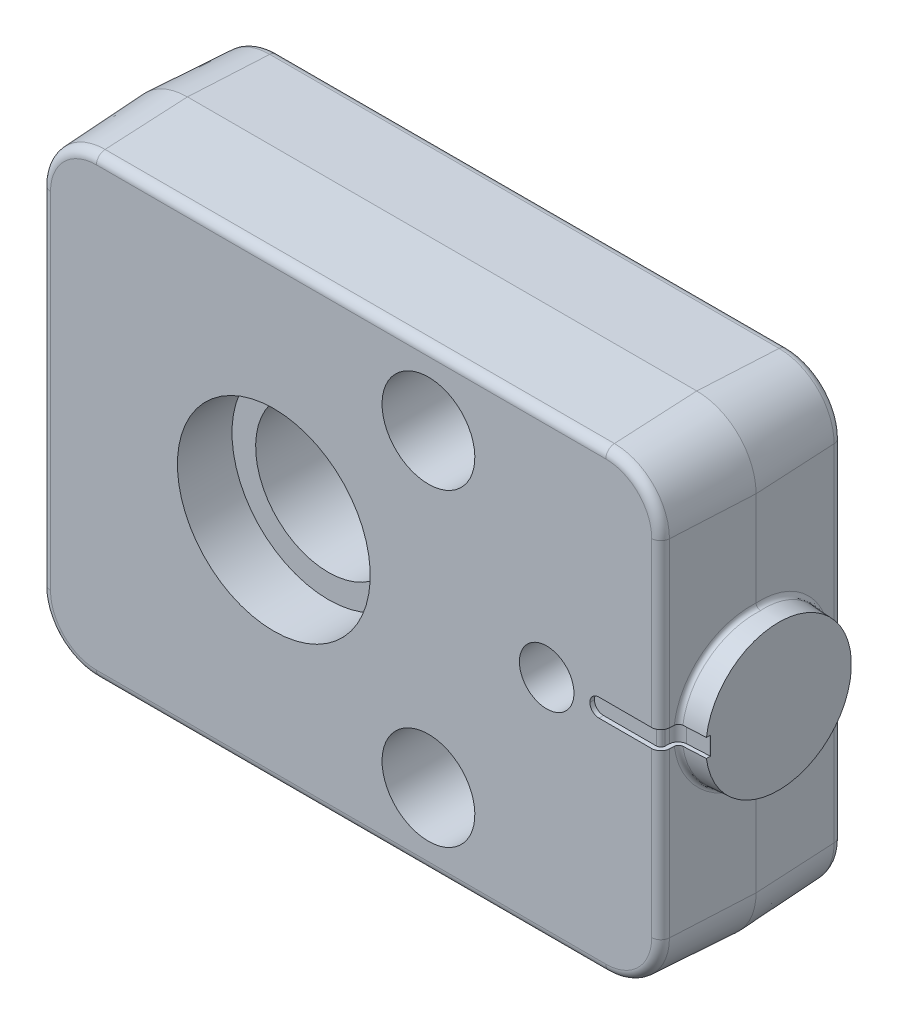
ISO-10303-21;
HEADER;
FILE_DESCRIPTION(('STEP AP214'),'2;1');
FILE_NAME('part.step','',(''),(''),'','','');
FILE_SCHEMA(('AUTOMOTIVE_DESIGN { 1 0 10303 214 1 1 1 1 }'));
ENDSEC;
DATA;
#1=APPLICATION_CONTEXT('core data for automotive mechanical design processes');
#2=APPLICATION_PROTOCOL_DEFINITION('international standard','automotive_design',2000,#1);
#3=PRODUCT_CONTEXT('',#1,'mechanical');
#4=PRODUCT('Part','Part','',(#3));
#5=PRODUCT_RELATED_PRODUCT_CATEGORY('part','',(#4));
#6=PRODUCT_DEFINITION_FORMATION('','',#4);
#7=PRODUCT_DEFINITION_CONTEXT('part definition',#1,'design');
#8=PRODUCT_DEFINITION('design','',#6,#7);
#9=PRODUCT_DEFINITION_SHAPE('','',#8);
#10=(LENGTH_UNIT() NAMED_UNIT(*) SI_UNIT(.MILLI.,.METRE.));
#11=(NAMED_UNIT(*) PLANE_ANGLE_UNIT() SI_UNIT($,.RADIAN.));
#12=(NAMED_UNIT(*) SI_UNIT($,.STERADIAN.) SOLID_ANGLE_UNIT());
#13=UNCERTAINTY_MEASURE_WITH_UNIT(LENGTH_MEASURE(1.E-05),#10,'distance_accuracy_value','');
#14=(GEOMETRIC_REPRESENTATION_CONTEXT(3) GLOBAL_UNCERTAINTY_ASSIGNED_CONTEXT((#13)) GLOBAL_UNIT_ASSIGNED_CONTEXT((#10,
#11,#12)) REPRESENTATION_CONTEXT('',''));
#15=CARTESIAN_POINT('',(0.,0.,0.));
#16=DIRECTION('',(0.,0.,1.));
#17=DIRECTION('',(1.,0.,0.));
#18=AXIS2_PLACEMENT_3D('',#15,#16,#17);
#19=CARTESIAN_POINT('',(-25.5,-25.,0.));
#20=DIRECTION('',(0.,0.,-1.));
#21=DIRECTION('',(0.,1.,0.));
#22=AXIS2_PLACEMENT_3D('',#19,#20,#21);
#23=PLANE('',#22);
#24=DIRECTION('',(1.,0.,0.));
#25=VECTOR('',#24,1.);
#26=CARTESIAN_POINT('',(-25.5,-24.0510354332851,0.));
#27=LINE('',#26,#25);
#28=CARTESIAN_POINT('',(36.5,-24.0510354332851,0.));
#29=VERTEX_POINT('',#28);
#30=CARTESIAN_POINT('',(-19.5,-24.0510354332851,0.));
#31=VERTEX_POINT('',#30);
#32=EDGE_CURVE('E271',#29,#31,#27,.F.);
#33=ORIENTED_EDGE('',*,*,#32,.T.);
#34=CARTESIAN_POINT('',(-19.5,-19.,0.));
#35=DIRECTION('',(0.,0.,-1.));
#36=DIRECTION('',(0.,1.,0.));
#37=AXIS2_PLACEMENT_3D('',#34,#35,#36);
#38=CIRCLE('',#37,5.05103543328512);
#39=CARTESIAN_POINT('',(-24.5510354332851,-19.,0.));
#40=VERTEX_POINT('',#39);
#41=EDGE_CURVE('E334',#31,#40,#38,.T.);
#42=ORIENTED_EDGE('',*,*,#41,.T.);
#43=DIRECTION('',(0.,-1.,0.));
#44=VECTOR('',#43,1.);
#45=CARTESIAN_POINT('',(-24.5510354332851,-25.,0.));
#46=LINE('',#45,#44);
#47=CARTESIAN_POINT('',(-24.5510354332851,19.,0.));
#48=VERTEX_POINT('',#47);
#49=EDGE_CURVE('E332',#40,#48,#46,.F.);
#50=ORIENTED_EDGE('',*,*,#49,.T.);
#51=CARTESIAN_POINT('',(-19.5,19.,0.));
#52=DIRECTION('',(0.,0.,-1.));
#53=DIRECTION('',(0.,1.,0.));
#54=AXIS2_PLACEMENT_3D('',#51,#52,#53);
#55=CIRCLE('',#54,5.05103543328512);
#56=CARTESIAN_POINT('',(-19.5,24.0510354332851,0.));
#57=VERTEX_POINT('',#56);
#58=EDGE_CURVE('E330',#48,#57,#55,.T.);
#59=ORIENTED_EDGE('',*,*,#58,.T.);
#60=DIRECTION('',(-1.,0.,0.));
#61=VECTOR('',#60,1.);
#62=CARTESIAN_POINT('',(-25.5,24.0510354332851,0.));
#63=LINE('',#62,#61);
#64=CARTESIAN_POINT('',(36.5,24.0510354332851,0.));
#65=VERTEX_POINT('',#64);
#66=EDGE_CURVE('E328',#57,#65,#63,.F.);
#67=ORIENTED_EDGE('',*,*,#66,.T.);
#68=CARTESIAN_POINT('',(36.5,19.,0.));
#69=DIRECTION('',(0.,0.,-1.));
#70=DIRECTION('',(0.,1.,0.));
#71=AXIS2_PLACEMENT_3D('',#68,#69,#70);
#72=CIRCLE('',#71,5.05103543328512);
#73=CARTESIAN_POINT('',(41.5510354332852,19.,0.));
#74=VERTEX_POINT('',#73);
#75=EDGE_CURVE('E326',#65,#74,#72,.T.);
#76=ORIENTED_EDGE('',*,*,#75,.T.);
#77=DIRECTION('',(0.,1.,0.));
#78=VECTOR('',#77,1.);
#79=CARTESIAN_POINT('',(41.5510354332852,-25.,0.));
#80=LINE('',#79,#78);
#81=CARTESIAN_POINT('',(41.5510354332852,-19.,0.));
#82=VERTEX_POINT('',#81);
#83=EDGE_CURVE('E324',#74,#82,#80,.F.);
#84=ORIENTED_EDGE('',*,*,#83,.T.);
#85=CARTESIAN_POINT('',(36.5,-19.,0.));
#86=DIRECTION('',(0.,0.,-1.));
#87=DIRECTION('',(0.,1.,0.));
#88=AXIS2_PLACEMENT_3D('',#85,#86,#87);
#89=CIRCLE('',#88,5.05103543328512);
#90=EDGE_CURVE('E322',#82,#29,#89,.T.);
#91=ORIENTED_EDGE('',*,*,#90,.T.);
#92=EDGE_LOOP('',(#33,#42,#50,#59,#67,#76,#84,#91));
#93=FACE_BOUND('',#92,.T.);
#94=CARTESIAN_POINT('',(17.,-17.,0.));
#95=DIRECTION('',(0.,0.,1.));
#96=DIRECTION('',(0.,-1.,0.));
#97=AXIS2_PLACEMENT_3D('',#94,#95,#96);
#98=CIRCLE('',#97,2.8);
#99=CARTESIAN_POINT('',(17.,-19.8,0.));
#100=VERTEX_POINT('',#99);
#101=EDGE_CURVE('E356',#100,#100,#98,.T.);
#102=ORIENTED_EDGE('',*,*,#101,.T.);
#103=EDGE_LOOP('',(#102));
#104=FACE_BOUND('',#103,.T.);
#105=CARTESIAN_POINT('',(17.,17.,0.));
#106=DIRECTION('',(0.,0.,1.));
#107=DIRECTION('',(0.,-1.,0.));
#108=AXIS2_PLACEMENT_3D('',#105,#106,#107);
#109=CIRCLE('',#108,2.8);
#110=CARTESIAN_POINT('',(17.,14.2,0.));
#111=VERTEX_POINT('',#110);
#112=EDGE_CURVE('E1329',#111,#111,#109,.T.);
#113=ORIENTED_EDGE('',*,*,#112,.T.);
#114=EDGE_LOOP('',(#113));
#115=FACE_BOUND('',#114,.T.);
#116=CARTESIAN_POINT('',(0.,0.,0.));
#117=DIRECTION('',(0.,0.,1.));
#118=DIRECTION('',(0.,-1.,0.));
#119=AXIS2_PLACEMENT_3D('',#116,#117,#118);
#120=CIRCLE('',#119,10.6);
#121=CARTESIAN_POINT('',(0.,-10.6,0.));
#122=VERTEX_POINT('',#121);
#123=EDGE_CURVE('E1306',#122,#122,#120,.T.);
#124=ORIENTED_EDGE('',*,*,#123,.T.);
#125=EDGE_LOOP('',(#124));
#126=FACE_BOUND('',#125,.T.);
#127=ADVANCED_FACE('F16',(#93,#104,#115,#126),#23,.T.);
#128=CARTESIAN_POINT('',(42.5,25.,20.));
#129=DIRECTION('',(0.998629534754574,0.,0.052335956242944));
#130=DIRECTION('',(-0.052335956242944,0.,0.998629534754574));
#131=AXIS2_PLACEMENT_3D('',#128,#129,#130);
#132=PLANE('',#131);
#133=DIRECTION('',(-0.052335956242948,0.,0.998629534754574));
#134=VECTOR('',#133,1.);
#135=CARTESIAN_POINT('',(42.5496649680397,1.,19.0523359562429));
#136=LINE('',#135,#134);
#137=CARTESIAN_POINT('',(42.5763358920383,1.,18.5434244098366));
#138=VERTEX_POINT('',#137);
#139=CARTESIAN_POINT('',(42.5496649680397,1.,19.0523359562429));
#140=VERTEX_POINT('',#139);
#141=EDGE_CURVE('E452',#138,#140,#136,.T.);
#142=ORIENTED_EDGE('',*,*,#141,.F.);
#143=CARTESIAN_POINT('',(43.0242106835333,0.,9.99746429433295));
#144=DIRECTION('',(0.998629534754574,0.,0.052335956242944));
#145=DIRECTION('',(-0.0523359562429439,0.,0.998629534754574));
#146=AXIS2_PLACEMENT_3D('',#143,#144,#145);
#147=ELLIPSE('',#146,8.61607684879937,8.60423636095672);
#148=CARTESIAN_POINT('',(43.0240777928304,8.60423598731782,10.));
#149=VERTEX_POINT('',#148);
#150=EDGE_CURVE('E605',#138,#149,#147,.F.);
#151=ORIENTED_EDGE('',*,*,#150,.T.);
#152=DIRECTION('',(0.,1.,0.));
#153=VECTOR('',#152,1.);
#154=CARTESIAN_POINT('',(43.0240777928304,25.,10.));
#155=LINE('',#154,#153);
#156=CARTESIAN_POINT('',(43.0240777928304,19.,10.));
#157=VERTEX_POINT('',#156);
#158=EDGE_CURVE('E258',#149,#157,#155,.T.);
#159=ORIENTED_EDGE('',*,*,#158,.T.);
#160=DIRECTION('',(0.0523359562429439,0.,-0.998629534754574));
#161=VECTOR('',#160,1.);
#162=CARTESIAN_POINT('',(42.5,19.,20.));
#163=LINE('',#162,#161);
#164=CARTESIAN_POINT('',(42.5496649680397,19.,19.0523359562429));
#165=VERTEX_POINT('',#164);
#166=EDGE_CURVE('E281',#157,#165,#163,.F.);
#167=ORIENTED_EDGE('',*,*,#166,.T.);
#168=DIRECTION('',(0.,1.,0.));
#169=VECTOR('',#168,1.);
#170=CARTESIAN_POINT('',(42.5496649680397,25.,19.0523359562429));
#171=LINE('',#170,#169);
#172=EDGE_CURVE('E642',#165,#140,#171,.F.);
#173=ORIENTED_EDGE('',*,*,#172,.T.);
#174=EDGE_LOOP('',(#142,#151,#159,#167,#173));
#175=FACE_BOUND('',#174,.T.);
#176=ADVANCED_FACE('F546',(#175),#132,.T.);
#177=CARTESIAN_POINT('',(-25.5,-25.,20.));
#178=DIRECTION('',(0.,0.,-1.));
#179=DIRECTION('',(0.,1.,0.));
#180=AXIS2_PLACEMENT_3D('',#177,#178,#179);
#181=PLANE('',#180);
#182=CARTESIAN_POINT('',(30.,0.,20.));
#183=DIRECTION('',(0.,0.,1.));
#184=DIRECTION('',(0.,-1.,0.));
#185=AXIS2_PLACEMENT_3D('',#182,#183,#184);
#186=CIRCLE('',#185,3.);
#187=CARTESIAN_POINT('',(30.,-3.,20.));
#188=VERTEX_POINT('',#187);
#189=EDGE_CURVE('E1301',#188,#188,#186,.T.);
#190=ORIENTED_EDGE('',*,*,#189,.F.);
#191=EDGE_LOOP('',(#190));
#192=FACE_BOUND('',#191,.T.);
#193=CARTESIAN_POINT('',(0.,0.,20.));
#194=DIRECTION('',(0.,0.,1.));
#195=DIRECTION('',(0.,-1.,0.));
#196=AXIS2_PLACEMENT_3D('',#193,#194,#195);
#197=CIRCLE('',#196,10.6);
#198=CARTESIAN_POINT('',(0.,-10.6,20.));
#199=VERTEX_POINT('',#198);
#200=EDGE_CURVE('E1312',#199,#199,#197,.T.);
#201=ORIENTED_EDGE('',*,*,#200,.F.);
#202=EDGE_LOOP('',(#201));
#203=FACE_BOUND('',#202,.T.);
#204=CARTESIAN_POINT('',(17.,17.,20.));
#205=DIRECTION('',(0.,0.,1.));
#206=DIRECTION('',(0.,-1.,0.));
#207=AXIS2_PLACEMENT_3D('',#204,#205,#206);
#208=CIRCLE('',#207,5.1);
#209=CARTESIAN_POINT('',(17.,11.9,20.));
#210=VERTEX_POINT('',#209);
#211=EDGE_CURVE('E1318',#210,#210,#208,.T.);
#212=ORIENTED_EDGE('',*,*,#211,.F.);
#213=EDGE_LOOP('',(#212));
#214=FACE_BOUND('',#213,.T.);
#215=CARTESIAN_POINT('',(17.,-17.,20.));
#216=DIRECTION('',(0.,0.,1.));
#217=DIRECTION('',(0.,-1.,0.));
#218=AXIS2_PLACEMENT_3D('',#215,#216,#217);
#219=CIRCLE('',#218,5.1);
#220=CARTESIAN_POINT('',(17.,-22.1,20.));
#221=VERTEX_POINT('',#220);
#222=EDGE_CURVE('E1332',#221,#221,#219,.T.);
#223=ORIENTED_EDGE('',*,*,#222,.F.);
#224=EDGE_LOOP('',(#223));
#225=FACE_BOUND('',#224,.T.);
#226=DIRECTION('',(-1.,0.,0.));
#227=VECTOR('',#226,1.);
#228=CARTESIAN_POINT('',(41.5510354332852,1.,20.));
#229=LINE('',#228,#227);
#230=CARTESIAN_POINT('',(41.5510354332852,1.,20.));
#231=VERTEX_POINT('',#230);
#232=CARTESIAN_POINT('',(35.75,1.,20.));
#233=VERTEX_POINT('',#232);
#234=EDGE_CURVE('E435',#231,#233,#229,.T.);
#235=ORIENTED_EDGE('',*,*,#234,.F.);
#236=DIRECTION('',(0.,-1.,0.));
#237=VECTOR('',#236,1.);
#238=CARTESIAN_POINT('',(41.5510354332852,-25.,20.));
#239=LINE('',#238,#237);
#240=CARTESIAN_POINT('',(41.5510354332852,19.,20.));
#241=VERTEX_POINT('',#240);
#242=EDGE_CURVE('E670',#231,#241,#239,.F.);
#243=ORIENTED_EDGE('',*,*,#242,.T.);
#244=CARTESIAN_POINT('',(36.5,19.,20.));
#245=DIRECTION('',(0.,0.,-1.));
#246=DIRECTION('',(0.,1.,0.));
#247=AXIS2_PLACEMENT_3D('',#244,#245,#246);
#248=CIRCLE('',#247,5.05103543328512);
#249=CARTESIAN_POINT('',(36.5,24.0510354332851,20.));
#250=VERTEX_POINT('',#249);
#251=EDGE_CURVE('E665',#241,#250,#248,.F.);
#252=ORIENTED_EDGE('',*,*,#251,.T.);
#253=DIRECTION('',(1.,0.,0.));
#254=VECTOR('',#253,1.);
#255=CARTESIAN_POINT('',(-25.5,24.0510354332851,20.));
#256=LINE('',#255,#254);
#257=CARTESIAN_POINT('',(-19.5,24.0510354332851,20.));
#258=VERTEX_POINT('',#257);
#259=EDGE_CURVE('E663',#250,#258,#256,.F.);
#260=ORIENTED_EDGE('',*,*,#259,.T.);
#261=CARTESIAN_POINT('',(-19.5,19.,20.));
#262=DIRECTION('',(0.,0.,-1.));
#263=DIRECTION('',(0.,1.,0.));
#264=AXIS2_PLACEMENT_3D('',#261,#262,#263);
#265=CIRCLE('',#264,5.05103543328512);
#266=CARTESIAN_POINT('',(-24.5510354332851,19.,20.));
#267=VERTEX_POINT('',#266);
#268=EDGE_CURVE('E661',#258,#267,#265,.F.);
#269=ORIENTED_EDGE('',*,*,#268,.T.);
#270=DIRECTION('',(0.,1.,0.));
#271=VECTOR('',#270,1.);
#272=CARTESIAN_POINT('',(-24.5510354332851,-25.,20.));
#273=LINE('',#272,#271);
#274=CARTESIAN_POINT('',(-24.5510354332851,-19.,20.));
#275=VERTEX_POINT('',#274);
#276=EDGE_CURVE('E659',#267,#275,#273,.F.);
#277=ORIENTED_EDGE('',*,*,#276,.T.);
#278=CARTESIAN_POINT('',(-19.5,-19.,20.));
#279=DIRECTION('',(0.,0.,-1.));
#280=DIRECTION('',(0.,1.,0.));
#281=AXIS2_PLACEMENT_3D('',#278,#279,#280);
#282=CIRCLE('',#281,5.05103543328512);
#283=CARTESIAN_POINT('',(-19.5,-24.0510354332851,20.));
#284=VERTEX_POINT('',#283);
#285=EDGE_CURVE('E656',#275,#284,#282,.F.);
#286=ORIENTED_EDGE('',*,*,#285,.T.);
#287=DIRECTION('',(-1.,0.,0.));
#288=VECTOR('',#287,1.);
#289=CARTESIAN_POINT('',(-25.5,-24.0510354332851,20.));
#290=LINE('',#289,#288);
#291=CARTESIAN_POINT('',(36.5,-24.0510354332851,20.));
#292=VERTEX_POINT('',#291);
#293=EDGE_CURVE('E673',#284,#292,#290,.F.);
#294=ORIENTED_EDGE('',*,*,#293,.T.);
#295=CARTESIAN_POINT('',(36.5,-19.,20.));
#296=DIRECTION('',(0.,0.,-1.));
#297=DIRECTION('',(0.,1.,0.));
#298=AXIS2_PLACEMENT_3D('',#295,#296,#297);
#299=CIRCLE('',#298,5.05103543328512);
#300=CARTESIAN_POINT('',(41.5510354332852,-19.,20.));
#301=VERTEX_POINT('',#300);
#302=EDGE_CURVE('E671',#292,#301,#299,.F.);
#303=ORIENTED_EDGE('',*,*,#302,.T.);
#304=CARTESIAN_POINT('',(41.5510354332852,-1.,20.));
#305=VERTEX_POINT('',#304);
#306=EDGE_CURVE('E667',#301,#305,#239,.F.);
#307=ORIENTED_EDGE('',*,*,#306,.T.);
#308=DIRECTION('',(-1.,0.,0.));
#309=VECTOR('',#308,1.);
#310=CARTESIAN_POINT('',(41.5510354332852,-1.,20.));
#311=LINE('',#310,#309);
#312=CARTESIAN_POINT('',(35.75,-1.,20.));
#313=VERTEX_POINT('',#312);
#314=EDGE_CURVE('E458',#305,#313,#311,.T.);
#315=ORIENTED_EDGE('',*,*,#314,.T.);
#316=CARTESIAN_POINT('',(35.75,0.,20.));
#317=DIRECTION('',(0.,0.,-1.));
#318=DIRECTION('',(0.,1.,0.));
#319=AXIS2_PLACEMENT_3D('',#316,#317,#318);
#320=CIRCLE('',#319,1.);
#321=CARTESIAN_POINT('',(34.75,0.,20.));
#322=VERTEX_POINT('',#321);
#323=EDGE_CURVE('E25',#313,#322,#320,.T.);
#324=ORIENTED_EDGE('',*,*,#323,.T.);
#325=CARTESIAN_POINT('',(35.75,0.,20.));
#326=DIRECTION('',(0.,0.,-1.));
#327=DIRECTION('',(0.,1.,0.));
#328=AXIS2_PLACEMENT_3D('',#325,#326,#327);
#329=CIRCLE('',#328,1.);
#330=EDGE_CURVE('E10',#322,#233,#329,.T.);
#331=ORIENTED_EDGE('',*,*,#330,.T.);
#332=EDGE_LOOP('',(#235,#243,#252,#260,#269,#277,#286,#294,#303,#307,#315,#324,#331));
#333=FACE_BOUND('',#332,.T.);
#334=ADVANCED_FACE('F573',(#192,#203,#214,#225,#333),#181,.F.);
#335=CARTESIAN_POINT('',(41.5510354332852,-25.,19.));
#336=DIRECTION('',(0.,-1.,0.));
#337=DIRECTION('',(0.,0.,-1.));
#338=AXIS2_PLACEMENT_3D('',#335,#336,#337);
#339=CYLINDRICAL_SURFACE('',#338,1.);
#340=ORIENTED_EDGE('',*,*,#242,.F.);
#341=CARTESIAN_POINT('',(41.5510354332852,1.,19.));
#342=DIRECTION('',(0.,-1.,0.));
#343=DIRECTION('',(0.,0.,-1.));
#344=AXIS2_PLACEMENT_3D('',#341,#342,#343);
#345=CIRCLE('',#344,1.);
#346=EDGE_CURVE('E433',#140,#231,#345,.T.);
#347=ORIENTED_EDGE('',*,*,#346,.F.);
#348=ORIENTED_EDGE('',*,*,#172,.F.);
#349=CARTESIAN_POINT('',(41.5510354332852,19.,19.));
#350=DIRECTION('',(0.,-1.,0.));
#351=DIRECTION('',(0.,0.,-1.));
#352=AXIS2_PLACEMENT_3D('',#349,#350,#351);
#353=CIRCLE('',#352,1.);
#354=EDGE_CURVE('E619',#165,#241,#353,.T.);
#355=ORIENTED_EDGE('',*,*,#354,.T.);
#356=EDGE_LOOP('',(#340,#347,#348,#355));
#357=FACE_BOUND('',#356,.T.);
#358=ADVANCED_FACE('F774',(#357),#339,.T.);
#359=CARTESIAN_POINT('',(43.0464268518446,0.,18.1285863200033));
#360=CARTESIAN_POINT('',(42.5968418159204,0.,18.152148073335));
#361=CARTESIAN_POINT('',(42.5732800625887,0.,18.6017331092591));
#362=CARTESIAN_POINT('',(43.0464268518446,-0.353705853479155,18.1285863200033));
#363=CARTESIAN_POINT('',(42.5968418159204,-0.355761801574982,18.152148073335));
#364=CARTESIAN_POINT('',(42.5732800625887,-0.37543294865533,18.6017331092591));
#365=CARTESIAN_POINT('',(43.0477164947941,-0.707411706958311,18.1053986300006));
#366=CARTESIAN_POINT('',(42.5980677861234,-0.711571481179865,18.128755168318));
#367=CARTESIAN_POINT('',(42.5745697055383,-0.750865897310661,18.577125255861));
#368=CARTESIAN_POINT('',(43.0528528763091,-1.40876818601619,18.0130472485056));
#369=CARTESIAN_POINT('',(42.6029489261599,-1.41695771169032,18.0356174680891));
#370=CARTESIAN_POINT('',(42.5797060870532,-1.49530783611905,18.4791172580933));
#371=CARTESIAN_POINT('',(43.0566997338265,-1.75641852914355,17.9438814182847));
#372=CARTESIAN_POINT('',(42.6066055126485,-1.76662652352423,17.965845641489));
#373=CARTESIAN_POINT('',(42.5835529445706,-1.86431652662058,18.4057148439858));
#374=CARTESIAN_POINT('',(43.0668846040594,-2.43971316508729,17.7607605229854));
#375=CARTESIAN_POINT('',(42.6162829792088,-2.45370866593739,17.7811885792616));
#376=CARTESIAN_POINT('',(42.5937378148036,-2.58959653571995,18.2113759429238));
#377=CARTESIAN_POINT('',(43.0732228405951,-2.77535637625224,17.6468014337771));
#378=CARTESIAN_POINT('',(42.6223065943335,-2.79120402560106,17.6662511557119));
#379=CARTESIAN_POINT('',(42.6000760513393,-2.94586670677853,18.0904351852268));
#380=CARTESIAN_POINT('',(43.088281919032,-3.428892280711,17.3760475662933));
#381=CARTESIAN_POINT('',(42.6366122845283,-3.44813745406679,17.3932823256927));
#382=CARTESIAN_POINT('',(42.6151351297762,-3.63957476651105,17.8030908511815));
#383=CARTESIAN_POINT('',(43.0970030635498,-3.74678271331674,17.2192473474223));
#384=CARTESIAN_POINT('',(42.6448982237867,-3.76764132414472,17.2351771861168));
#385=CARTESIAN_POINT('',(42.623856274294,-3.97701025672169,17.6366815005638));
#386=CARTESIAN_POINT('',(43.116678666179,-4.35937325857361,16.8654978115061));
#387=CARTESIAN_POINT('',(42.6635837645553,-4.38311160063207,16.8786358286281));
#388=CARTESIAN_POINT('',(42.6435318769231,-4.62727668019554,17.2612486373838));
#389=CARTESIAN_POINT('',(43.1276334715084,-4.6540697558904,16.6685422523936));
#390=CARTESIAN_POINT('',(42.6739880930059,-4.67912275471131,16.6801094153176));
#391=CARTESIAN_POINT('',(42.6544866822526,-4.94010377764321,17.052218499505));
#392=CARTESIAN_POINT('',(43.1515889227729,-5.21523029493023,16.2378554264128));
#393=CARTESIAN_POINT('',(42.6967292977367,-5.24254391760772,16.2461813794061));
#394=CARTESIAN_POINT('',(42.678442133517,-5.53580232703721,16.5951212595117));
#395=CARTESIAN_POINT('',(43.1645899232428,-5.48168943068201,16.0041177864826));
#396=CARTESIAN_POINT('',(42.7090714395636,-5.50997430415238,16.0106792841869));
#397=CARTESIAN_POINT('',(42.6914431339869,-5.81866857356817,16.3470473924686));
#398=CARTESIAN_POINT('',(43.1924153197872,-5.98181690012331,15.5038690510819));
#399=CARTESIAN_POINT('',(42.7354741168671,-6.01167368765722,15.5068861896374));
#400=CARTESIAN_POINT('',(42.7192685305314,-6.34960683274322,15.8161071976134));
#401=CARTESIAN_POINT('',(43.2072400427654,-6.21547933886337,15.2373520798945));
#402=CARTESIAN_POINT('',(42.7495400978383,-6.24593711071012,15.2384912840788));
#403=CARTESIAN_POINT('',(42.7340932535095,-6.59767259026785,15.5332346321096));
#404=CARTESIAN_POINT('',(43.238459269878,-6.64601665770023,14.6761071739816));
#405=CARTESIAN_POINT('',(42.7791471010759,-6.67732329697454,14.6735560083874));
#406=CARTESIAN_POINT('',(42.7653124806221,-7.05476633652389,14.9375362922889));
#407=CARTESIAN_POINT('',(43.2548540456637,-6.8428851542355,14.3813743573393));
#408=CARTESIAN_POINT('',(42.7946933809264,-6.87441478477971,14.3769153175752));
#409=CARTESIAN_POINT('',(42.7817072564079,-7.26378755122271,14.6247053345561));
#410=CARTESIAN_POINT('',(43.2889329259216,-7.19646760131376,13.7687423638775));
#411=CARTESIAN_POINT('',(42.8269927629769,-7.22812562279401,13.76060639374));
#412=CARTESIAN_POINT('',(42.8157861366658,-7.63921614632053,13.9744415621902));
#413=CARTESIAN_POINT('',(43.3066172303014,-7.35317530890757,13.4508395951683));
#414=CARTESIAN_POINT('',(42.8437505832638,-7.38469004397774,13.4408481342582));
#415=CARTESIAN_POINT('',(42.8334704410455,-7.80561690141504,13.637004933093));
#416=CARTESIAN_POINT('',(43.3429726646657,-7.62375638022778,12.7973081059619));
#417=CARTESIAN_POINT('',(42.8781846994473,-7.65471806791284,12.7838060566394));
#418=CARTESIAN_POINT('',(42.8698258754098,-8.09295704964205,12.9433019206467));
#419=CARTESIAN_POINT('',(43.3616439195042,-7.73762430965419,12.4616771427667));
#420=CARTESIAN_POINT('',(42.8958648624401,-7.76810677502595,12.4464484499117));
#421=CARTESIAN_POINT('',(42.8884971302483,-8.21389067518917,12.5870331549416));
#422=CARTESIAN_POINT('',(43.399653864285,-7.92057891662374,11.7784324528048));
#423=CARTESIAN_POINT('',(42.9318402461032,-7.94989981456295,11.7599972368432));
#424=CARTESIAN_POINT('',(42.9265070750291,-8.40822626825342,11.8617602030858));
#425=CARTESIAN_POINT('',(43.4189926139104,-7.98966157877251,11.4308176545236));
#426=CARTESIAN_POINT('',(42.9501382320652,-8.01821434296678,11.4108508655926));
#427=CARTESIAN_POINT('',(42.9458458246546,-8.4816239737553,11.4927548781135));
#428=CARTESIAN_POINT('',(43.4580067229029,-8.08186484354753,10.729553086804));
#429=CARTESIAN_POINT('',(42.9870360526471,-8.10874963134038,10.7067985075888));
#430=CARTESIAN_POINT('',(42.984859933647,-8.57963015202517,10.7483213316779));
#431=CARTESIAN_POINT('',(43.477682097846,-8.10498331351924,10.3759030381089));
#432=CARTESIAN_POINT('',(43.0056373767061,-8.13087175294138,10.3518641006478));
#433=CARTESIAN_POINT('',(43.0045353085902,-8.60423636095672,10.3728928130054));
#434=CARTESIAN_POINT('',(43.5170328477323,-8.10486364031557,9.66861869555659));
#435=CARTESIAN_POINT('',(43.042824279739,-8.12870239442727,9.64229572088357));
#436=CARTESIAN_POINT('',(43.0438860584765,-8.60423636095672,9.62203577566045));
#437=CARTESIAN_POINT('',(43.5367082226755,-8.08162549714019,9.31498440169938));
#438=CARTESIAN_POINT('',(43.0614099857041,-8.10431011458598,9.2876593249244));
#439=CARTESIAN_POINT('',(43.0635614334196,-8.57963015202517,9.24660725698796));
#440=CARTESIAN_POINT('',(43.575722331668,-7.98919104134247,8.61378178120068));
#441=CARTESIAN_POINT('',(43.0982491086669,-8.00958335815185,8.58472698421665));
#442=CARTESIAN_POINT('',(43.1025755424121,-8.4816239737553,8.50217371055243));
#443=CARTESIAN_POINT('',(43.5950610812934,-7.91999686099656,8.26621317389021));
#444=CARTESIAN_POINT('',(43.1165012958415,-7.93915274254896,8.23645450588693));
#445=CARTESIAN_POINT('',(43.1219142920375,-8.40822626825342,8.13316838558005));
#446=CARTESIAN_POINT('',(43.6330710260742,-7.73683497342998,7.58308815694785));
#447=CARTESIAN_POINT('',(43.152363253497,-7.7536001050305,7.55216758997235));
#448=CARTESIAN_POINT('',(43.1599242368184,-8.21389067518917,7.40789543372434));
#449=CARTESIAN_POINT('',(43.6517422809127,-7.62287128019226,7.24753067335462));
#450=CARTESIAN_POINT('',(43.1699705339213,-7.63839312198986,7.21620066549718));
#451=CARTESIAN_POINT('',(43.1785954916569,-8.09295704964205,7.0516266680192));
#452=CARTESIAN_POINT('',(43.688097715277,-7.35212096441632,6.59416842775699));
#453=CARTESIAN_POINT('',(43.2042441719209,-7.36529299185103,6.56222069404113));
#454=CARTESIAN_POINT('',(43.2149509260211,-7.80561690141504,6.35792365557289));
#455=CARTESIAN_POINT('',(43.7057820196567,-7.19533977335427,6.27636142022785));
#456=CARTESIAN_POINT('',(43.2209069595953,-7.2073318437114,6.24427576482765));
#457=CARTESIAN_POINT('',(43.2326352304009,-7.63921614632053,6.02048702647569));
#458=CARTESIAN_POINT('',(43.7398608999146,-6.84163765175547,5.66393670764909));
#459=CARTESIAN_POINT('',(43.2530096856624,-6.85144575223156,5.63171926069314));
#460=CARTESIAN_POINT('',(43.2667141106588,-7.26378755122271,5.37022325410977));
#461=CARTESIAN_POINT('',(43.7562556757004,-6.64472295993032,5.36931540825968));
#462=CARTESIAN_POINT('',(43.2684452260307,-6.65347443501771,5.3371916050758));
#463=CARTESIAN_POINT('',(43.2831088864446,-7.05476633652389,5.05739229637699));
#464=CARTESIAN_POINT('',(43.787474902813,-6.21412369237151,4.80830169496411));
#465=CARTESIAN_POINT('',(43.2978327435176,-6.22095868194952,4.77644436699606));
#466=CARTESIAN_POINT('',(43.3143281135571,-6.59767259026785,4.46169395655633));
#467=CARTESIAN_POINT('',(43.8022996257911,-5.98044549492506,4.54190439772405));
#468=CARTESIAN_POINT('',(43.311779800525,-5.98639274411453,4.51031866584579));
#469=CARTESIAN_POINT('',(43.3291528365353,-6.34960683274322,4.1788213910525));
#470=CARTESIAN_POINT('',(43.8301250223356,-5.48031802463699,4.04189501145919));
#471=CARTESIAN_POINT('',(43.3379550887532,-5.48468748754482,4.01086441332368));
#472=CARTESIAN_POINT('',(43.3569782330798,-5.81866857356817,3.64788119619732));
#473=CARTESIAN_POINT('',(43.8431260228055,-5.21387464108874,3.80827704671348));
#474=CARTESIAN_POINT('',(43.3501782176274,-5.21755314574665,3.77763322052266));
#475=CARTESIAN_POINT('',(43.3699792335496,-5.53580232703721,3.39980732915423));
#476=CARTESIAN_POINT('',(43.8670814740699,-4.65277604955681,3.37782141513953));
#477=CARTESIAN_POINT('',(43.3726996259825,-4.65525139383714,3.34789914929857));
#478=CARTESIAN_POINT('',(43.3939346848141,-4.94010377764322,2.94271008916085));
#479=CARTESIAN_POINT('',(43.8780362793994,-4.35812574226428,3.18097737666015));
#480=CARTESIAN_POINT('',(43.3829929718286,-4.36011529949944,3.15149041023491));
#481=CARTESIAN_POINT('',(43.4048894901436,-4.62727668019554,2.73367995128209));
#482=CARTESIAN_POINT('',(43.8977118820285,-3.74565487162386,2.82743512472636));
#483=CARTESIAN_POINT('',(43.4014813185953,-3.74681446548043,2.79871173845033));
#484=CARTESIAN_POINT('',(43.4245650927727,-3.97701025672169,2.35824708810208));
#485=CARTESIAN_POINT('',(43.9064330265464,-3.42783791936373,2.67073067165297));
#486=CARTESIAN_POINT('',(43.4096718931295,-3.42870549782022,2.64242626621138));
#487=CARTESIAN_POINT('',(43.4332862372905,-3.63957476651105,2.19183773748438));
#488=CARTESIAN_POINT('',(43.9214921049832,-2.77447126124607,2.40014605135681));
#489=CARTESIAN_POINT('',(43.4238164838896,-2.77484429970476,2.37253139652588));
#490=CARTESIAN_POINT('',(43.4483453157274,-2.94586670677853,1.90449340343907));
#491=CARTESIAN_POINT('',(43.9278303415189,-2.43892381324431,2.28626044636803));
#492=CARTESIAN_POINT('',(43.4297668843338,-2.43916879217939,2.25899099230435));
#493=CARTESIAN_POINT('',(43.4546835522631,-2.58959653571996,1.78355264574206));
#494=CARTESIAN_POINT('',(43.9380152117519,-1.75583646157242,2.10325922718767));
#495=CARTESIAN_POINT('',(43.4393303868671,-1.75585230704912,2.07650849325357));
#496=CARTESIAN_POINT('',(43.4648684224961,-1.86431652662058,1.58921374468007));
#497=CARTESIAN_POINT('',(43.9418620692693,-1.40829763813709,2.03413959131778));
#498=CARTESIAN_POINT('',(43.4429409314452,-1.40830410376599,2.00761519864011));
#499=CARTESIAN_POINT('',(43.4687152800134,-1.49530783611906,1.51581133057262));
#500=CARTESIAN_POINT('',(43.9469984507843,-0.707172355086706,1.94185015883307));
#501=CARTESIAN_POINT('',(43.4477630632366,-0.707119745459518,1.91560344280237));
#502=CARTESIAN_POINT('',(43.4738516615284,-0.750865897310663,1.41780333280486));
#503=CARTESIAN_POINT('',(43.9482880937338,-0.353586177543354,1.91867822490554));
#504=CARTESIAN_POINT('',(43.4489733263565,-0.353586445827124,1.89251024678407));
#505=CARTESIAN_POINT('',(43.475141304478,-0.375432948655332,1.39319547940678));
#506=CARTESIAN_POINT('',(43.9482880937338,0.353586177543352,1.91867822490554));
#507=CARTESIAN_POINT('',(43.4489733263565,0.353586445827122,1.89251024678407));
#508=CARTESIAN_POINT('',(43.475141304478,0.37543294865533,1.39319547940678));
#509=CARTESIAN_POINT('',(43.9469984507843,0.707172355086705,1.94185015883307));
#510=CARTESIAN_POINT('',(43.4477630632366,0.707119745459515,1.91560344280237));
#511=CARTESIAN_POINT('',(43.4738516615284,0.750865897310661,1.41780333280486));
#512=CARTESIAN_POINT('',(43.9418620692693,1.40829763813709,2.03413959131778));
#513=CARTESIAN_POINT('',(43.4429409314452,1.40830410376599,2.00761519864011));
#514=CARTESIAN_POINT('',(43.4687152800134,1.49530783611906,1.51581133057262));
#515=CARTESIAN_POINT('',(43.9380152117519,1.75583646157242,2.10325922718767));
#516=CARTESIAN_POINT('',(43.4393303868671,1.75585230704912,2.07650849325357));
#517=CARTESIAN_POINT('',(43.4648684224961,1.86431652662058,1.58921374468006));
#518=CARTESIAN_POINT('',(43.9278303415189,2.43892381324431,2.28626044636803));
#519=CARTESIAN_POINT('',(43.4297668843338,2.43916879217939,2.25899099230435));
#520=CARTESIAN_POINT('',(43.4546835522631,2.58959653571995,1.78355264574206));
#521=CARTESIAN_POINT('',(43.9214921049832,2.77447126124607,2.40014605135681));
#522=CARTESIAN_POINT('',(43.4238164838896,2.77484429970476,2.37253139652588));
#523=CARTESIAN_POINT('',(43.4483453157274,2.94586670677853,1.90449340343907));
#524=CARTESIAN_POINT('',(43.9064330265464,3.42783791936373,2.67073067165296));
#525=CARTESIAN_POINT('',(43.4096718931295,3.42870549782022,2.64242626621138));
#526=CARTESIAN_POINT('',(43.4332862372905,3.63957476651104,2.19183773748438));
#527=CARTESIAN_POINT('',(43.8977118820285,3.74565487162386,2.82743512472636));
#528=CARTESIAN_POINT('',(43.4014813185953,3.74681446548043,2.79871173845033));
#529=CARTESIAN_POINT('',(43.4245650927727,3.97701025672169,2.35824708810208));
#530=CARTESIAN_POINT('',(43.8780362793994,4.35812574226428,3.18097737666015));
#531=CARTESIAN_POINT('',(43.3829929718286,4.36011529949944,3.15149041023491));
#532=CARTESIAN_POINT('',(43.4048894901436,4.62727668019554,2.73367995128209));
#533=CARTESIAN_POINT('',(43.8670814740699,4.6527760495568,3.37782141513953));
#534=CARTESIAN_POINT('',(43.3726996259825,4.65525139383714,3.34789914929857));
#535=CARTESIAN_POINT('',(43.3939346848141,4.94010377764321,2.94271008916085));
#536=CARTESIAN_POINT('',(43.8431260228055,5.21387464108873,3.80827704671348));
#537=CARTESIAN_POINT('',(43.3501782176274,5.21755314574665,3.77763322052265));
#538=CARTESIAN_POINT('',(43.3699792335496,5.53580232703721,3.39980732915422));
#539=CARTESIAN_POINT('',(43.8301250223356,5.48031802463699,4.04189501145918));
#540=CARTESIAN_POINT('',(43.3379550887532,5.48468748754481,4.01086441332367));
#541=CARTESIAN_POINT('',(43.3569782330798,5.81866857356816,3.64788119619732));
#542=CARTESIAN_POINT('',(43.8022996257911,5.98044549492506,4.54190439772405));
#543=CARTESIAN_POINT('',(43.311779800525,5.98639274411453,4.51031866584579));
#544=CARTESIAN_POINT('',(43.3291528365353,6.34960683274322,4.1788213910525));
#545=CARTESIAN_POINT('',(43.787474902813,6.21412369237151,4.8083016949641));
#546=CARTESIAN_POINT('',(43.2978327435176,6.22095868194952,4.77644436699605));
#547=CARTESIAN_POINT('',(43.3143281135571,6.59767259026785,4.46169395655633));
#548=CARTESIAN_POINT('',(43.7562556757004,6.64472295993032,5.36931540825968));
#549=CARTESIAN_POINT('',(43.2684452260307,6.65347443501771,5.3371916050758));
#550=CARTESIAN_POINT('',(43.2831088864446,7.05476633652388,5.05739229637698));
#551=CARTESIAN_POINT('',(43.7398608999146,6.84163765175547,5.66393670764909));
#552=CARTESIAN_POINT('',(43.2530096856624,6.85144575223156,5.63171926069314));
#553=CARTESIAN_POINT('',(43.2667141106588,7.26378755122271,5.37022325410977));
#554=CARTESIAN_POINT('',(43.7057820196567,7.19533977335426,6.27636142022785));
#555=CARTESIAN_POINT('',(43.2209069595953,7.2073318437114,6.24427576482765));
#556=CARTESIAN_POINT('',(43.2326352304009,7.63921614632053,6.02048702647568));
#557=CARTESIAN_POINT('',(43.688097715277,7.35212096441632,6.59416842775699));
#558=CARTESIAN_POINT('',(43.2042441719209,7.36529299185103,6.56222069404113));
#559=CARTESIAN_POINT('',(43.2149509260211,7.80561690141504,6.35792365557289));
#560=CARTESIAN_POINT('',(43.6517422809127,7.62287128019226,7.24753067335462));
#561=CARTESIAN_POINT('',(43.1699705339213,7.63839312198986,7.21620066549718));
#562=CARTESIAN_POINT('',(43.1785954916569,8.09295704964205,7.0516266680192));
#563=CARTESIAN_POINT('',(43.6330710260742,7.73683497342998,7.58308815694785));
#564=CARTESIAN_POINT('',(43.152363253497,7.7536001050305,7.55216758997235));
#565=CARTESIAN_POINT('',(43.1599242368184,8.21389067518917,7.40789543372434));
#566=CARTESIAN_POINT('',(43.5950610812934,7.91999686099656,8.26621317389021));
#567=CARTESIAN_POINT('',(43.1165012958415,7.93915274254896,8.23645450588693));
#568=CARTESIAN_POINT('',(43.1219142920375,8.40822626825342,8.13316838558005));
#569=CARTESIAN_POINT('',(43.575722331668,7.98919104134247,8.61378178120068));
#570=CARTESIAN_POINT('',(43.0982491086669,8.00958335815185,8.58472698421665));
#571=CARTESIAN_POINT('',(43.1025755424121,8.4816239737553,8.50217371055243));
#572=CARTESIAN_POINT('',(43.5367082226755,8.08162549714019,9.31498440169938));
#573=CARTESIAN_POINT('',(43.0614099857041,8.10431011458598,9.2876593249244));
#574=CARTESIAN_POINT('',(43.0635614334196,8.57963015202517,9.24660725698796));
#575=CARTESIAN_POINT('',(43.5170328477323,8.10486364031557,9.66861869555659));
#576=CARTESIAN_POINT('',(43.042824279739,8.12870239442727,9.64229572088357));
#577=CARTESIAN_POINT('',(43.0438860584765,8.60423636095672,9.62203577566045));
#578=CARTESIAN_POINT('',(43.477682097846,8.10498331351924,10.3759030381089));
#579=CARTESIAN_POINT('',(43.0056373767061,8.13087175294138,10.3518641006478));
#580=CARTESIAN_POINT('',(43.0045353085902,8.60423636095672,10.3728928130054));
#581=CARTESIAN_POINT('',(43.4580067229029,8.08186484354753,10.729553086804));
#582=CARTESIAN_POINT('',(42.9870360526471,8.10874963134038,10.7067985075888));
#583=CARTESIAN_POINT('',(42.984859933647,8.57963015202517,10.7483213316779));
#584=CARTESIAN_POINT('',(43.4189926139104,7.98966157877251,11.4308176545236));
#585=CARTESIAN_POINT('',(42.9501382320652,8.01821434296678,11.4108508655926));
#586=CARTESIAN_POINT('',(42.9458458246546,8.4816239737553,11.4927548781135));
#587=CARTESIAN_POINT('',(43.399653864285,7.92057891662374,11.7784324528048));
#588=CARTESIAN_POINT('',(42.9318402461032,7.94989981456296,11.7599972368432));
#589=CARTESIAN_POINT('',(42.9265070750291,8.40822626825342,11.8617602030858));
#590=CARTESIAN_POINT('',(43.3616439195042,7.73762430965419,12.4616771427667));
#591=CARTESIAN_POINT('',(42.8958648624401,7.76810677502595,12.4464484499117));
#592=CARTESIAN_POINT('',(42.8884971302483,8.21389067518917,12.5870331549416));
#593=CARTESIAN_POINT('',(43.3429726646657,7.62375638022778,12.7973081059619));
#594=CARTESIAN_POINT('',(42.8781846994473,7.65471806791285,12.7838060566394));
#595=CARTESIAN_POINT('',(42.8698258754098,8.09295704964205,12.9433019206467));
#596=CARTESIAN_POINT('',(43.3066172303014,7.35317530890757,13.4508395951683));
#597=CARTESIAN_POINT('',(42.8437505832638,7.38469004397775,13.4408481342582));
#598=CARTESIAN_POINT('',(42.8334704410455,7.80561690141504,13.637004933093));
#599=CARTESIAN_POINT('',(43.2889329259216,7.19646760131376,13.7687423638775));
#600=CARTESIAN_POINT('',(42.8269927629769,7.22812562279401,13.76060639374));
#601=CARTESIAN_POINT('',(42.8157861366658,7.63921614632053,13.9744415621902));
#602=CARTESIAN_POINT('',(43.2548540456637,6.8428851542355,14.3813743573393));
#603=CARTESIAN_POINT('',(42.7946933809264,6.87441478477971,14.3769153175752));
#604=CARTESIAN_POINT('',(42.7817072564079,7.26378755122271,14.6247053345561));
#605=CARTESIAN_POINT('',(43.238459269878,6.64601665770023,14.6761071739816));
#606=CARTESIAN_POINT('',(42.7791471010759,6.67732329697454,14.6735560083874));
#607=CARTESIAN_POINT('',(42.7653124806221,7.05476633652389,14.9375362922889));
#608=CARTESIAN_POINT('',(43.2072400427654,6.21547933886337,15.2373520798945));
#609=CARTESIAN_POINT('',(42.7495400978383,6.24593711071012,15.2384912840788));
#610=CARTESIAN_POINT('',(42.7340932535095,6.59767259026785,15.5332346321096));
#611=CARTESIAN_POINT('',(43.1924153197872,5.98181690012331,15.5038690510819));
#612=CARTESIAN_POINT('',(42.7354741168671,6.01167368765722,15.5068861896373));
#613=CARTESIAN_POINT('',(42.7192685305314,6.34960683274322,15.8161071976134));
#614=CARTESIAN_POINT('',(43.1645899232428,5.48168943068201,16.0041177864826));
#615=CARTESIAN_POINT('',(42.7090714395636,5.50997430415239,16.0106792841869));
#616=CARTESIAN_POINT('',(42.6914431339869,5.81866857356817,16.3470473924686));
#617=CARTESIAN_POINT('',(43.1515889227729,5.21523029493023,16.2378554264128));
#618=CARTESIAN_POINT('',(42.6967292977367,5.24254391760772,16.2461813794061));
#619=CARTESIAN_POINT('',(42.678442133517,5.53580232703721,16.5951212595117));
#620=CARTESIAN_POINT('',(43.1276334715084,4.6540697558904,16.6685422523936));
#621=CARTESIAN_POINT('',(42.6739880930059,4.67912275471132,16.6801094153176));
#622=CARTESIAN_POINT('',(42.6544866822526,4.94010377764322,17.052218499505));
#623=CARTESIAN_POINT('',(43.116678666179,4.35937325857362,16.8654978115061));
#624=CARTESIAN_POINT('',(42.6635837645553,4.38311160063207,16.8786358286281));
#625=CARTESIAN_POINT('',(42.6435318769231,4.62727668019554,17.2612486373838));
#626=CARTESIAN_POINT('',(43.0970030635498,3.74678271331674,17.2192473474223));
#627=CARTESIAN_POINT('',(42.6448982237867,3.76764132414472,17.2351771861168));
#628=CARTESIAN_POINT('',(42.623856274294,3.97701025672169,17.6366815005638));
#629=CARTESIAN_POINT('',(43.088281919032,3.428892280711,17.3760475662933));
#630=CARTESIAN_POINT('',(42.6366122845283,3.44813745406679,17.3932823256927));
#631=CARTESIAN_POINT('',(42.6151351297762,3.63957476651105,17.8030908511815));
#632=CARTESIAN_POINT('',(43.0732228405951,2.77535637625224,17.6468014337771));
#633=CARTESIAN_POINT('',(42.6223065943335,2.79120402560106,17.6662511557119));
#634=CARTESIAN_POINT('',(42.6000760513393,2.94586670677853,18.0904351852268));
#635=CARTESIAN_POINT('',(43.0668846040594,2.43971316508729,17.7607605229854));
#636=CARTESIAN_POINT('',(42.6162829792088,2.4537086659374,17.7811885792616));
#637=CARTESIAN_POINT('',(42.5937378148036,2.58959653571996,18.2113759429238));
#638=CARTESIAN_POINT('',(43.0566997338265,1.75641852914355,17.9438814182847));
#639=CARTESIAN_POINT('',(42.6066055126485,1.76662652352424,17.965845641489));
#640=CARTESIAN_POINT('',(42.5835529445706,1.86431652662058,18.4057148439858));
#641=CARTESIAN_POINT('',(43.0528528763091,1.40876818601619,18.0130472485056));
#642=CARTESIAN_POINT('',(42.6029489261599,1.41695771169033,18.0356174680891));
#643=CARTESIAN_POINT('',(42.5797060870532,1.49530783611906,18.4791172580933));
#644=CARTESIAN_POINT('',(43.0477164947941,0.707411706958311,18.1053986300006));
#645=CARTESIAN_POINT('',(42.5980677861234,0.711571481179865,18.128755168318));
#646=CARTESIAN_POINT('',(42.5745697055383,0.750865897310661,18.577125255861));
#647=CARTESIAN_POINT('',(43.0464268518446,0.353705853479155,18.1285863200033));
#648=CARTESIAN_POINT('',(42.5968418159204,0.355761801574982,18.152148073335));
#649=CARTESIAN_POINT('',(42.5732800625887,0.37543294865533,18.6017331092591));
#650=CARTESIAN_POINT('',(43.0464268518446,0.,18.1285863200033));
#651=CARTESIAN_POINT('',(42.5968418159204,0.,18.152148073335));
#652=CARTESIAN_POINT('',(42.5732800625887,0.,18.6017331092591));
#653=(BOUNDED_SURFACE() B_SPLINE_SURFACE(3,2,((#359,#360,#361),(#362,#363,#364),(#365,#366,
#367),(#368,#369,#370),(#371,#372,#373),(#374,#375,#376),(#377,#378,#379),(#380,#381,#382),
(#383,#384,#385),(#386,#387,#388),(#389,#390,#391),(#392,#393,#394),(#395,#396,#397),(#398,#399,
#400),(#401,#402,#403),(#404,#405,#406),(#407,#408,#409),(#410,#411,#412),(#413,#414,#415),
(#416,#417,#418),(#419,#420,#421),(#422,#423,#424),(#425,#426,#427),(#428,#429,#430),(#431,#432,
#433),(#434,#435,#436),(#437,#438,#439),(#440,#441,#442),(#443,#444,#445),(#446,#447,#448),
(#449,#450,#451),(#452,#453,#454),(#455,#456,#457),(#458,#459,#460),(#461,#462,#463),(#464,#465,
#466),(#467,#468,#469),(#470,#471,#472),(#473,#474,#475),(#476,#477,#478),(#479,#480,#481),
(#482,#483,#484),(#485,#486,#487),(#488,#489,#490),(#491,#492,#493),(#494,#495,#496),(#497,#498,
#499),(#500,#501,#502),(#503,#504,#505),(#506,#507,#508),(#509,#510,#511),(#512,#513,#514),
(#515,#516,#517),(#518,#519,#520),(#521,#522,#523),(#524,#525,#526),(#527,#528,#529),(#530,#531,
#532),(#533,#534,#535),(#536,#537,#538),(#539,#540,#541),(#542,#543,#544),(#545,#546,#547),
(#548,#549,#550),(#551,#552,#553),(#554,#555,#556),(#557,#558,#559),(#560,#561,#562),(#563,#564,
#565),(#566,#567,#568),(#569,#570,#571),(#572,#573,#574),(#575,#576,#577),(#578,#579,#580),
(#581,#582,#583),(#584,#585,#586),(#587,#588,#589),(#590,#591,#592),(#593,#594,#595),(#596,#597,
#598),(#599,#600,#601),(#602,#603,#604),(#605,#606,#607),(#608,#609,#610),(#611,#612,#613),
(#614,#615,#616),(#617,#618,#619),(#620,#621,#622),(#623,#624,#625),(#626,#627,#628),(#629,#630,
#631),(#632,#633,#634),(#635,#636,#637),(#638,#639,#640),(#641,#642,#643),(#644,#645,#646),
(#647,#648,#649),(#650,#651,#652)),.UNSPECIFIED.,.T.,.F.,.F.) B_SPLINE_SURFACE_WITH_KNOTS((4,2,
2,2,2,2,2,2,2,2,2,2,2,2,2,2,2,2,2,2,2,2,2,2,2,2,2,2,2,2,2,2,2,2,2,2,2,2,2,2,2,2,2,2,2,2,2,2,4),
(3,3),(0.,1.12549459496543,2.25104154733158,3.37668963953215,4.502480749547,5.62844699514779,
6.75460854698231,7.88097225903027,9.00753120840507,10.1342651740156,11.2611420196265,
12.3881198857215,13.5151500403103,14.6421801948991,15.7691580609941,16.896034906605,
18.0227688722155,19.1493278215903,20.2756915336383,21.4018530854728,22.5278193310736,
23.6536104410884,24.779258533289,25.9048054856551,27.0303000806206,28.155794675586,
29.2813416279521,30.4069897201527,31.5327808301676,32.6587470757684,33.7849086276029,
34.9112723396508,36.0378312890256,37.1645652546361,38.2914421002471,39.4184199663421,
40.5454501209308,41.6724802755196,42.7994581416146,43.9263349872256,45.053068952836,
46.1796279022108,47.3059916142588,48.4321531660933,49.5581194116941,50.683910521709,
51.8095586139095,52.9351055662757,54.0606001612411),(0.,1.),
.UNSPECIFIED.) GEOMETRIC_REPRESENTATION_ITEM() RATIONAL_B_SPLINE_SURFACE(((1.,0.743144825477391,
1.),(1.,0.743144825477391,1.),(1.,0.743094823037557,1.),(1.,0.742895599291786,1.),(1.,
0.74274637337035,1.),(1.,0.742351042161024,1.),(1.,0.742104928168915,1.),(1.,0.741519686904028,
1.),(1.,0.741180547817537,1.),(1.,0.74041460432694,1.),(1.,0.739987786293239,1.),(1.,
0.739053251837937,1.),(1.,0.738545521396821,1.),(1.,0.737457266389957,1.),(1.,0.736876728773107,
1.),(1.,0.735652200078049,1.),(1.,0.735008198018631,1.),(1.,0.733667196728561,1.),(1.,
0.732970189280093,1.),(1.,0.731534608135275,1.),(1.,0.73079602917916,1.),(1.,0.729289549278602,
1.),(1.,0.728521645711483,1.),(1.,0.726969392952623,1.),(1.,0.726185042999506,1.),(1.,
0.724613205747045,1.),(1.,0.723825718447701,1.),(1.,0.722261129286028,1.),(1.,0.721484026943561,
1.),(1.,0.719953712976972,1.),(1.,0.719200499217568,1.),(1.,0.717731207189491,1.),(1.,
0.717015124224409,1.),(1.,0.715632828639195,1.),(1.,0.71496660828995,1.),(1.,0.713696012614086,
1.),(1.,0.713091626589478,1.),(1.,0.711955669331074,1.),(1.,0.711424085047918,1.),(1.,
0.710443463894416,1.),(1.,0.70999441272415,1.),(1.,0.709187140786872,1.),(1.,0.708828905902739,
1.),(1.,0.708209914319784,1.),(1.,0.707949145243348,1.),(1.,0.707529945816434,1.),(1.,
0.707371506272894,1.),(1.,0.707159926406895,1.),(1.,0.707106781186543,1.),(1.,0.707106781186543,
1.),(1.,0.707159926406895,1.),(1.,0.707371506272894,1.),(1.,0.707529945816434,1.),(1.,
0.707949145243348,1.),(1.,0.708209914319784,1.),(1.,0.708828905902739,1.),(1.,0.709187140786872,
1.),(1.,0.70999441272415,1.),(1.,0.710443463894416,1.),(1.,0.711424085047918,1.),(1.,
0.711955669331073,1.),(1.,0.713091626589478,1.),(1.,0.713696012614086,1.),(1.,0.71496660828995,
1.),(1.,0.715632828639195,1.),(1.,0.717015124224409,1.),(1.,0.717731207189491,1.),(1.,
0.719200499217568,1.),(1.,0.719953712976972,1.),(1.,0.721484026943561,1.),(1.,0.722261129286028,
1.),(1.,0.723825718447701,1.),(1.,0.724613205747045,1.),(1.,0.726185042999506,1.),(1.,
0.726969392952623,1.),(1.,0.728521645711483,1.),(1.,0.729289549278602,1.),(1.,0.73079602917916,
1.),(1.,0.731534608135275,1.),(1.,0.732970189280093,1.),(1.,0.733667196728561,1.),(1.,
0.735008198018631,1.),(1.,0.735652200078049,1.),(1.,0.736876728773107,1.),(1.,0.737457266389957,
1.),(1.,0.738545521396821,1.),(1.,0.739053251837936,1.),(1.,0.739987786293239,1.),(1.,
0.74041460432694,1.),(1.,0.741180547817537,1.),(1.,0.741519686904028,1.),(1.,0.742104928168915,
1.),(1.,0.742351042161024,1.),(1.,0.74274637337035,1.),(1.,0.742895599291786,1.),(1.,
0.743094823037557,1.),(1.,0.743144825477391,1.),(1.,0.743144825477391,1.))) REPRESENTATION_ITEM('') SURFACE());
#654=CARTESIAN_POINT('',(43.0498711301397,1.,18.0666586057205));
#655=CARTESIAN_POINT('',(43.0218935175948,1.,18.0681108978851));
#656=CARTESIAN_POINT('',(42.9940528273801,1.,18.071979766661));
#657=CARTESIAN_POINT('',(42.9394382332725,1.,18.0843193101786));
#658=CARTESIAN_POINT('',(42.9126632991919,1.,18.0927854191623));
#659=CARTESIAN_POINT('',(42.8609049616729,1.,18.1140958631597));
#660=CARTESIAN_POINT('',(42.835922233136,1.,18.1269418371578));
#661=CARTESIAN_POINT('',(42.7884600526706,1.,18.156624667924));
#662=CARTESIAN_POINT('',(42.7659801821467,1.,18.1734608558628));
#663=CARTESIAN_POINT('',(42.7240498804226,1.,18.2107184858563));
#664=CARTESIAN_POINT('',(42.7046125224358,1.,18.23115463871));
#665=CARTESIAN_POINT('',(42.6694072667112,1.,18.2749890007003));
#666=CARTESIAN_POINT('',(42.6536410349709,1.,18.2983885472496));
#667=CARTESIAN_POINT('',(42.6261083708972,1.,18.3476702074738));
#668=CARTESIAN_POINT('',(42.6143737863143,1.,18.3735701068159));
#669=CARTESIAN_POINT('',(42.5954144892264,1.,18.4269347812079));
#670=CARTESIAN_POINT('',(42.5881835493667,1.,18.4543973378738));
#671=CARTESIAN_POINT('',(42.5797276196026,1.,18.5024880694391));
#672=CARTESIAN_POINT('',(42.5773999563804,1.,18.522927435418));
#673=CARTESIAN_POINT('',(42.5763358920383,1.,18.5434244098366));
#674=B_SPLINE_CURVE_WITH_KNOTS('',3,(#654,#655,#656,#657,#658,#659,#660,#661,#662,#663,#664,
#665,#666,#667,#668,#669,#670,#671,#672,#673),.UNSPECIFIED.,.F.,.F.,(4,2,2,2,2,2,2,2,2,4),(0.,
0.0839299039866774,0.167776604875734,0.25165471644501,0.335518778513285,0.419733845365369,
0.503987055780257,0.588891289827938,0.673677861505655,0.735236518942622),.UNSPECIFIED.);
#675=CARTESIAN_POINT('',(43.0498711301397,1.,18.0666586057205));
#676=VERTEX_POINT('',#675);
#677=EDGE_CURVE('E518',#676,#138,#674,.T.);
#678=ORIENTED_EDGE('',*,*,#677,.F.);
#679=CARTESIAN_POINT('',(43.4985959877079,8.10488913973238,10.));
#680=CARTESIAN_POINT('',(43.4800652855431,8.10641071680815,10.3330671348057));
#681=CARTESIAN_POINT('',(43.4614952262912,8.08658039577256,10.6668494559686));
#682=CARTESIAN_POINT('',(43.3927588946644,7.93570886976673,11.9023572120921));
#683=CARTESIAN_POINT('',(43.3433096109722,7.67188541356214,12.7912398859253));
#684=CARTESIAN_POINT('',(43.2521776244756,6.86431501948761,14.429476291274));
#685=CARTESIAN_POINT('',(43.2104942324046,6.32059294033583,15.1788424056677));
#686=CARTESIAN_POINT('',(43.1395133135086,5.01574378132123,16.4549501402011));
#687=CARTESIAN_POINT('',(43.1102011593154,4.25487524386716,16.9819546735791));
#688=CARTESIAN_POINT('',(43.0672955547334,2.60236138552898,17.7533687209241));
#689=CARTESIAN_POINT('',(43.0536783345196,1.71091613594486,17.9982055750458));
#690=CARTESIAN_POINT('',(43.0436283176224,-0.101811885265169,18.1789035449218));
#691=CARTESIAN_POINT('',(43.0471752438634,-1.02305817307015,18.1151292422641));
#692=CARTESIAN_POINT('',(43.0710040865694,-2.79203248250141,17.686693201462));
#693=CARTESIAN_POINT('',(43.0912805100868,-3.63978453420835,17.3221302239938));
#694=CARTESIAN_POINT('',(43.1462690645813,-5.16777307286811,16.3334945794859));
#695=CARTESIAN_POINT('',(43.1809908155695,-5.847897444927,15.7092489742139));
#696=CARTESIAN_POINT('',(43.2610429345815,-6.96277809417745,14.2701081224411));
#697=CARTESIAN_POINT('',(43.3063877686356,-7.39719700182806,13.4549529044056));
#698=CARTESIAN_POINT('',(43.4007647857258,-7.9673571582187,11.7584498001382));
#699=CARTESIAN_POINT('',(43.4496166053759,-8.11285328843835,10.8803410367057));
#700=CARTESIAN_POINT('',(43.4985959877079,-8.10488913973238,10.));
#701=B_SPLINE_CURVE_WITH_KNOTS('',3,(#679,#680,#681,#682,#683,#684,#685,#686,#687,#688,#689,
#690,#691,#692,#693,#694,#695,#696,#697,#698,#699,#700),.UNSPECIFIED.,.F.,.F.,(4,2,2,2,2,2,2,2,
2,2,4),(0.,1.00190380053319,3.7309468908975,6.45974764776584,9.18531285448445,11.9067447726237,
14.6249624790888,17.342288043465,20.061426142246,22.7842887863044,25.4135412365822),.UNSPECIFIED.);
#702=CARTESIAN_POINT('',(43.4985959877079,8.10488913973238,10.));
#703=VERTEX_POINT('',#702);
#704=EDGE_CURVE('E606',#703,#676,#701,.T.);
#705=ORIENTED_EDGE('',*,*,#704,.F.);
#706=CARTESIAN_POINT('',(43.0464268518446,0.,1.87141367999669));
#707=CARTESIAN_POINT('',(42.5968418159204,0.,1.84785192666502));
#708=CARTESIAN_POINT('',(42.5732800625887,0.,1.39826689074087));
#709=CARTESIAN_POINT('',(43.0464268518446,0.353705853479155,1.87141367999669));
#710=CARTESIAN_POINT('',(42.5968418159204,0.355761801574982,1.84785192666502));
#711=CARTESIAN_POINT('',(42.5732800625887,0.37543294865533,1.39826689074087));
#712=CARTESIAN_POINT('',(43.0477164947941,0.70741170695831,1.89460136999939));
#713=CARTESIAN_POINT('',(42.5980677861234,0.711571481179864,1.87124483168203));
#714=CARTESIAN_POINT('',(42.5745697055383,0.750865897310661,1.42287474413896));
#715=CARTESIAN_POINT('',(43.0528528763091,1.40876818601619,1.98695275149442));
#716=CARTESIAN_POINT('',(42.6029489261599,1.41695771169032,1.96438253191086));
#717=CARTESIAN_POINT('',(42.5797060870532,1.49530783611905,1.52088274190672));
#718=CARTESIAN_POINT('',(43.0566997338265,1.75641852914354,2.05611858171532));
#719=CARTESIAN_POINT('',(42.6066055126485,1.76662652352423,2.03415435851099));
#720=CARTESIAN_POINT('',(42.5835529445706,1.86431652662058,1.59428515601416));
#721=CARTESIAN_POINT('',(43.0668846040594,2.43971316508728,2.23923947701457));
#722=CARTESIAN_POINT('',(42.6162829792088,2.45370866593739,2.21881142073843));
#723=CARTESIAN_POINT('',(42.5937378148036,2.58959653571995,1.78862405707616));
#724=CARTESIAN_POINT('',(43.0732228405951,2.77535637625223,2.35319856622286));
#725=CARTESIAN_POINT('',(42.6223065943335,2.79120402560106,2.33374884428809));
#726=CARTESIAN_POINT('',(42.6000760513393,2.94586670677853,1.90956481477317));
#727=CARTESIAN_POINT('',(43.088281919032,3.428892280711,2.62395243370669));
#728=CARTESIAN_POINT('',(42.6366122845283,3.44813745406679,2.60671767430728));
#729=CARTESIAN_POINT('',(42.6151351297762,3.63957476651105,2.19690914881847));
#730=CARTESIAN_POINT('',(43.0970030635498,3.74678271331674,2.78075265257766));
#731=CARTESIAN_POINT('',(42.6448982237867,3.76764132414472,2.76482281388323));
#732=CARTESIAN_POINT('',(42.623856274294,3.97701025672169,2.36331849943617));
#733=CARTESIAN_POINT('',(43.116678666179,4.35937325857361,3.13450218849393));
#734=CARTESIAN_POINT('',(42.6635837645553,4.38311160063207,3.12136417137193));
#735=CARTESIAN_POINT('',(42.6435318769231,4.62727668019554,2.73875136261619));
#736=CARTESIAN_POINT('',(43.1276334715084,4.65406975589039,3.33145774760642));
#737=CARTESIAN_POINT('',(42.6739880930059,4.67912275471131,3.31989058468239));
#738=CARTESIAN_POINT('',(42.6544866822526,4.94010377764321,2.94778150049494));
#739=CARTESIAN_POINT('',(43.1515889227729,5.21523029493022,3.76214457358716));
#740=CARTESIAN_POINT('',(42.6967292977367,5.24254391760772,3.75381862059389));
#741=CARTESIAN_POINT('',(42.678442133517,5.53580232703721,3.40487874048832));
#742=CARTESIAN_POINT('',(43.1645899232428,5.481689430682,3.99588221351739));
#743=CARTESIAN_POINT('',(42.7090714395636,5.50997430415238,3.98932071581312));
#744=CARTESIAN_POINT('',(42.6914431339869,5.81866857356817,3.65295260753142));
#745=CARTESIAN_POINT('',(43.1924153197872,5.9818169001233,4.49613094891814));
#746=CARTESIAN_POINT('',(42.7354741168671,6.01167368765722,4.49311381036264));
#747=CARTESIAN_POINT('',(42.7192685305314,6.34960683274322,4.18389280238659));
#748=CARTESIAN_POINT('',(43.2072400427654,6.21547933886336,4.76264792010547));
#749=CARTESIAN_POINT('',(42.7495400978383,6.24593711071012,4.7615087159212));
#750=CARTESIAN_POINT('',(42.7340932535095,6.59767259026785,4.46676536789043));
#751=CARTESIAN_POINT('',(43.238459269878,6.64601665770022,5.32389282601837));
#752=CARTESIAN_POINT('',(42.7791471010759,6.67732329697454,5.32644399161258));
#753=CARTESIAN_POINT('',(42.7653124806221,7.05476633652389,5.06246370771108));
#754=CARTESIAN_POINT('',(43.2548540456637,6.8428851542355,5.61862564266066));
#755=CARTESIAN_POINT('',(42.7946933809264,6.87441478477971,5.62308468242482));
#756=CARTESIAN_POINT('',(42.7817072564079,7.26378755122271,5.37529466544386));
#757=CARTESIAN_POINT('',(43.2889329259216,7.19646760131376,6.23125763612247));
#758=CARTESIAN_POINT('',(42.8269927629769,7.22812562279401,6.23939360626));
#759=CARTESIAN_POINT('',(42.8157861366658,7.63921614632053,6.02555843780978));
#760=CARTESIAN_POINT('',(43.3066172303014,7.35317530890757,6.5491604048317));
#761=CARTESIAN_POINT('',(42.8437505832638,7.38469004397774,6.55915186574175));
#762=CARTESIAN_POINT('',(42.8334704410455,7.80561690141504,6.36299506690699));
#763=CARTESIAN_POINT('',(43.3429726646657,7.62375638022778,7.20269189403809));
#764=CARTESIAN_POINT('',(42.8781846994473,7.65471806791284,7.21619394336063));
#765=CARTESIAN_POINT('',(42.8698258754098,8.09295704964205,7.05669807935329));
#766=CARTESIAN_POINT('',(43.3616439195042,7.73762430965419,7.53832285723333));
#767=CARTESIAN_POINT('',(42.8958648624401,7.76810677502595,7.55355155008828));
#768=CARTESIAN_POINT('',(42.8884971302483,8.21389067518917,7.41296684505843));
#769=CARTESIAN_POINT('',(43.399653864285,7.92057891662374,8.22156754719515));
#770=CARTESIAN_POINT('',(42.9318402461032,7.94989981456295,8.24000276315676));
#771=CARTESIAN_POINT('',(42.9265070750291,8.40822626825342,8.13823979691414));
#772=CARTESIAN_POINT('',(43.4189926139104,7.98966157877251,8.5691823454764));
#773=CARTESIAN_POINT('',(42.9501382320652,8.01821434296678,8.58914913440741));
#774=CARTESIAN_POINT('',(42.9458458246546,8.4816239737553,8.50724512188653));
#775=CARTESIAN_POINT('',(43.4580067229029,8.08186484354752,9.27044691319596));
#776=CARTESIAN_POINT('',(42.9870360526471,8.10874963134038,9.29320149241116));
#777=CARTESIAN_POINT('',(42.984859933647,8.57963015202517,9.25167866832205));
#778=CARTESIAN_POINT('',(43.477682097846,8.10498331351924,9.62409696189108));
#779=CARTESIAN_POINT('',(43.0056373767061,8.13087175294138,9.6481358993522));
#780=CARTESIAN_POINT('',(43.0045353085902,8.60423636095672,9.62710718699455));
#781=CARTESIAN_POINT('',(43.5170328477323,8.10486364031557,10.3313813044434));
#782=CARTESIAN_POINT('',(43.042824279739,8.12870239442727,10.3577042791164));
#783=CARTESIAN_POINT('',(43.0438860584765,8.60423636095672,10.3779642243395));
#784=CARTESIAN_POINT('',(43.5367082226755,8.08162549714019,10.6850155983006));
#785=CARTESIAN_POINT('',(43.0614099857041,8.10431011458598,10.7123406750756));
#786=CARTESIAN_POINT('',(43.0635614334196,8.57963015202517,10.753392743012));
#787=CARTESIAN_POINT('',(43.575722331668,7.98919104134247,11.3862182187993));
#788=CARTESIAN_POINT('',(43.0982491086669,8.00958335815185,11.4152730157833));
#789=CARTESIAN_POINT('',(43.1025755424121,8.4816239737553,11.4978262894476));
#790=CARTESIAN_POINT('',(43.5950610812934,7.91999686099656,11.7337868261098));
#791=CARTESIAN_POINT('',(43.1165012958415,7.93915274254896,11.7635454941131));
#792=CARTESIAN_POINT('',(43.1219142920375,8.40822626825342,11.8668316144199));
#793=CARTESIAN_POINT('',(43.6330710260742,7.73683497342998,12.4169118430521));
#794=CARTESIAN_POINT('',(43.152363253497,7.7536001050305,12.4478324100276));
#795=CARTESIAN_POINT('',(43.1599242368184,8.21389067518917,12.5921045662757));
#796=CARTESIAN_POINT('',(43.6517422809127,7.62287128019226,12.7524693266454));
#797=CARTESIAN_POINT('',(43.1699705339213,7.63839312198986,12.7837993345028));
#798=CARTESIAN_POINT('',(43.1785954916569,8.09295704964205,12.9483733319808));
#799=CARTESIAN_POINT('',(43.688097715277,7.35212096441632,13.405831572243));
#800=CARTESIAN_POINT('',(43.2042441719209,7.36529299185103,13.4377793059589));
#801=CARTESIAN_POINT('',(43.2149509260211,7.80561690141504,13.6420763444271));
#802=CARTESIAN_POINT('',(43.7057820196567,7.19533977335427,13.7236385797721));
#803=CARTESIAN_POINT('',(43.2209069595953,7.2073318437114,13.7557242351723));
#804=CARTESIAN_POINT('',(43.2326352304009,7.63921614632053,13.9795129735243));
#805=CARTESIAN_POINT('',(43.7398608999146,6.84163765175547,14.3360632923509));
#806=CARTESIAN_POINT('',(43.2530096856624,6.85144575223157,14.3682807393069));
#807=CARTESIAN_POINT('',(43.2667141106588,7.26378755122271,14.6297767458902));
#808=CARTESIAN_POINT('',(43.7562556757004,6.64472295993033,14.6306845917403));
#809=CARTESIAN_POINT('',(43.2684452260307,6.65347443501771,14.6628083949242));
#810=CARTESIAN_POINT('',(43.2831088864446,7.05476633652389,14.942607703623));
#811=CARTESIAN_POINT('',(43.787474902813,6.21412369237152,15.1916983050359));
#812=CARTESIAN_POINT('',(43.2978327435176,6.22095868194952,15.2235556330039));
#813=CARTESIAN_POINT('',(43.3143281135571,6.59767259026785,15.5383060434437));
#814=CARTESIAN_POINT('',(43.8022996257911,5.98044549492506,15.4580956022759));
#815=CARTESIAN_POINT('',(43.311779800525,5.98639274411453,15.4896813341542));
#816=CARTESIAN_POINT('',(43.3291528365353,6.34960683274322,15.8211786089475));
#817=CARTESIAN_POINT('',(43.8301250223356,5.480318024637,15.9581049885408));
#818=CARTESIAN_POINT('',(43.3379550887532,5.48468748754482,15.9891355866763));
#819=CARTESIAN_POINT('',(43.3569782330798,5.81866857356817,16.3521188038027));
#820=CARTESIAN_POINT('',(43.8431260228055,5.21387464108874,16.1917229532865));
#821=CARTESIAN_POINT('',(43.3501782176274,5.21755314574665,16.2223667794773));
#822=CARTESIAN_POINT('',(43.3699792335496,5.53580232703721,16.6001926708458));
#823=CARTESIAN_POINT('',(43.8670814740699,4.65277604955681,16.6221785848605));
#824=CARTESIAN_POINT('',(43.3726996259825,4.65525139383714,16.6521008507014));
#825=CARTESIAN_POINT('',(43.3939346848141,4.94010377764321,17.0572899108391));
#826=CARTESIAN_POINT('',(43.8780362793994,4.35812574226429,16.8190226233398));
#827=CARTESIAN_POINT('',(43.3829929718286,4.36011529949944,16.8485095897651));
#828=CARTESIAN_POINT('',(43.4048894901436,4.62727668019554,17.2663200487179));
#829=CARTESIAN_POINT('',(43.8977118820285,3.74565487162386,17.1725648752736));
#830=CARTESIAN_POINT('',(43.4014813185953,3.74681446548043,17.2012882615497));
#831=CARTESIAN_POINT('',(43.4245650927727,3.97701025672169,17.6417529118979));
#832=CARTESIAN_POINT('',(43.9064330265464,3.42783791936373,17.329269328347));
#833=CARTESIAN_POINT('',(43.4096718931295,3.42870549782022,17.3575737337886));
#834=CARTESIAN_POINT('',(43.4332862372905,3.63957476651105,17.8081622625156));
#835=CARTESIAN_POINT('',(43.9214921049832,2.77447126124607,17.5998539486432));
#836=CARTESIAN_POINT('',(43.4238164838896,2.77484429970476,17.6274686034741));
#837=CARTESIAN_POINT('',(43.4483453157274,2.94586670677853,18.0955065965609));
#838=CARTESIAN_POINT('',(43.9278303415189,2.43892381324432,17.713739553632));
#839=CARTESIAN_POINT('',(43.4297668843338,2.43916879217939,17.7410090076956));
#840=CARTESIAN_POINT('',(43.4546835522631,2.58959653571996,18.2164473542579));
#841=CARTESIAN_POINT('',(43.9380152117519,1.75583646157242,17.8967407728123));
#842=CARTESIAN_POINT('',(43.4393303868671,1.75585230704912,17.9234915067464));
#843=CARTESIAN_POINT('',(43.4648684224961,1.86431652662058,18.4107862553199));
#844=CARTESIAN_POINT('',(43.9418620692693,1.40829763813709,17.9658604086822));
#845=CARTESIAN_POINT('',(43.4429409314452,1.40830410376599,17.9923848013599));
#846=CARTESIAN_POINT('',(43.4687152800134,1.49530783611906,18.4841886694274));
#847=CARTESIAN_POINT('',(43.9469984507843,0.707172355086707,18.0581498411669));
#848=CARTESIAN_POINT('',(43.4477630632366,0.707119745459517,18.0843965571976));
#849=CARTESIAN_POINT('',(43.4738516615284,0.750865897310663,18.5821966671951));
#850=CARTESIAN_POINT('',(43.9482880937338,0.353586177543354,18.0813217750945));
#851=CARTESIAN_POINT('',(43.4489733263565,0.353586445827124,18.1074897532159));
#852=CARTESIAN_POINT('',(43.475141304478,0.375432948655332,18.6068045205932));
#853=CARTESIAN_POINT('',(43.9482880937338,-0.353586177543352,18.0813217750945));
#854=CARTESIAN_POINT('',(43.4489733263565,-0.353586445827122,18.1074897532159));
#855=CARTESIAN_POINT('',(43.475141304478,-0.37543294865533,18.6068045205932));
#856=CARTESIAN_POINT('',(43.9469984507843,-0.707172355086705,18.0581498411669));
#857=CARTESIAN_POINT('',(43.4477630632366,-0.707119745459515,18.0843965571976));
#858=CARTESIAN_POINT('',(43.4738516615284,-0.750865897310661,18.5821966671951));
#859=CARTESIAN_POINT('',(43.9418620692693,-1.40829763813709,17.9658604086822));
#860=CARTESIAN_POINT('',(43.4429409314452,-1.40830410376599,17.9923848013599));
#861=CARTESIAN_POINT('',(43.4687152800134,-1.49530783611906,18.4841886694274));
#862=CARTESIAN_POINT('',(43.9380152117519,-1.75583646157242,17.8967407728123));
#863=CARTESIAN_POINT('',(43.4393303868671,-1.75585230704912,17.9234915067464));
#864=CARTESIAN_POINT('',(43.4648684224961,-1.86431652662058,18.4107862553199));
#865=CARTESIAN_POINT('',(43.9278303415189,-2.43892381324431,17.713739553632));
#866=CARTESIAN_POINT('',(43.4297668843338,-2.43916879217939,17.7410090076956));
#867=CARTESIAN_POINT('',(43.4546835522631,-2.58959653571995,18.2164473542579));
#868=CARTESIAN_POINT('',(43.9214921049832,-2.77447126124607,17.5998539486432));
#869=CARTESIAN_POINT('',(43.4238164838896,-2.77484429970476,17.6274686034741));
#870=CARTESIAN_POINT('',(43.4483453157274,-2.94586670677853,18.0955065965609));
#871=CARTESIAN_POINT('',(43.9064330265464,-3.42783791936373,17.329269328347));
#872=CARTESIAN_POINT('',(43.4096718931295,-3.42870549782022,17.3575737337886));
#873=CARTESIAN_POINT('',(43.4332862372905,-3.63957476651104,17.8081622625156));
#874=CARTESIAN_POINT('',(43.8977118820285,-3.74565487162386,17.1725648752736));
#875=CARTESIAN_POINT('',(43.4014813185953,-3.74681446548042,17.2012882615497));
#876=CARTESIAN_POINT('',(43.4245650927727,-3.97701025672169,17.6417529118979));
#877=CARTESIAN_POINT('',(43.8780362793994,-4.35812574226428,16.8190226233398));
#878=CARTESIAN_POINT('',(43.3829929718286,-4.36011529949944,16.8485095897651));
#879=CARTESIAN_POINT('',(43.4048894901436,-4.62727668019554,17.2663200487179));
#880=CARTESIAN_POINT('',(43.8670814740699,-4.65277604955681,16.6221785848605));
#881=CARTESIAN_POINT('',(43.3726996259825,-4.65525139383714,16.6521008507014));
#882=CARTESIAN_POINT('',(43.3939346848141,-4.94010377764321,17.0572899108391));
#883=CARTESIAN_POINT('',(43.8431260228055,-5.21387464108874,16.1917229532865));
#884=CARTESIAN_POINT('',(43.3501782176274,-5.21755314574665,16.2223667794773));
#885=CARTESIAN_POINT('',(43.3699792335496,-5.53580232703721,16.6001926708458));
#886=CARTESIAN_POINT('',(43.8301250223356,-5.48031802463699,15.9581049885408));
#887=CARTESIAN_POINT('',(43.3379550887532,-5.48468748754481,15.9891355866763));
#888=CARTESIAN_POINT('',(43.3569782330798,-5.81866857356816,16.3521188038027));
#889=CARTESIAN_POINT('',(43.8022996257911,-5.98044549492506,15.4580956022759));
#890=CARTESIAN_POINT('',(43.311779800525,-5.98639274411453,15.4896813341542));
#891=CARTESIAN_POINT('',(43.3291528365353,-6.34960683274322,15.8211786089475));
#892=CARTESIAN_POINT('',(43.787474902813,-6.21412369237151,15.1916983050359));
#893=CARTESIAN_POINT('',(43.2978327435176,-6.22095868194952,15.2235556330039));
#894=CARTESIAN_POINT('',(43.3143281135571,-6.59767259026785,15.5383060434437));
#895=CARTESIAN_POINT('',(43.7562556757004,-6.64472295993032,14.6306845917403));
#896=CARTESIAN_POINT('',(43.2684452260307,-6.65347443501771,14.6628083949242));
#897=CARTESIAN_POINT('',(43.2831088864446,-7.05476633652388,14.942607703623));
#898=CARTESIAN_POINT('',(43.7398608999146,-6.84163765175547,14.3360632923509));
#899=CARTESIAN_POINT('',(43.2530096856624,-6.85144575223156,14.3682807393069));
#900=CARTESIAN_POINT('',(43.2667141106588,-7.26378755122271,14.6297767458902));
#901=CARTESIAN_POINT('',(43.7057820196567,-7.19533977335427,13.7236385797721));
#902=CARTESIAN_POINT('',(43.2209069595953,-7.2073318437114,13.7557242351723));
#903=CARTESIAN_POINT('',(43.2326352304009,-7.63921614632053,13.9795129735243));
#904=CARTESIAN_POINT('',(43.688097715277,-7.35212096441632,13.405831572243));
#905=CARTESIAN_POINT('',(43.2042441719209,-7.36529299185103,13.4377793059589));
#906=CARTESIAN_POINT('',(43.2149509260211,-7.80561690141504,13.6420763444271));
#907=CARTESIAN_POINT('',(43.6517422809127,-7.62287128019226,12.7524693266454));
#908=CARTESIAN_POINT('',(43.1699705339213,-7.63839312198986,12.7837993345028));
#909=CARTESIAN_POINT('',(43.1785954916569,-8.09295704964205,12.9483733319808));
#910=CARTESIAN_POINT('',(43.6330710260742,-7.73683497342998,12.4169118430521));
#911=CARTESIAN_POINT('',(43.152363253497,-7.7536001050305,12.4478324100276));
#912=CARTESIAN_POINT('',(43.1599242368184,-8.21389067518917,12.5921045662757));
#913=CARTESIAN_POINT('',(43.5950610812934,-7.91999686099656,11.7337868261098));
#914=CARTESIAN_POINT('',(43.1165012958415,-7.93915274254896,11.7635454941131));
#915=CARTESIAN_POINT('',(43.1219142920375,-8.40822626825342,11.8668316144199));
#916=CARTESIAN_POINT('',(43.575722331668,-7.98919104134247,11.3862182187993));
#917=CARTESIAN_POINT('',(43.0982491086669,-8.00958335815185,11.4152730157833));
#918=CARTESIAN_POINT('',(43.1025755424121,-8.4816239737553,11.4978262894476));
#919=CARTESIAN_POINT('',(43.5367082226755,-8.08162549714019,10.6850155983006));
#920=CARTESIAN_POINT('',(43.0614099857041,-8.10431011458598,10.7123406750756));
#921=CARTESIAN_POINT('',(43.0635614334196,-8.57963015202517,10.753392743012));
#922=CARTESIAN_POINT('',(43.5170328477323,-8.10486364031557,10.3313813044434));
#923=CARTESIAN_POINT('',(43.042824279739,-8.12870239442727,10.3577042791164));
#924=CARTESIAN_POINT('',(43.0438860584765,-8.60423636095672,10.3779642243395));
#925=CARTESIAN_POINT('',(43.477682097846,-8.10498331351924,9.62409696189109));
#926=CARTESIAN_POINT('',(43.0056373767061,-8.13087175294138,9.6481358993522));
#927=CARTESIAN_POINT('',(43.0045353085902,-8.60423636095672,9.62710718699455));
#928=CARTESIAN_POINT('',(43.4580067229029,-8.08186484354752,9.27044691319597));
#929=CARTESIAN_POINT('',(42.9870360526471,-8.10874963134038,9.29320149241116));
#930=CARTESIAN_POINT('',(42.984859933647,-8.57963015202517,9.25167866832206));
#931=CARTESIAN_POINT('',(43.4189926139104,-7.98966157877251,8.5691823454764));
#932=CARTESIAN_POINT('',(42.9501382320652,-8.01821434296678,8.58914913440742));
#933=CARTESIAN_POINT('',(42.9458458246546,-8.4816239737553,8.50724512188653));
#934=CARTESIAN_POINT('',(43.399653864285,-7.92057891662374,8.22156754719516));
#935=CARTESIAN_POINT('',(42.9318402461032,-7.94989981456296,8.24000276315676));
#936=CARTESIAN_POINT('',(42.9265070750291,-8.40822626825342,8.13823979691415));
#937=CARTESIAN_POINT('',(43.3616439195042,-7.73762430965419,7.53832285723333));
#938=CARTESIAN_POINT('',(42.8958648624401,-7.76810677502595,7.55355155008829));
#939=CARTESIAN_POINT('',(42.8884971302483,-8.21389067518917,7.41296684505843));
#940=CARTESIAN_POINT('',(43.3429726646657,-7.62375638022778,7.20269189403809));
#941=CARTESIAN_POINT('',(42.8781846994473,-7.65471806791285,7.21619394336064));
#942=CARTESIAN_POINT('',(42.8698258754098,-8.09295704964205,7.0566980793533));
#943=CARTESIAN_POINT('',(43.3066172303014,-7.35317530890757,6.5491604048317));
#944=CARTESIAN_POINT('',(42.8437505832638,-7.38469004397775,6.55915186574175));
#945=CARTESIAN_POINT('',(42.8334704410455,-7.80561690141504,6.36299506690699));
#946=CARTESIAN_POINT('',(43.2889329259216,-7.19646760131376,6.23125763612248));
#947=CARTESIAN_POINT('',(42.8269927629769,-7.22812562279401,6.23939360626));
#948=CARTESIAN_POINT('',(42.8157861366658,-7.63921614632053,6.02555843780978));
#949=CARTESIAN_POINT('',(43.2548540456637,-6.8428851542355,5.61862564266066));
#950=CARTESIAN_POINT('',(42.7946933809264,-6.87441478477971,5.62308468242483));
#951=CARTESIAN_POINT('',(42.7817072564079,-7.26378755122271,5.37529466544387));
#952=CARTESIAN_POINT('',(43.238459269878,-6.64601665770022,5.32389282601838));
#953=CARTESIAN_POINT('',(42.7791471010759,-6.67732329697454,5.32644399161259));
#954=CARTESIAN_POINT('',(42.7653124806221,-7.05476633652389,5.06246370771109));
#955=CARTESIAN_POINT('',(43.2072400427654,-6.21547933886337,4.76264792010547));
#956=CARTESIAN_POINT('',(42.7495400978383,-6.24593711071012,4.76150871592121));
#957=CARTESIAN_POINT('',(42.7340932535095,-6.59767259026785,4.46676536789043));
#958=CARTESIAN_POINT('',(43.1924153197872,-5.98181690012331,4.49613094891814));
#959=CARTESIAN_POINT('',(42.7354741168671,-6.01167368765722,4.49311381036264));
#960=CARTESIAN_POINT('',(42.7192685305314,-6.34960683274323,4.1838928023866));
#961=CARTESIAN_POINT('',(43.1645899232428,-5.481689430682,3.99588221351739));
#962=CARTESIAN_POINT('',(42.7090714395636,-5.50997430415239,3.98932071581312));
#963=CARTESIAN_POINT('',(42.6914431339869,-5.81866857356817,3.65295260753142));
#964=CARTESIAN_POINT('',(43.1515889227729,-5.21523029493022,3.76214457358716));
#965=CARTESIAN_POINT('',(42.6967292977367,-5.24254391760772,3.75381862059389));
#966=CARTESIAN_POINT('',(42.678442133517,-5.53580232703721,3.40487874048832));
#967=CARTESIAN_POINT('',(43.1276334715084,-4.65406975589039,3.33145774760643));
#968=CARTESIAN_POINT('',(42.6739880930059,-4.67912275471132,3.31989058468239));
#969=CARTESIAN_POINT('',(42.6544866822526,-4.94010377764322,2.94778150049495));
#970=CARTESIAN_POINT('',(43.116678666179,-4.35937325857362,3.13450218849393));
#971=CARTESIAN_POINT('',(42.6635837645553,-4.38311160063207,3.12136417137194));
#972=CARTESIAN_POINT('',(42.6435318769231,-4.62727668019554,2.73875136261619));
#973=CARTESIAN_POINT('',(43.0970030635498,-3.74678271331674,2.78075265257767));
#974=CARTESIAN_POINT('',(42.6448982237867,-3.76764132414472,2.76482281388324));
#975=CARTESIAN_POINT('',(42.623856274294,-3.97701025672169,2.36331849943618));
#976=CARTESIAN_POINT('',(43.088281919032,-3.428892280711,2.62395243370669));
#977=CARTESIAN_POINT('',(42.6366122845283,-3.44813745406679,2.60671767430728));
#978=CARTESIAN_POINT('',(42.6151351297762,-3.63957476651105,2.19690914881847));
#979=CARTESIAN_POINT('',(43.0732228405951,-2.77535637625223,2.35319856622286));
#980=CARTESIAN_POINT('',(42.6223065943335,-2.79120402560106,2.33374884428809));
#981=CARTESIAN_POINT('',(42.6000760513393,-2.94586670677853,1.90956481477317));
#982=CARTESIAN_POINT('',(43.0668846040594,-2.43971316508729,2.23923947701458));
#983=CARTESIAN_POINT('',(42.6162829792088,-2.4537086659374,2.21881142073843));
#984=CARTESIAN_POINT('',(42.5937378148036,-2.58959653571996,1.78862405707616));
#985=CARTESIAN_POINT('',(43.0566997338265,-1.75641852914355,2.05611858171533));
#986=CARTESIAN_POINT('',(42.6066055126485,-1.76662652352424,2.03415435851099));
#987=CARTESIAN_POINT('',(42.5835529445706,-1.86431652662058,1.59428515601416));
#988=CARTESIAN_POINT('',(43.0528528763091,-1.40876818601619,1.98695275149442));
#989=CARTESIAN_POINT('',(42.6029489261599,-1.41695771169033,1.96438253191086));
#990=CARTESIAN_POINT('',(42.5797060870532,-1.49530783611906,1.52088274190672));
#991=CARTESIAN_POINT('',(43.0477164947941,-0.70741170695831,1.89460136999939));
#992=CARTESIAN_POINT('',(42.5980677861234,-0.711571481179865,1.87124483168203));
#993=CARTESIAN_POINT('',(42.5745697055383,-0.750865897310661,1.42287474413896));
#994=CARTESIAN_POINT('',(43.0464268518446,-0.353705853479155,1.87141367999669));
#995=CARTESIAN_POINT('',(42.5968418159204,-0.355761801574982,1.84785192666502));
#996=CARTESIAN_POINT('',(42.5732800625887,-0.37543294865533,1.39826689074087));
#997=CARTESIAN_POINT('',(43.0464268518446,0.,1.87141367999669));
#998=CARTESIAN_POINT('',(42.5968418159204,0.,1.84785192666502));
#999=CARTESIAN_POINT('',(42.5732800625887,0.,1.39826689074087));
#1000=(BOUNDED_SURFACE() B_SPLINE_SURFACE(3,2,((#706,#707,#708),(#709,#710,#711),(#712,#713,
#714),(#715,#716,#717),(#718,#719,#720),(#721,#722,#723),(#724,#725,#726),(#727,#728,#729),
(#730,#731,#732),(#733,#734,#735),(#736,#737,#738),(#739,#740,#741),(#742,#743,#744),(#745,#746,
#747),(#748,#749,#750),(#751,#752,#753),(#754,#755,#756),(#757,#758,#759),(#760,#761,#762),
(#763,#764,#765),(#766,#767,#768),(#769,#770,#771),(#772,#773,#774),(#775,#776,#777),(#778,#779,
#780),(#781,#782,#783),(#784,#785,#786),(#787,#788,#789),(#790,#791,#792),(#793,#794,#795),
(#796,#797,#798),(#799,#800,#801),(#802,#803,#804),(#805,#806,#807),(#808,#809,#810),(#811,#812,
#813),(#814,#815,#816),(#817,#818,#819),(#820,#821,#822),(#823,#824,#825),(#826,#827,#828),
(#829,#830,#831),(#832,#833,#834),(#835,#836,#837),(#838,#839,#840),(#841,#842,#843),(#844,#845,
#846),(#847,#848,#849),(#850,#851,#852),(#853,#854,#855),(#856,#857,#858),(#859,#860,#861),
(#862,#863,#864),(#865,#866,#867),(#868,#869,#870),(#871,#872,#873),(#874,#875,#876),(#877,#878,
#879),(#880,#881,#882),(#883,#884,#885),(#886,#887,#888),(#889,#890,#891),(#892,#893,#894),
(#895,#896,#897),(#898,#899,#900),(#901,#902,#903),(#904,#905,#906),(#907,#908,#909),(#910,#911,
#912),(#913,#914,#915),(#916,#917,#918),(#919,#920,#921),(#922,#923,#924),(#925,#926,#927),
(#928,#929,#930),(#931,#932,#933),(#934,#935,#936),(#937,#938,#939),(#940,#941,#942),(#943,#944,
#945),(#946,#947,#948),(#949,#950,#951),(#952,#953,#954),(#955,#956,#957),(#958,#959,#960),
(#961,#962,#963),(#964,#965,#966),(#967,#968,#969),(#970,#971,#972),(#973,#974,#975),(#976,#977,
#978),(#979,#980,#981),(#982,#983,#984),(#985,#986,#987),(#988,#989,#990),(#991,#992,#993),
(#994,#995,#996),(#997,#998,#999)),.UNSPECIFIED.,.T.,.F.,.F.) B_SPLINE_SURFACE_WITH_KNOTS((4,2,
2,2,2,2,2,2,2,2,2,2,2,2,2,2,2,2,2,2,2,2,2,2,2,2,2,2,2,2,2,2,2,2,2,2,2,2,2,2,2,2,2,2,2,2,2,2,4),
(3,3),(0.,1.12549459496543,2.25104154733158,3.37668963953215,4.502480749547,5.62844699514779,
6.75460854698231,7.88097225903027,9.00753120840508,10.1342651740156,11.2611420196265,
12.3881198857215,13.5151500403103,14.6421801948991,15.7691580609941,16.896034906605,
18.0227688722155,19.1493278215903,20.2756915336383,21.4018530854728,22.5278193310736,
23.6536104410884,24.779258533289,25.9048054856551,27.0303000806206,28.155794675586,
29.2813416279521,30.4069897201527,31.5327808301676,32.6587470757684,33.7849086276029,
34.9112723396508,36.0378312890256,37.1645652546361,38.2914421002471,39.4184199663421,
40.5454501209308,41.6724802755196,42.7994581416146,43.9263349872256,45.053068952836,
46.1796279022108,47.3059916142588,48.4321531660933,49.5581194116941,50.683910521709,
51.8095586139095,52.9351055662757,54.0606001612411),(0.,1.),
.UNSPECIFIED.) GEOMETRIC_REPRESENTATION_ITEM() RATIONAL_B_SPLINE_SURFACE(((1.,0.743144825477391,
1.),(1.,0.743144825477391,1.),(1.,0.743094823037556,1.),(1.,0.742895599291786,1.),(1.,
0.74274637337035,1.),(1.,0.742351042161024,1.),(1.,0.742104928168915,1.),(1.,0.741519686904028,
1.),(1.,0.741180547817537,1.),(1.,0.74041460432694,1.),(1.,0.739987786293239,1.),(1.,
0.739053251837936,1.),(1.,0.738545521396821,1.),(1.,0.737457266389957,1.),(1.,0.736876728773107,
1.),(1.,0.735652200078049,1.),(1.,0.735008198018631,1.),(1.,0.733667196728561,1.),(1.,
0.732970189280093,1.),(1.,0.731534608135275,1.),(1.,0.73079602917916,1.),(1.,0.729289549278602,
1.),(1.,0.728521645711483,1.),(1.,0.726969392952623,1.),(1.,0.726185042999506,1.),(1.,
0.724613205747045,1.),(1.,0.723825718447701,1.),(1.,0.722261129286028,1.),(1.,0.721484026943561,
1.),(1.,0.719953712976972,1.),(1.,0.719200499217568,1.),(1.,0.717731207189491,1.),(1.,
0.717015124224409,1.),(1.,0.715632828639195,1.),(1.,0.71496660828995,1.),(1.,0.713696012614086,
1.),(1.,0.713091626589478,1.),(1.,0.711955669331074,1.),(1.,0.711424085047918,1.),(1.,
0.710443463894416,1.),(1.,0.70999441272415,1.),(1.,0.709187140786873,1.),(1.,0.708828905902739,
1.),(1.,0.708209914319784,1.),(1.,0.707949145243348,1.),(1.,0.707529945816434,1.),(1.,
0.707371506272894,1.),(1.,0.707159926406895,1.),(1.,0.707106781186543,1.),(1.,0.707106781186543,
1.),(1.,0.707159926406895,1.),(1.,0.707371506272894,1.),(1.,0.707529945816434,1.),(1.,
0.707949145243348,1.),(1.,0.708209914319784,1.),(1.,0.708828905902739,1.),(1.,0.709187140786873,
1.),(1.,0.70999441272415,1.),(1.,0.710443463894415,1.),(1.,0.711424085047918,1.),(1.,
0.711955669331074,1.),(1.,0.713091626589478,1.),(1.,0.713696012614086,1.),(1.,0.71496660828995,
1.),(1.,0.715632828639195,1.),(1.,0.717015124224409,1.),(1.,0.717731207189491,1.),(1.,
0.719200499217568,1.),(1.,0.719953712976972,1.),(1.,0.721484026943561,1.),(1.,0.722261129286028,
1.),(1.,0.723825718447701,1.),(1.,0.724613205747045,1.),(1.,0.726185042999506,1.),(1.,
0.726969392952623,1.),(1.,0.728521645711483,1.),(1.,0.729289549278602,1.),(1.,0.73079602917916,
1.),(1.,0.731534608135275,1.),(1.,0.732970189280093,1.),(1.,0.733667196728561,1.),(1.,
0.735008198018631,1.),(1.,0.735652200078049,1.),(1.,0.736876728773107,1.),(1.,0.737457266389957,
1.),(1.,0.738545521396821,1.),(1.,0.739053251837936,1.),(1.,0.739987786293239,1.),(1.,
0.74041460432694,1.),(1.,0.741180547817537,1.),(1.,0.741519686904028,1.),(1.,0.742104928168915,
1.),(1.,0.742351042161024,1.),(1.,0.74274637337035,1.),(1.,0.742895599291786,1.),(1.,
0.743094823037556,1.),(1.,0.743144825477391,1.),(1.,0.743144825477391,1.))) REPRESENTATION_ITEM('') SURFACE());
#1001=CARTESIAN_POINT('',(43.4985959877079,8.10488913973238,10.));
#1002=CARTESIAN_POINT('',(43.4704350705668,8.10634119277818,10.));
#1003=CARTESIAN_POINT('',(43.4424079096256,8.11021412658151,10.));
#1004=CARTESIAN_POINT('',(43.3874135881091,8.12258530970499,10.));
#1005=CARTESIAN_POINT('',(43.3604456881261,8.13108026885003,10.));
#1006=CARTESIAN_POINT('',(43.308307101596,8.15248707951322,10.));
#1007=CARTESIAN_POINT('',(43.283137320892,8.16540113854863,10.));
#1008=CARTESIAN_POINT('',(43.2353302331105,8.19527024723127,10.));
#1009=CARTESIAN_POINT('',(43.2126923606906,8.2122243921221,10.));
#1010=CARTESIAN_POINT('',(43.1706051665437,8.24968297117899,10.));
#1011=CARTESIAN_POINT('',(43.15115342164,8.27018468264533,10.));
#1012=CARTESIAN_POINT('',(43.1159677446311,8.31417432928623,10.));
#1013=CARTESIAN_POINT('',(43.1002349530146,8.33766317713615,10.));
#1014=CARTESIAN_POINT('',(43.0729614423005,8.38692260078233,10.));
#1015=CARTESIAN_POINT('',(43.0614161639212,8.41269065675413,10.));
#1016=CARTESIAN_POINT('',(43.0428327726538,8.46578933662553,10.));
#1017=CARTESIAN_POINT('',(43.0357900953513,8.49311834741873,10.));
#1018=CARTESIAN_POINT('',(43.0287580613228,8.53460606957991,10.));
#1019=CARTESIAN_POINT('',(43.0270027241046,8.54848653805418,10.));
#1020=CARTESIAN_POINT('',(43.0246636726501,8.57632122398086,10.));
#1021=CARTESIAN_POINT('',(43.0240778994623,8.5902752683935,10.));
#1022=CARTESIAN_POINT('',(43.0240777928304,8.60423598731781,10.));
#1023=B_SPLINE_CURVE_WITH_KNOTS('',3,(#1001,#1002,#1003,#1004,#1005,#1006,#1007,#1008,#1009,
#1010,#1011,#1012,#1013,#1014,#1015,#1016,#1017,#1018,#1019,#1020,#1021,#1022),.UNSPECIFIED.,
.F.,.F.,(4,2,2,2,2,2,2,2,2,2,4),(0.,0.0844831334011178,0.16890620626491,0.253371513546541,
0.337817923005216,0.422199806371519,0.506607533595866,0.590923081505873,0.675153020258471,
0.717083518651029,0.758940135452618),.UNSPECIFIED.);
#1024=EDGE_CURVE('E582',#703,#149,#1023,.T.);
#1025=ORIENTED_EDGE('',*,*,#1024,.T.);
#1026=ORIENTED_EDGE('',*,*,#150,.F.);
#1027=EDGE_LOOP('',(#678,#705,#1025,#1026));
#1028=FACE_BOUND('',#1027,.T.);
#1029=ADVANCED_FACE('F534',(#1028),#653,.F.);
#1030=CARTESIAN_POINT('',(43.0240777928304,-8.6042359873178,10.));
#1031=VERTEX_POINT('',#1030);
#1032=CARTESIAN_POINT('',(42.5763358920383,-1.,18.5434244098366));
#1033=VERTEX_POINT('',#1032);
#1034=EDGE_CURVE('E519',#1031,#1033,#147,.F.);
#1035=ORIENTED_EDGE('',*,*,#1034,.T.);
#1036=DIRECTION('',(0.052335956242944,0.,-0.998629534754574));
#1037=VECTOR('',#1036,1.);
#1038=CARTESIAN_POINT('',(42.5,-1.,20.));
#1039=LINE('',#1038,#1037);
#1040=CARTESIAN_POINT('',(42.5496649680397,-1.,19.0523359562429));
#1041=VERTEX_POINT('',#1040);
#1042=EDGE_CURVE('E489',#1033,#1041,#1039,.F.);
#1043=ORIENTED_EDGE('',*,*,#1042,.T.);
#1044=CARTESIAN_POINT('',(42.5496649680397,-19.,19.0523359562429));
#1045=VERTEX_POINT('',#1044);
#1046=EDGE_CURVE('E645',#1041,#1045,#171,.F.);
#1047=ORIENTED_EDGE('',*,*,#1046,.T.);
#1048=DIRECTION('',(0.0523359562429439,0.,-0.998629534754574));
#1049=VECTOR('',#1048,1.);
#1050=CARTESIAN_POINT('',(42.5,-19.,20.));
#1051=LINE('',#1050,#1049);
#1052=CARTESIAN_POINT('',(43.0240777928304,-19.,10.));
#1053=VERTEX_POINT('',#1052);
#1054=EDGE_CURVE('E604',#1045,#1053,#1051,.T.);
#1055=ORIENTED_EDGE('',*,*,#1054,.T.);
#1056=EDGE_CURVE('E300',#1053,#1031,#155,.T.);
#1057=ORIENTED_EDGE('',*,*,#1056,.T.);
#1058=EDGE_LOOP('',(#1035,#1043,#1047,#1055,#1057));
#1059=FACE_BOUND('',#1058,.T.);
#1060=ADVANCED_FACE('F540',(#1059),#132,.T.);
#1061=CARTESIAN_POINT('',(42.5,-25.,20.));
#1062=DIRECTION('',(0.,-0.998629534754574,0.052335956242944));
#1063=DIRECTION('',(0.,-0.052335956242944,-0.998629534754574));
#1064=AXIS2_PLACEMENT_3D('',#1061,#1062,#1063);
#1065=PLANE('',#1064);
#1066=DIRECTION('',(0.,-0.0523359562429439,-0.998629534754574));
#1067=VECTOR('',#1066,1.);
#1068=CARTESIAN_POINT('',(36.5,-25.,20.));
#1069=LINE('',#1068,#1067);
#1070=CARTESIAN_POINT('',(36.5,-25.5240777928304,10.));
#1071=VERTEX_POINT('',#1070);
#1072=CARTESIAN_POINT('',(36.5,-25.0496649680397,19.0523359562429));
#1073=VERTEX_POINT('',#1072);
#1074=EDGE_CURVE('E282',#1071,#1073,#1069,.F.);
#1075=ORIENTED_EDGE('',*,*,#1074,.T.);
#1076=DIRECTION('',(1.,0.,0.));
#1077=VECTOR('',#1076,1.);
#1078=CARTESIAN_POINT('',(42.5,-25.0496649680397,19.0523359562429));
#1079=LINE('',#1078,#1077);
#1080=CARTESIAN_POINT('',(-19.5,-25.0496649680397,19.0523359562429));
#1081=VERTEX_POINT('',#1080);
#1082=EDGE_CURVE('E277',#1073,#1081,#1079,.F.);
#1083=ORIENTED_EDGE('',*,*,#1082,.T.);
#1084=DIRECTION('',(0.,-0.0523359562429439,-0.998629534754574));
#1085=VECTOR('',#1084,1.);
#1086=CARTESIAN_POINT('',(-19.5,-25.,20.));
#1087=LINE('',#1086,#1085);
#1088=CARTESIAN_POINT('',(-19.5,-25.5240777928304,10.));
#1089=VERTEX_POINT('',#1088);
#1090=EDGE_CURVE('E274',#1081,#1089,#1087,.T.);
#1091=ORIENTED_EDGE('',*,*,#1090,.T.);
#1092=DIRECTION('',(1.,0.,0.));
#1093=VECTOR('',#1092,1.);
#1094=CARTESIAN_POINT('',(42.5,-25.5240777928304,10.));
#1095=LINE('',#1094,#1093);
#1096=EDGE_CURVE('E247',#1089,#1071,#1095,.T.);
#1097=ORIENTED_EDGE('',*,*,#1096,.T.);
#1098=EDGE_LOOP('',(#1075,#1083,#1091,#1097));
#1099=FACE_BOUND('',#1098,.T.);
#1100=ADVANCED_FACE('F275',(#1099),#1065,.T.);
#1101=CARTESIAN_POINT('',(42.5,25.,20.));
#1102=DIRECTION('',(0.,0.998629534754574,0.052335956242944));
#1103=DIRECTION('',(0.,-0.052335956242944,0.998629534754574));
#1104=AXIS2_PLACEMENT_3D('',#1101,#1102,#1103);
#1105=PLANE('',#1104);
#1106=DIRECTION('',(0.,0.0523359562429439,-0.998629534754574));
#1107=VECTOR('',#1106,1.);
#1108=CARTESIAN_POINT('',(-19.5,25.,20.));
#1109=LINE('',#1108,#1107);
#1110=CARTESIAN_POINT('',(-19.5,25.5240777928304,10.));
#1111=VERTEX_POINT('',#1110);
#1112=CARTESIAN_POINT('',(-19.5,25.0496649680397,19.0523359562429));
#1113=VERTEX_POINT('',#1112);
#1114=EDGE_CURVE('E676',#1111,#1113,#1109,.F.);
#1115=ORIENTED_EDGE('',*,*,#1114,.T.);
#1116=DIRECTION('',(-1.,0.,0.));
#1117=VECTOR('',#1116,1.);
#1118=CARTESIAN_POINT('',(42.5,25.0496649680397,19.0523359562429));
#1119=LINE('',#1118,#1117);
#1120=CARTESIAN_POINT('',(36.5,25.0496649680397,19.0523359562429));
#1121=VERTEX_POINT('',#1120);
#1122=EDGE_CURVE('E648',#1113,#1121,#1119,.F.);
#1123=ORIENTED_EDGE('',*,*,#1122,.T.);
#1124=DIRECTION('',(0.,0.0523359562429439,-0.998629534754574));
#1125=VECTOR('',#1124,1.);
#1126=CARTESIAN_POINT('',(36.5,25.,20.));
#1127=LINE('',#1126,#1125);
#1128=CARTESIAN_POINT('',(36.5,25.5240777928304,10.));
#1129=VERTEX_POINT('',#1128);
#1130=EDGE_CURVE('E680',#1121,#1129,#1127,.T.);
#1131=ORIENTED_EDGE('',*,*,#1130,.T.);
#1132=DIRECTION('',(-1.,0.,0.));
#1133=VECTOR('',#1132,1.);
#1134=CARTESIAN_POINT('',(42.5,25.5240777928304,10.));
#1135=LINE('',#1134,#1133);
#1136=EDGE_CURVE('E302',#1129,#1111,#1135,.T.);
#1137=ORIENTED_EDGE('',*,*,#1136,.T.);
#1138=EDGE_LOOP('',(#1115,#1123,#1131,#1137));
#1139=FACE_BOUND('',#1138,.T.);
#1140=ADVANCED_FACE('F552',(#1139),#1105,.T.);
#1141=CARTESIAN_POINT('',(-25.5,-25.,20.));
#1142=DIRECTION('',(-0.998629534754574,0.,0.052335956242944));
#1143=DIRECTION('',(-0.052335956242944,0.,-0.998629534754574));
#1144=AXIS2_PLACEMENT_3D('',#1141,#1142,#1143);
#1145=PLANE('',#1144);
#1146=DIRECTION('',(-0.0523359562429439,0.,-0.998629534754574));
#1147=VECTOR('',#1146,1.);
#1148=CARTESIAN_POINT('',(-25.5,-19.,20.));
#1149=LINE('',#1148,#1147);
#1150=CARTESIAN_POINT('',(-26.0240777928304,-19.,10.));
#1151=VERTEX_POINT('',#1150);
#1152=CARTESIAN_POINT('',(-25.5496649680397,-19.,19.0523359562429));
#1153=VERTEX_POINT('',#1152);
#1154=EDGE_CURVE('E287',#1151,#1153,#1149,.F.);
#1155=ORIENTED_EDGE('',*,*,#1154,.T.);
#1156=DIRECTION('',(0.,-1.,0.));
#1157=VECTOR('',#1156,1.);
#1158=CARTESIAN_POINT('',(-25.5496649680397,-25.,19.0523359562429));
#1159=LINE('',#1158,#1157);
#1160=CARTESIAN_POINT('',(-25.5496649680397,19.,19.0523359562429));
#1161=VERTEX_POINT('',#1160);
#1162=EDGE_CURVE('E652',#1153,#1161,#1159,.F.);
#1163=ORIENTED_EDGE('',*,*,#1162,.T.);
#1164=DIRECTION('',(-0.0523359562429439,0.,-0.998629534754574));
#1165=VECTOR('',#1164,1.);
#1166=CARTESIAN_POINT('',(-25.5,19.,20.));
#1167=LINE('',#1166,#1165);
#1168=CARTESIAN_POINT('',(-26.0240777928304,19.,10.));
#1169=VERTEX_POINT('',#1168);
#1170=EDGE_CURVE('E681',#1161,#1169,#1167,.T.);
#1171=ORIENTED_EDGE('',*,*,#1170,.T.);
#1172=DIRECTION('',(0.,-1.,0.));
#1173=VECTOR('',#1172,1.);
#1174=CARTESIAN_POINT('',(-26.0240777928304,-25.,10.));
#1175=LINE('',#1174,#1173);
#1176=EDGE_CURVE('E306',#1169,#1151,#1175,.T.);
#1177=ORIENTED_EDGE('',*,*,#1176,.T.);
#1178=EDGE_LOOP('',(#1155,#1163,#1171,#1177));
#1179=FACE_BOUND('',#1178,.T.);
#1180=ADVANCED_FACE('F554',(#1179),#1145,.T.);
#1181=CARTESIAN_POINT('',(-19.5,19.,20.));
#1182=DIRECTION('',(0.,0.,-1.));
#1183=DIRECTION('',(0.,1.,0.));
#1184=AXIS2_PLACEMENT_3D('',#1181,#1182,#1183);
#1185=CONICAL_SURFACE('',#1184,6.,0.05235987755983);
#1186=ORIENTED_EDGE('',*,*,#1170,.F.);
#1187=CARTESIAN_POINT('',(-19.5,19.,19.0523359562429));
#1188=DIRECTION('',(0.,0.,-1.));
#1189=DIRECTION('',(0.,1.,0.));
#1190=AXIS2_PLACEMENT_3D('',#1187,#1188,#1189);
#1191=CIRCLE('',#1190,6.04966496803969);
#1192=EDGE_CURVE('E650',#1161,#1113,#1191,.T.);
#1193=ORIENTED_EDGE('',*,*,#1192,.T.);
#1194=ORIENTED_EDGE('',*,*,#1114,.F.);
#1195=CARTESIAN_POINT('',(-19.5,19.,10.));
#1196=DIRECTION('',(0.,0.,-1.));
#1197=DIRECTION('',(0.,1.,0.));
#1198=AXIS2_PLACEMENT_3D('',#1195,#1196,#1197);
#1199=CIRCLE('',#1198,6.52407779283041);
#1200=EDGE_CURVE('E292',#1111,#1169,#1199,.F.);
#1201=ORIENTED_EDGE('',*,*,#1200,.T.);
#1202=EDGE_LOOP('',(#1186,#1193,#1194,#1201));
#1203=FACE_BOUND('',#1202,.T.);
#1204=ADVANCED_FACE('F562',(#1203),#1185,.T.);
#1205=CARTESIAN_POINT('',(-19.5,-19.,20.));
#1206=DIRECTION('',(0.,0.,-1.));
#1207=DIRECTION('',(0.,1.,0.));
#1208=AXIS2_PLACEMENT_3D('',#1205,#1206,#1207);
#1209=CONICAL_SURFACE('',#1208,6.,0.05235987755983);
#1210=ORIENTED_EDGE('',*,*,#1090,.F.);
#1211=CARTESIAN_POINT('',(-19.5,-19.,19.0523359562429));
#1212=DIRECTION('',(0.,0.,-1.));
#1213=DIRECTION('',(0.,1.,0.));
#1214=AXIS2_PLACEMENT_3D('',#1211,#1212,#1213);
#1215=CIRCLE('',#1214,6.04966496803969);
#1216=EDGE_CURVE('E654',#1081,#1153,#1215,.T.);
#1217=ORIENTED_EDGE('',*,*,#1216,.T.);
#1218=ORIENTED_EDGE('',*,*,#1154,.F.);
#1219=CARTESIAN_POINT('',(-19.5,-19.,10.));
#1220=DIRECTION('',(0.,0.,-1.));
#1221=DIRECTION('',(0.,1.,0.));
#1222=AXIS2_PLACEMENT_3D('',#1219,#1220,#1221);
#1223=CIRCLE('',#1222,6.52407779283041);
#1224=EDGE_CURVE('E267',#1151,#1089,#1223,.F.);
#1225=ORIENTED_EDGE('',*,*,#1224,.T.);
#1226=EDGE_LOOP('',(#1210,#1217,#1218,#1225));
#1227=FACE_BOUND('',#1226,.T.);
#1228=ADVANCED_FACE('F285',(#1227),#1209,.T.);
#1229=CARTESIAN_POINT('',(36.5,-19.,20.));
#1230=DIRECTION('',(0.,0.,-1.));
#1231=DIRECTION('',(0.,1.,0.));
#1232=AXIS2_PLACEMENT_3D('',#1229,#1230,#1231);
#1233=CONICAL_SURFACE('',#1232,6.,0.05235987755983);
#1234=ORIENTED_EDGE('',*,*,#1054,.F.);
#1235=CARTESIAN_POINT('',(36.5,-19.,19.0523359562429));
#1236=DIRECTION('',(0.,0.,-1.));
#1237=DIRECTION('',(0.,1.,0.));
#1238=AXIS2_PLACEMENT_3D('',#1235,#1236,#1237);
#1239=CIRCLE('',#1238,6.04966496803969);
#1240=EDGE_CURVE('E640',#1045,#1073,#1239,.T.);
#1241=ORIENTED_EDGE('',*,*,#1240,.T.);
#1242=ORIENTED_EDGE('',*,*,#1074,.F.);
#1243=CARTESIAN_POINT('',(36.5,-19.,10.));
#1244=DIRECTION('',(0.,0.,-1.));
#1245=DIRECTION('',(0.,1.,0.));
#1246=AXIS2_PLACEMENT_3D('',#1243,#1244,#1245);
#1247=CIRCLE('',#1246,6.52407779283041);
#1248=EDGE_CURVE('E289',#1071,#1053,#1247,.F.);
#1249=ORIENTED_EDGE('',*,*,#1248,.T.);
#1250=EDGE_LOOP('',(#1234,#1241,#1242,#1249));
#1251=FACE_BOUND('',#1250,.T.);
#1252=ADVANCED_FACE('F547',(#1251),#1233,.T.);
#1253=CARTESIAN_POINT('',(36.5,19.,20.));
#1254=DIRECTION('',(0.,0.,-1.));
#1255=DIRECTION('',(0.,1.,0.));
#1256=AXIS2_PLACEMENT_3D('',#1253,#1254,#1255);
#1257=CONICAL_SURFACE('',#1256,6.,0.05235987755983);
#1258=ORIENTED_EDGE('',*,*,#1130,.F.);
#1259=CARTESIAN_POINT('',(36.5,19.,19.0523359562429));
#1260=DIRECTION('',(0.,0.,-1.));
#1261=DIRECTION('',(0.,1.,0.));
#1262=AXIS2_PLACEMENT_3D('',#1259,#1260,#1261);
#1263=CIRCLE('',#1262,6.04966496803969);
#1264=EDGE_CURVE('E646',#1121,#165,#1263,.T.);
#1265=ORIENTED_EDGE('',*,*,#1264,.T.);
#1266=ORIENTED_EDGE('',*,*,#166,.F.);
#1267=CARTESIAN_POINT('',(36.5,19.,10.));
#1268=DIRECTION('',(0.,0.,-1.));
#1269=DIRECTION('',(0.,1.,0.));
#1270=AXIS2_PLACEMENT_3D('',#1267,#1268,#1269);
#1271=CIRCLE('',#1270,6.52407779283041);
#1272=EDGE_CURVE('E288',#157,#1129,#1271,.F.);
#1273=ORIENTED_EDGE('',*,*,#1272,.T.);
#1274=EDGE_LOOP('',(#1258,#1265,#1266,#1273));
#1275=FACE_BOUND('',#1274,.T.);
#1276=ADVANCED_FACE('F549',(#1275),#1257,.T.);
#1277=CARTESIAN_POINT('',(45.5,0.,10.));
#1278=DIRECTION('',(-1.,0.,0.));
#1279=DIRECTION('',(0.,0.,-1.));
#1280=AXIS2_PLACEMENT_3D('',#1277,#1278,#1279);
#1281=CONICAL_SURFACE('',#1280,8.,0.0523598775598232);
#1282=CARTESIAN_POINT('',(45.5,0.,10.));
#1283=DIRECTION('',(-1.,0.,0.));
#1284=DIRECTION('',(0.,0.,-1.));
#1285=AXIS2_PLACEMENT_3D('',#1282,#1283,#1284);
#1286=CIRCLE('',#1285,8.);
#1287=CARTESIAN_POINT('',(45.5,1.,17.9372539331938));
#1288=VERTEX_POINT('',#1287);
#1289=CARTESIAN_POINT('',(45.5,-1.,17.9372539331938));
#1290=VERTEX_POINT('',#1289);
#1291=EDGE_CURVE('E618',#1288,#1290,#1286,.T.);
#1292=ORIENTED_EDGE('',*,*,#1291,.T.);
#1293=CARTESIAN_POINT('',(48.5455675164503,-1.,17.7763547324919));
#1294=CARTESIAN_POINT('',(46.6879401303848,-1.,17.8745084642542));
#1295=CARTESIAN_POINT('',(44.8303113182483,-1.,17.9726351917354));
#1296=CARTESIAN_POINT('',(41.1150508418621,-1.,18.1688346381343));
#1297=CARTESIAN_POINT('',(39.2574191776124,-1.,18.2669073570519));
#1298=CARTESIAN_POINT('',(37.3997860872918,-1.,18.3649530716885));
#1299=B_SPLINE_CURVE_WITH_KNOTS('',3,(#1293,#1294,#1295,#1296,#1297,#1298),.UNSPECIFIED.,.F.,
.F.,(4,2,4),(0.,5.58065613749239,11.1613122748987),.UNSPECIFIED.);
#1300=CARTESIAN_POINT('',(43.0498711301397,-1.,18.0666586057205));
#1301=VERTEX_POINT('',#1300);
#1302=EDGE_CURVE('E474',#1290,#1301,#1299,.T.);
#1303=ORIENTED_EDGE('',*,*,#1302,.T.);
#1304=CARTESIAN_POINT('',(43.4985959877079,-8.10488913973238,10.));
#1305=VERTEX_POINT('',#1304);
#1306=EDGE_CURVE('E614',#1301,#1305,#701,.T.);
#1307=ORIENTED_EDGE('',*,*,#1306,.T.);
#1308=CARTESIAN_POINT('',(43.4985959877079,-8.10488913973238,10.));
#1309=CARTESIAN_POINT('',(43.4800652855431,-8.10641071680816,9.66693286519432));
#1310=CARTESIAN_POINT('',(43.4614952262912,-8.08658039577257,9.33315054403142));
#1311=CARTESIAN_POINT('',(43.3927588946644,-7.93570886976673,8.09764278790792));
#1312=CARTESIAN_POINT('',(43.3433096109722,-7.67188541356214,7.20876011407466));
#1313=CARTESIAN_POINT('',(43.2521776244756,-6.86431501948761,5.57052370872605));
#1314=CARTESIAN_POINT('',(43.2104942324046,-6.32059294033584,4.82115759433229));
#1315=CARTESIAN_POINT('',(43.1395133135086,-5.01574378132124,3.54504985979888));
#1316=CARTESIAN_POINT('',(43.1102011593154,-4.25487524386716,3.01804532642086));
#1317=CARTESIAN_POINT('',(43.0672955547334,-2.60236138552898,2.24663127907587));
#1318=CARTESIAN_POINT('',(43.0536783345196,-1.71091613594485,2.0017944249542));
#1319=CARTESIAN_POINT('',(43.0436283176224,0.101811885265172,1.82109645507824));
#1320=CARTESIAN_POINT('',(43.0471752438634,1.02305817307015,1.8848707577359));
#1321=CARTESIAN_POINT('',(43.0710040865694,2.79203248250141,2.313306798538));
#1322=CARTESIAN_POINT('',(43.0912805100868,3.63978453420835,2.67786977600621));
#1323=CARTESIAN_POINT('',(43.1462690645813,5.1677730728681,3.66650542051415));
#1324=CARTESIAN_POINT('',(43.1809908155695,5.847897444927,4.29075102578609));
#1325=CARTESIAN_POINT('',(43.2610429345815,6.96277809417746,5.72989187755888));
#1326=CARTESIAN_POINT('',(43.3063877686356,7.39719700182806,6.54504709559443));
#1327=CARTESIAN_POINT('',(43.4007647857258,7.9673571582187,8.24155019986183));
#1328=CARTESIAN_POINT('',(43.4496166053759,8.11285328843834,9.11965896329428));
#1329=CARTESIAN_POINT('',(43.4985959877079,8.10488913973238,10.));
#1330=B_SPLINE_CURVE_WITH_KNOTS('',3,(#1308,#1309,#1310,#1311,#1312,#1313,#1314,#1315,#1316,
#1317,#1318,#1319,#1320,#1321,#1322,#1323,#1324,#1325,#1326,#1327,#1328,#1329),.UNSPECIFIED.,
.F.,.F.,(4,2,2,2,2,2,2,2,2,2,4),(0.,1.00190380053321,3.73094689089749,6.45974764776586,
9.18531285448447,11.9067447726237,14.6249624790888,17.3422880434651,20.061426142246,
22.7842887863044,25.4135412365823),.UNSPECIFIED.);
#1331=EDGE_CURVE('E352',#1305,#703,#1330,.T.);
#1332=ORIENTED_EDGE('',*,*,#1331,.T.);
#1333=ORIENTED_EDGE('',*,*,#704,.T.);
#1334=CARTESIAN_POINT('',(48.5455675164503,1.,17.7763547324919));
#1335=CARTESIAN_POINT('',(46.6879401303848,1.,17.8745084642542));
#1336=CARTESIAN_POINT('',(44.8303113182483,1.,17.9726351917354));
#1337=CARTESIAN_POINT('',(41.1150508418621,1.,18.1688346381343));
#1338=CARTESIAN_POINT('',(39.2574191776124,1.,18.2669073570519));
#1339=CARTESIAN_POINT('',(37.3997860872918,1.,18.3649530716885));
#1340=B_SPLINE_CURVE_WITH_KNOTS('',3,(#1334,#1335,#1336,#1337,#1338,#1339),.UNSPECIFIED.,.F.,
.F.,(4,2,4),(0.,5.58065613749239,11.1613122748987),.UNSPECIFIED.);
#1341=EDGE_CURVE('E638',#1288,#676,#1340,.T.);
#1342=ORIENTED_EDGE('',*,*,#1341,.F.);
#1343=EDGE_LOOP('',(#1292,#1303,#1307,#1332,#1333,#1342));
#1344=FACE_BOUND('',#1343,.T.);
#1345=ADVANCED_FACE('F491',(#1344),#1281,.T.);
#1346=CARTESIAN_POINT('',(36.5,19.,19.));
#1347=DIRECTION('',(0.,0.,-1.));
#1348=DIRECTION('',(0.,1.,0.));
#1349=AXIS2_PLACEMENT_3D('',#1346,#1347,#1348);
#1350=TOROIDAL_SURFACE('',#1349,5.05103543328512,1.);
#1351=ORIENTED_EDGE('',*,*,#354,.F.);
#1352=ORIENTED_EDGE('',*,*,#1264,.F.);
#1353=CARTESIAN_POINT('',(36.5,24.0510354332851,19.));
#1354=DIRECTION('',(-1.,0.,0.));
#1355=DIRECTION('',(0.,0.,-1.));
#1356=AXIS2_PLACEMENT_3D('',#1353,#1354,#1355);
#1357=CIRCLE('',#1356,1.);
#1358=EDGE_CURVE('E615',#250,#1121,#1357,.T.);
#1359=ORIENTED_EDGE('',*,*,#1358,.F.);
#1360=ORIENTED_EDGE('',*,*,#251,.F.);
#1361=EDGE_LOOP('',(#1351,#1352,#1359,#1360));
#1362=FACE_BOUND('',#1361,.T.);
#1363=ADVANCED_FACE('F769',(#1362),#1350,.T.);
#1364=CARTESIAN_POINT('',(-25.5,24.0510354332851,19.));
#1365=DIRECTION('',(1.,0.,0.));
#1366=DIRECTION('',(0.,1.,0.));
#1367=AXIS2_PLACEMENT_3D('',#1364,#1365,#1366);
#1368=CYLINDRICAL_SURFACE('',#1367,1.);
#1369=ORIENTED_EDGE('',*,*,#1358,.T.);
#1370=ORIENTED_EDGE('',*,*,#1122,.F.);
#1371=CARTESIAN_POINT('',(-19.5,24.0510354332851,19.));
#1372=DIRECTION('',(-1.,0.,0.));
#1373=DIRECTION('',(0.,0.,-1.));
#1374=AXIS2_PLACEMENT_3D('',#1371,#1372,#1373);
#1375=CIRCLE('',#1374,1.);
#1376=EDGE_CURVE('E622',#258,#1113,#1375,.T.);
#1377=ORIENTED_EDGE('',*,*,#1376,.F.);
#1378=ORIENTED_EDGE('',*,*,#259,.F.);
#1379=EDGE_LOOP('',(#1369,#1370,#1377,#1378));
#1380=FACE_BOUND('',#1379,.T.);
#1381=ADVANCED_FACE('F764',(#1380),#1368,.T.);
#1382=CARTESIAN_POINT('',(41.5510354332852,-1.,19.));
#1383=DIRECTION('',(0.,-1.,0.));
#1384=DIRECTION('',(0.,0.,-1.));
#1385=AXIS2_PLACEMENT_3D('',#1382,#1383,#1384);
#1386=CIRCLE('',#1385,1.);
#1387=EDGE_CURVE('E455',#1041,#305,#1386,.T.);
#1388=ORIENTED_EDGE('',*,*,#1387,.T.);
#1389=ORIENTED_EDGE('',*,*,#306,.F.);
#1390=CARTESIAN_POINT('',(41.5510354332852,-19.,19.));
#1391=DIRECTION('',(0.,-1.,0.));
#1392=DIRECTION('',(0.,0.,-1.));
#1393=AXIS2_PLACEMENT_3D('',#1390,#1391,#1392);
#1394=CIRCLE('',#1393,1.);
#1395=EDGE_CURVE('E625',#1045,#301,#1394,.T.);
#1396=ORIENTED_EDGE('',*,*,#1395,.F.);
#1397=ORIENTED_EDGE('',*,*,#1046,.F.);
#1398=EDGE_LOOP('',(#1388,#1389,#1396,#1397));
#1399=FACE_BOUND('',#1398,.T.);
#1400=ADVANCED_FACE('F705',(#1399),#339,.T.);
#1401=CARTESIAN_POINT('',(-19.5,19.,19.));
#1402=DIRECTION('',(0.,0.,-1.));
#1403=DIRECTION('',(0.,1.,0.));
#1404=AXIS2_PLACEMENT_3D('',#1401,#1402,#1403);
#1405=TOROIDAL_SURFACE('',#1404,5.05103543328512,1.);
#1406=ORIENTED_EDGE('',*,*,#1376,.T.);
#1407=ORIENTED_EDGE('',*,*,#1192,.F.);
#1408=CARTESIAN_POINT('',(-24.5510354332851,19.,19.));
#1409=DIRECTION('',(0.,-1.,0.));
#1410=DIRECTION('',(0.,0.,-1.));
#1411=AXIS2_PLACEMENT_3D('',#1408,#1409,#1410);
#1412=CIRCLE('',#1411,1.);
#1413=EDGE_CURVE('E628',#267,#1161,#1412,.T.);
#1414=ORIENTED_EDGE('',*,*,#1413,.F.);
#1415=ORIENTED_EDGE('',*,*,#268,.F.);
#1416=EDGE_LOOP('',(#1406,#1407,#1414,#1415));
#1417=FACE_BOUND('',#1416,.T.);
#1418=ADVANCED_FACE('F751',(#1417),#1405,.T.);
#1419=CARTESIAN_POINT('',(36.5,-19.,19.));
#1420=DIRECTION('',(0.,0.,-1.));
#1421=DIRECTION('',(0.,1.,0.));
#1422=AXIS2_PLACEMENT_3D('',#1419,#1420,#1421);
#1423=TOROIDAL_SURFACE('',#1422,5.05103543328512,1.);
#1424=ORIENTED_EDGE('',*,*,#1395,.T.);
#1425=ORIENTED_EDGE('',*,*,#302,.F.);
#1426=CARTESIAN_POINT('',(36.5,-24.0510354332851,19.));
#1427=DIRECTION('',(-1.,0.,0.));
#1428=DIRECTION('',(0.,0.,-1.));
#1429=AXIS2_PLACEMENT_3D('',#1426,#1427,#1428);
#1430=CIRCLE('',#1429,1.);
#1431=EDGE_CURVE('E631',#1073,#292,#1430,.T.);
#1432=ORIENTED_EDGE('',*,*,#1431,.F.);
#1433=ORIENTED_EDGE('',*,*,#1240,.F.);
#1434=EDGE_LOOP('',(#1424,#1425,#1432,#1433));
#1435=FACE_BOUND('',#1434,.T.);
#1436=ADVANCED_FACE('F710',(#1435),#1423,.T.);
#1437=CARTESIAN_POINT('',(-24.5510354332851,-25.,19.));
#1438=DIRECTION('',(0.,1.,0.));
#1439=DIRECTION('',(0.,0.,1.));
#1440=AXIS2_PLACEMENT_3D('',#1437,#1438,#1439);
#1441=CYLINDRICAL_SURFACE('',#1440,1.);
#1442=ORIENTED_EDGE('',*,*,#1413,.T.);
#1443=ORIENTED_EDGE('',*,*,#1162,.F.);
#1444=CARTESIAN_POINT('',(-24.5510354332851,-19.,19.));
#1445=DIRECTION('',(0.,-1.,0.));
#1446=DIRECTION('',(0.,0.,-1.));
#1447=AXIS2_PLACEMENT_3D('',#1444,#1445,#1446);
#1448=CIRCLE('',#1447,1.);
#1449=EDGE_CURVE('E634',#275,#1153,#1448,.T.);
#1450=ORIENTED_EDGE('',*,*,#1449,.F.);
#1451=ORIENTED_EDGE('',*,*,#276,.F.);
#1452=EDGE_LOOP('',(#1442,#1443,#1450,#1451));
#1453=FACE_BOUND('',#1452,.T.);
#1454=ADVANCED_FACE('F757',(#1453),#1441,.T.);
#1455=CARTESIAN_POINT('',(-25.5,-24.0510354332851,19.));
#1456=DIRECTION('',(-1.,0.,0.));
#1457=DIRECTION('',(0.,-1.,0.));
#1458=AXIS2_PLACEMENT_3D('',#1455,#1456,#1457);
#1459=CYLINDRICAL_SURFACE('',#1458,1.);
#1460=ORIENTED_EDGE('',*,*,#1431,.T.);
#1461=ORIENTED_EDGE('',*,*,#293,.F.);
#1462=CARTESIAN_POINT('',(-19.5,-24.0510354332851,19.));
#1463=DIRECTION('',(-1.,0.,0.));
#1464=DIRECTION('',(0.,0.,-1.));
#1465=AXIS2_PLACEMENT_3D('',#1462,#1463,#1464);
#1466=CIRCLE('',#1465,1.);
#1467=EDGE_CURVE('E636',#1081,#284,#1466,.T.);
#1468=ORIENTED_EDGE('',*,*,#1467,.F.);
#1469=ORIENTED_EDGE('',*,*,#1082,.F.);
#1470=EDGE_LOOP('',(#1460,#1461,#1468,#1469));
#1471=FACE_BOUND('',#1470,.T.);
#1472=ADVANCED_FACE('F800',(#1471),#1459,.T.);
#1473=CARTESIAN_POINT('',(-19.5,-19.,19.));
#1474=DIRECTION('',(0.,0.,-1.));
#1475=DIRECTION('',(0.,1.,0.));
#1476=AXIS2_PLACEMENT_3D('',#1473,#1474,#1475);
#1477=TOROIDAL_SURFACE('',#1476,5.05103543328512,1.);
#1478=ORIENTED_EDGE('',*,*,#1449,.T.);
#1479=ORIENTED_EDGE('',*,*,#1216,.F.);
#1480=ORIENTED_EDGE('',*,*,#1467,.T.);
#1481=ORIENTED_EDGE('',*,*,#285,.F.);
#1482=EDGE_LOOP('',(#1478,#1479,#1480,#1481));
#1483=FACE_BOUND('',#1482,.T.);
#1484=ADVANCED_FACE('F532',(#1483),#1477,.T.);
#1485=ORIENTED_EDGE('',*,*,#1306,.F.);
#1486=CARTESIAN_POINT('',(43.0498711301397,-1.,18.0666586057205));
#1487=CARTESIAN_POINT('',(43.0218935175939,-1.,18.0681108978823));
#1488=CARTESIAN_POINT('',(42.994052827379,-1.,18.0719797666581));
#1489=CARTESIAN_POINT('',(42.9394382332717,-1.,18.084319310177));
#1490=CARTESIAN_POINT('',(42.9126632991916,-1.,18.092785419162));
#1491=CARTESIAN_POINT('',(42.8609049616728,-1.,18.1140958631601));
#1492=CARTESIAN_POINT('',(42.8359222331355,-1.,18.1269418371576));
#1493=CARTESIAN_POINT('',(42.7884600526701,-1.,18.1566246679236));
#1494=CARTESIAN_POINT('',(42.7659801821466,-1.,18.1734608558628));
#1495=CARTESIAN_POINT('',(42.7240498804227,-1.,18.2107184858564));
#1496=CARTESIAN_POINT('',(42.7046125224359,-1.,18.2311546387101));
#1497=CARTESIAN_POINT('',(42.6694072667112,-1.,18.2749890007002));
#1498=CARTESIAN_POINT('',(42.653641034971,-1.,18.2983885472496));
#1499=CARTESIAN_POINT('',(42.6261083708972,-1.,18.3476702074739));
#1500=CARTESIAN_POINT('',(42.6143737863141,-1.,18.373570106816));
#1501=CARTESIAN_POINT('',(42.5954144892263,-1.,18.426934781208));
#1502=CARTESIAN_POINT('',(42.5881835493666,-1.,18.4543973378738));
#1503=CARTESIAN_POINT('',(42.5797276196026,-1.,18.502488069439));
#1504=CARTESIAN_POINT('',(42.5773999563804,-1.,18.522927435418));
#1505=CARTESIAN_POINT('',(42.5763358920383,-1.,18.5434244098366));
#1506=B_SPLINE_CURVE_WITH_KNOTS('',3,(#1486,#1487,#1488,#1489,#1490,#1491,#1492,#1493,#1494,
#1495,#1496,#1497,#1498,#1499,#1500,#1501,#1502,#1503,#1504,#1505),.UNSPECIFIED.,.F.,.F.,(4,2,2,
2,2,2,2,2,2,4),(0.,0.083929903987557,0.167776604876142,0.251654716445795,0.335518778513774,
0.419733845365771,0.503987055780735,0.588891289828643,0.673677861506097,0.735236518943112),.UNSPECIFIED.);
#1507=EDGE_CURVE('E509',#1301,#1033,#1506,.T.);
#1508=ORIENTED_EDGE('',*,*,#1507,.T.);
#1509=ORIENTED_EDGE('',*,*,#1034,.F.);
#1510=CARTESIAN_POINT('',(43.0240777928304,-8.60423598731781,10.));
#1511=CARTESIAN_POINT('',(43.024053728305,-8.57613507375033,10.));
#1512=CARTESIAN_POINT('',(43.0264485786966,-8.54804152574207,10.));
#1513=CARTESIAN_POINT('',(43.0358984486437,-8.49267143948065,10.));
#1514=CARTESIAN_POINT('',(43.0429497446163,-8.46539426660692,10.));
#1515=CARTESIAN_POINT('',(43.0615397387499,-8.41239936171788,10.));
#1516=CARTESIAN_POINT('',(43.0730805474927,-8.38668236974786,10.));
#1517=CARTESIAN_POINT('',(43.1003093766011,-8.33755404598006,10.));
#1518=CARTESIAN_POINT('',(43.1159965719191,-8.31414225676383,10.));
#1519=CARTESIAN_POINT('',(43.1510840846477,-8.27026740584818,10.));
#1520=CARTESIAN_POINT('',(43.1704865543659,-8.24980606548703,10.));
#1521=CARTESIAN_POINT('',(43.212453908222,-8.21241922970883,10.));
#1522=CARTESIAN_POINT('',(43.2350197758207,-8.19549483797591,10.));
#1523=CARTESIAN_POINT('',(43.2827057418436,-8.16564060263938,10.));
#1524=CARTESIAN_POINT('',(43.3078302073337,-8.15271774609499,10.));
#1525=CARTESIAN_POINT('',(43.3598795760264,-8.13127857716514,10.));
#1526=CARTESIAN_POINT('',(43.3868027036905,-8.12275798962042,10.));
#1527=CARTESIAN_POINT('',(43.4281019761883,-8.11341499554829,10.));
#1528=CARTESIAN_POINT('',(43.4421087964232,-8.11086888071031,10.));
#1529=CARTESIAN_POINT('',(43.470263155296,-8.10697874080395,10.));
#1530=CARTESIAN_POINT('',(43.4844104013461,-8.10563259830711,10.));
#1531=CARTESIAN_POINT('',(43.4985959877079,-8.10488913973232,10.));
#1532=B_SPLINE_CURVE_WITH_KNOTS('',3,(#1510,#1511,#1512,#1513,#1514,#1515,#1516,#1517,#1518,
#1519,#1520,#1521,#1522,#1523,#1524,#1525,#1526,#1527,#1528,#1529,#1530,#1531),.UNSPECIFIED.,
.F.,.F.,(4,2,2,2,2,2,2,2,2,2,4),(0.,0.0841902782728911,0.168313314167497,0.252475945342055,
0.336621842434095,0.420816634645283,0.505037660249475,0.589404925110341,0.673690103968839,
0.716354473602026,0.758943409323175),.UNSPECIFIED.);
#1533=EDGE_CURVE('E413',#1031,#1305,#1532,.T.);
#1534=ORIENTED_EDGE('',*,*,#1533,.T.);
#1535=EDGE_LOOP('',(#1485,#1508,#1509,#1534));
#1536=FACE_BOUND('',#1535,.T.);
#1537=ADVANCED_FACE('F527',(#1536),#653,.F.);
#1538=CARTESIAN_POINT('',(45.5,1.,17.499313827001));
#1539=DIRECTION('',(-0.0523359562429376,0.,-0.998629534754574));
#1540=DIRECTION('',(0.998629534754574,0.,-0.0523359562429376));
#1541=AXIS2_PLACEMENT_3D('',#1538,#1539,#1540);
#1542=PLANE('',#1541);
#1543=DIRECTION('',(0.998629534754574,0.,-0.0523359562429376));
#1544=VECTOR('',#1543,1.);
#1545=CARTESIAN_POINT('',(45.5,1.,17.499313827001));
#1546=LINE('',#1545,#1544);
#1547=CARTESIAN_POINT('',(43.0202588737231,1.,17.629271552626));
#1548=VERTEX_POINT('',#1547);
#1549=CARTESIAN_POINT('',(45.4773007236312,1.,17.5005034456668));
#1550=VERTEX_POINT('',#1549);
#1551=EDGE_CURVE('E449',#1548,#1550,#1546,.T.);
#1552=ORIENTED_EDGE('',*,*,#1551,.F.);
#1553=DIRECTION('',(0.,-1.,0.));
#1554=VECTOR('',#1553,1.);
#1555=CARTESIAN_POINT('',(43.0202588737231,1.,17.629271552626));
#1556=LINE('',#1555,#1554);
#1557=CARTESIAN_POINT('',(43.0202588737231,-1.,17.629271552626));
#1558=VERTEX_POINT('',#1557);
#1559=EDGE_CURVE('E472',#1548,#1558,#1556,.T.);
#1560=ORIENTED_EDGE('',*,*,#1559,.T.);
#1561=DIRECTION('',(0.998629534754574,0.,-0.0523359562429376));
#1562=VECTOR('',#1561,1.);
#1563=CARTESIAN_POINT('',(45.5,-1.,17.499313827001));
#1564=LINE('',#1563,#1562);
#1565=CARTESIAN_POINT('',(45.4773007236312,-1.,17.5005034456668));
#1566=VERTEX_POINT('',#1565);
#1567=EDGE_CURVE('E436',#1558,#1566,#1564,.T.);
#1568=ORIENTED_EDGE('',*,*,#1567,.T.);
#1569=CARTESIAN_POINT('',(45.4773021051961,1.0002,17.5005033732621));
#1570=CARTESIAN_POINT('',(45.4749887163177,0.6668,17.5006246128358));
#1571=CARTESIAN_POINT('',(45.4738320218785,0.3334,17.5006852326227));
#1572=CARTESIAN_POINT('',(45.4738320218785,-0.3334,17.5006852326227));
#1573=CARTESIAN_POINT('',(45.4749887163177,-0.6668,17.5006246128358));
#1574=CARTESIAN_POINT('',(45.4773021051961,-1.0002,17.5005033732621));
#1575=B_SPLINE_CURVE_WITH_KNOTS('',3,(#1569,#1570,#1571,#1572,#1573,#1574),.UNSPECIFIED.,.F.,
.F.,(4,2,4),(0.,1.0002060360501,2.0004120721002),.UNSPECIFIED.);
#1576=EDGE_CURVE('E775',#1550,#1566,#1575,.T.);
#1577=ORIENTED_EDGE('',*,*,#1576,.F.);
#1578=EDGE_LOOP('',(#1552,#1560,#1568,#1577));
#1579=FACE_BOUND('',#1578,.T.);
#1580=ADVANCED_FACE('F504',(#1579),#1542,.F.);
#1581=CARTESIAN_POINT('',(41.5510354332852,1.,19.));
#1582=DIRECTION('',(0.,-1.,0.));
#1583=DIRECTION('',(0.,0.,-1.));
#1584=AXIS2_PLACEMENT_3D('',#1581,#1582,#1583);
#1585=PLANE('',#1584);
#1586=ORIENTED_EDGE('',*,*,#234,.T.);
#1587=DIRECTION('',(0.,0.,-1.));
#1588=VECTOR('',#1587,1.);
#1589=CARTESIAN_POINT('',(35.75,1.,19.));
#1590=LINE('',#1589,#1588);
#1591=CARTESIAN_POINT('',(35.75,1.,19.5));
#1592=VERTEX_POINT('',#1591);
#1593=EDGE_CURVE('E1412',#233,#1592,#1590,.T.);
#1594=ORIENTED_EDGE('',*,*,#1593,.T.);
#1595=DIRECTION('',(1.,0.,0.));
#1596=VECTOR('',#1595,1.);
#1597=CARTESIAN_POINT('',(41.5510354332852,1.,19.5));
#1598=LINE('',#1597,#1596);
#1599=CARTESIAN_POINT('',(41.5510354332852,1.,19.5));
#1600=VERTEX_POINT('',#1599);
#1601=EDGE_CURVE('E438',#1592,#1600,#1598,.T.);
#1602=ORIENTED_EDGE('',*,*,#1601,.T.);
#1603=CARTESIAN_POINT('',(41.5510354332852,1.,19.));
#1604=DIRECTION('',(0.,1.,0.));
#1605=DIRECTION('',(0.,0.,-1.));
#1606=AXIS2_PLACEMENT_3D('',#1603,#1604,#1605);
#1607=CIRCLE('',#1606,0.5);
#1608=CARTESIAN_POINT('',(42.0503502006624,1.,19.0261679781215));
#1609=VERTEX_POINT('',#1608);
#1610=EDGE_CURVE('E440',#1600,#1609,#1607,.T.);
#1611=ORIENTED_EDGE('',*,*,#1610,.T.);
#1612=DIRECTION('',(0.0523359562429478,0.,-0.998629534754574));
#1613=VECTOR('',#1612,1.);
#1614=CARTESIAN_POINT('',(42.0503502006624,1.,19.0261679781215));
#1615=LINE('',#1614,#1613);
#1616=CARTESIAN_POINT('',(42.0739652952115,1.,18.5755651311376));
#1617=VERTEX_POINT('',#1616);
#1618=EDGE_CURVE('E443',#1609,#1617,#1615,.T.);
#1619=ORIENTED_EDGE('',*,*,#1618,.T.);
#1620=CARTESIAN_POINT('',(43.0725948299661,1.,18.6279010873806));
#1621=DIRECTION('',(0.,-1.,0.));
#1622=DIRECTION('',(0.,0.,-1.));
#1623=AXIS2_PLACEMENT_3D('',#1620,#1621,#1622);
#1624=CIRCLE('',#1623,1.);
#1625=EDGE_CURVE('E446',#1617,#1548,#1624,.T.);
#1626=ORIENTED_EDGE('',*,*,#1625,.T.);
#1627=ORIENTED_EDGE('',*,*,#1551,.T.);
#1628=DIRECTION('',(1.,0.,0.));
#1629=VECTOR('',#1628,1.);
#1630=CARTESIAN_POINT('',(-500000.,1.,17.5005034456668));
#1631=LINE('',#1630,#1629);
#1632=CARTESIAN_POINT('',(45.5,1.,17.5005034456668));
#1633=VERTEX_POINT('',#1632);
#1634=EDGE_CURVE('E430',#1550,#1633,#1631,.T.);
#1635=ORIENTED_EDGE('',*,*,#1634,.T.);
#1636=DIRECTION('',(0.,0.,-1.));
#1637=VECTOR('',#1636,1.);
#1638=CARTESIAN_POINT('',(45.5,1.,17.9372539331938));
#1639=LINE('',#1638,#1637);
#1640=EDGE_CURVE('E419',#1288,#1633,#1639,.T.);
#1641=ORIENTED_EDGE('',*,*,#1640,.F.);
#1642=ORIENTED_EDGE('',*,*,#1341,.T.);
#1643=ORIENTED_EDGE('',*,*,#677,.T.);
#1644=ORIENTED_EDGE('',*,*,#141,.T.);
#1645=ORIENTED_EDGE('',*,*,#346,.T.);
#1646=EDGE_LOOP('',(#1586,#1594,#1602,#1611,#1619,#1626,#1627,#1635,#1641,#1642,#1643,#1644,#1645));
#1647=FACE_BOUND('',#1646,.T.);
#1648=ADVANCED_FACE('F501',(#1647),#1585,.T.);
#1649=CARTESIAN_POINT('',(41.5510354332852,-1.,19.));
#1650=DIRECTION('',(0.,-1.,0.));
#1651=DIRECTION('',(0.,0.,-1.));
#1652=AXIS2_PLACEMENT_3D('',#1649,#1650,#1651);
#1653=PLANE('',#1652);
#1654=DIRECTION('',(1.,0.,0.));
#1655=VECTOR('',#1654,1.);
#1656=CARTESIAN_POINT('',(41.5510354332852,-1.,19.5));
#1657=LINE('',#1656,#1655);
#1658=CARTESIAN_POINT('',(35.75,-1.,19.5));
#1659=VERTEX_POINT('',#1658);
#1660=CARTESIAN_POINT('',(41.5510354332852,-1.,19.5));
#1661=VERTEX_POINT('',#1660);
#1662=EDGE_CURVE('E460',#1659,#1661,#1657,.T.);
#1663=ORIENTED_EDGE('',*,*,#1662,.F.);
#1664=DIRECTION('',(0.,0.,-1.));
#1665=VECTOR('',#1664,1.);
#1666=CARTESIAN_POINT('',(35.75,-1.,20.));
#1667=LINE('',#1666,#1665);
#1668=EDGE_CURVE('E1410',#1659,#313,#1667,.F.);
#1669=ORIENTED_EDGE('',*,*,#1668,.T.);
#1670=ORIENTED_EDGE('',*,*,#314,.F.);
#1671=ORIENTED_EDGE('',*,*,#1387,.F.);
#1672=ORIENTED_EDGE('',*,*,#1042,.F.);
#1673=ORIENTED_EDGE('',*,*,#1507,.F.);
#1674=ORIENTED_EDGE('',*,*,#1302,.F.);
#1675=DIRECTION('',(0.,3.66507409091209E-07,0.999999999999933));
#1676=VECTOR('',#1675,1.);
#1677=CARTESIAN_POINT('',(45.5,-1.00000016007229,17.5005034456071));
#1678=LINE('',#1677,#1676);
#1679=CARTESIAN_POINT('',(45.5,-1.00000016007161,17.5005034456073));
#1680=VERTEX_POINT('',#1679);
#1681=EDGE_CURVE('E425',#1680,#1290,#1678,.T.);
#1682=ORIENTED_EDGE('',*,*,#1681,.F.);
#1683=DIRECTION('',(1.,0.,0.));
#1684=VECTOR('',#1683,1.);
#1685=CARTESIAN_POINT('',(-500000.,-1.00000016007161,17.5005034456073));
#1686=LINE('',#1685,#1684);
#1687=EDGE_CURVE('E428',#1566,#1680,#1686,.T.);
#1688=ORIENTED_EDGE('',*,*,#1687,.F.);
#1689=ORIENTED_EDGE('',*,*,#1567,.F.);
#1690=CARTESIAN_POINT('',(43.0725948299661,-1.,18.6279010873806));
#1691=DIRECTION('',(0.,-1.,0.));
#1692=DIRECTION('',(0.,0.,-1.));
#1693=AXIS2_PLACEMENT_3D('',#1690,#1691,#1692);
#1694=CIRCLE('',#1693,1.);
#1695=CARTESIAN_POINT('',(42.0739652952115,-1.,18.5755651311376));
#1696=VERTEX_POINT('',#1695);
#1697=EDGE_CURVE('E468',#1696,#1558,#1694,.T.);
#1698=ORIENTED_EDGE('',*,*,#1697,.F.);
#1699=DIRECTION('',(0.0523359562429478,0.,-0.998629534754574));
#1700=VECTOR('',#1699,1.);
#1701=CARTESIAN_POINT('',(42.0503502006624,-1.,19.0261679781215));
#1702=LINE('',#1701,#1700);
#1703=CARTESIAN_POINT('',(42.0503502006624,-1.,19.0261679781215));
#1704=VERTEX_POINT('',#1703);
#1705=EDGE_CURVE('E465',#1704,#1696,#1702,.T.);
#1706=ORIENTED_EDGE('',*,*,#1705,.F.);
#1707=CARTESIAN_POINT('',(41.5510354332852,-1.,19.));
#1708=DIRECTION('',(0.,1.,0.));
#1709=DIRECTION('',(0.,0.,-1.));
#1710=AXIS2_PLACEMENT_3D('',#1707,#1708,#1709);
#1711=CIRCLE('',#1710,0.5);
#1712=EDGE_CURVE('E462',#1661,#1704,#1711,.T.);
#1713=ORIENTED_EDGE('',*,*,#1712,.F.);
#1714=EDGE_LOOP('',(#1663,#1669,#1670,#1671,#1672,#1673,#1674,#1682,#1688,#1689,#1698,#1706,#1713));
#1715=FACE_BOUND('',#1714,.T.);
#1716=ADVANCED_FACE('F495',(#1715),#1653,.F.);
#1717=CARTESIAN_POINT('',(43.0725948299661,1.,18.6279010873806));
#1718=DIRECTION('',(0.,-1.,0.));
#1719=DIRECTION('',(0.,0.,-1.));
#1720=AXIS2_PLACEMENT_3D('',#1717,#1718,#1719);
#1721=CYLINDRICAL_SURFACE('',#1720,1.);
#1722=ORIENTED_EDGE('',*,*,#1697,.T.);
#1723=ORIENTED_EDGE('',*,*,#1559,.F.);
#1724=ORIENTED_EDGE('',*,*,#1625,.F.);
#1725=DIRECTION('',(0.,-1.,0.));
#1726=VECTOR('',#1725,1.);
#1727=CARTESIAN_POINT('',(42.0739652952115,1.,18.5755651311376));
#1728=LINE('',#1727,#1726);
#1729=EDGE_CURVE('E475',#1617,#1696,#1728,.T.);
#1730=ORIENTED_EDGE('',*,*,#1729,.T.);
#1731=EDGE_LOOP('',(#1722,#1723,#1724,#1730));
#1732=FACE_BOUND('',#1731,.T.);
#1733=ADVANCED_FACE('F500',(#1732),#1721,.F.);
#1734=CARTESIAN_POINT('',(42.0503502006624,1.,19.0261679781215));
#1735=DIRECTION('',(-0.998629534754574,0.,-0.0523359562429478));
#1736=DIRECTION('',(0.0523359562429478,0.,-0.998629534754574));
#1737=AXIS2_PLACEMENT_3D('',#1734,#1735,#1736);
#1738=PLANE('',#1737);
#1739=ORIENTED_EDGE('',*,*,#1705,.T.);
#1740=ORIENTED_EDGE('',*,*,#1729,.F.);
#1741=ORIENTED_EDGE('',*,*,#1618,.F.);
#1742=DIRECTION('',(0.,-1.,0.));
#1743=VECTOR('',#1742,1.);
#1744=CARTESIAN_POINT('',(42.0503502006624,1.,19.0261679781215));
#1745=LINE('',#1744,#1743);
#1746=EDGE_CURVE('E477',#1609,#1704,#1745,.T.);
#1747=ORIENTED_EDGE('',*,*,#1746,.T.);
#1748=EDGE_LOOP('',(#1739,#1740,#1741,#1747));
#1749=FACE_BOUND('',#1748,.T.);
#1750=ADVANCED_FACE('F963',(#1749),#1738,.F.);
#1751=CARTESIAN_POINT('',(41.5510354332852,1.,19.));
#1752=DIRECTION('',(0.,-1.,0.));
#1753=DIRECTION('',(0.,0.,-1.));
#1754=AXIS2_PLACEMENT_3D('',#1751,#1752,#1753);
#1755=CYLINDRICAL_SURFACE('',#1754,0.5);
#1756=ORIENTED_EDGE('',*,*,#1712,.T.);
#1757=ORIENTED_EDGE('',*,*,#1746,.F.);
#1758=ORIENTED_EDGE('',*,*,#1610,.F.);
#1759=DIRECTION('',(0.,-1.,0.));
#1760=VECTOR('',#1759,1.);
#1761=CARTESIAN_POINT('',(41.5510354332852,1.,19.5));
#1762=LINE('',#1761,#1760);
#1763=EDGE_CURVE('E454',#1600,#1661,#1762,.T.);
#1764=ORIENTED_EDGE('',*,*,#1763,.T.);
#1765=EDGE_LOOP('',(#1756,#1757,#1758,#1764));
#1766=FACE_BOUND('',#1765,.T.);
#1767=ADVANCED_FACE('F971',(#1766),#1755,.T.);
#1768=CARTESIAN_POINT('',(41.5510354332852,1.,19.5));
#1769=DIRECTION('',(0.,0.,-1.));
#1770=DIRECTION('',(1.,0.,0.));
#1771=AXIS2_PLACEMENT_3D('',#1768,#1769,#1770);
#1772=PLANE('',#1771);
#1773=ORIENTED_EDGE('',*,*,#1763,.F.);
#1774=ORIENTED_EDGE('',*,*,#1601,.F.);
#1775=CARTESIAN_POINT('',(35.75,0.,19.5));
#1776=DIRECTION('',(0.,0.,-1.));
#1777=DIRECTION('',(1.,0.,0.));
#1778=AXIS2_PLACEMENT_3D('',#1775,#1776,#1777);
#1779=CIRCLE('',#1778,1.);
#1780=CARTESIAN_POINT('',(34.75,0.,19.5));
#1781=VERTEX_POINT('',#1780);
#1782=EDGE_CURVE('E788',#1592,#1781,#1779,.F.);
#1783=ORIENTED_EDGE('',*,*,#1782,.T.);
#1784=CARTESIAN_POINT('',(35.75,0.,19.5));
#1785=DIRECTION('',(0.,0.,-1.));
#1786=DIRECTION('',(1.,0.,0.));
#1787=AXIS2_PLACEMENT_3D('',#1784,#1785,#1786);
#1788=CIRCLE('',#1787,1.);
#1789=EDGE_CURVE('E789',#1781,#1659,#1788,.F.);
#1790=ORIENTED_EDGE('',*,*,#1789,.T.);
#1791=ORIENTED_EDGE('',*,*,#1662,.T.);
#1792=EDGE_LOOP('',(#1773,#1774,#1783,#1790,#1791));
#1793=FACE_BOUND('',#1792,.T.);
#1794=ADVANCED_FACE('F980',(#1793),#1772,.F.);
#1795=CARTESIAN_POINT('',(35.75,0.,19.));
#1796=DIRECTION('',(0.,0.,-1.));
#1797=DIRECTION('',(0.,1.,0.));
#1798=AXIS2_PLACEMENT_3D('',#1795,#1796,#1797);
#1799=CYLINDRICAL_SURFACE('',#1798,1.);
#1800=ORIENTED_EDGE('',*,*,#1593,.F.);
#1801=ORIENTED_EDGE('',*,*,#330,.F.);
#1802=DIRECTION('',(0.,0.,-1.));
#1803=VECTOR('',#1802,1.);
#1804=CARTESIAN_POINT('',(34.75,0.,20.));
#1805=LINE('',#1804,#1803);
#1806=EDGE_CURVE('E432',#1781,#322,#1805,.F.);
#1807=ORIENTED_EDGE('',*,*,#1806,.F.);
#1808=ORIENTED_EDGE('',*,*,#1782,.F.);
#1809=EDGE_LOOP('',(#1800,#1801,#1807,#1808));
#1810=FACE_BOUND('',#1809,.T.);
#1811=ADVANCED_FACE('F18',(#1810),#1799,.F.);
#1812=CARTESIAN_POINT('',(35.75,0.,20.));
#1813=DIRECTION('',(0.,0.,1.));
#1814=DIRECTION('',(0.,-1.,0.));
#1815=AXIS2_PLACEMENT_3D('',#1812,#1813,#1814);
#1816=CYLINDRICAL_SURFACE('',#1815,1.);
#1817=ORIENTED_EDGE('',*,*,#323,.F.);
#1818=ORIENTED_EDGE('',*,*,#1668,.F.);
#1819=ORIENTED_EDGE('',*,*,#1789,.F.);
#1820=ORIENTED_EDGE('',*,*,#1806,.T.);
#1821=EDGE_LOOP('',(#1817,#1818,#1819,#1820));
#1822=FACE_BOUND('',#1821,.T.);
#1823=ADVANCED_FACE('F537',(#1822),#1816,.F.);
#1824=CARTESIAN_POINT('',(-500000.,1.51277590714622E-09,-2745.02067639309));
#1825=DIRECTION('',(1.,0.,0.));
#1826=DIRECTION('',(0.,0.,1.));
#1827=AXIS2_PLACEMENT_3D('',#1824,#1825,#1826);
#1828=CYLINDRICAL_SURFACE('',#1827,2762.52136083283);
#1829=ORIENTED_EDGE('',*,*,#1634,.F.);
#1830=ORIENTED_EDGE('',*,*,#1576,.T.);
#1831=ORIENTED_EDGE('',*,*,#1687,.T.);
#1832=CARTESIAN_POINT('',(45.5,1.51277590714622E-09,-2745.02067639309));
#1833=DIRECTION('',(1.,0.,0.));
#1834=DIRECTION('',(0.,0.,1.));
#1835=AXIS2_PLACEMENT_3D('',#1832,#1833,#1834);
#1836=CIRCLE('',#1835,2762.52136083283);
#1837=EDGE_CURVE('E422',#1633,#1680,#1836,.T.);
#1838=ORIENTED_EDGE('',*,*,#1837,.F.);
#1839=EDGE_LOOP('',(#1829,#1830,#1831,#1838));
#1840=FACE_BOUND('',#1839,.T.);
#1841=ADVANCED_FACE('F784',(#1840),#1828,.T.);
#1842=CARTESIAN_POINT('',(45.5,0.,10.));
#1843=DIRECTION('',(1.,0.,0.));
#1844=DIRECTION('',(0.,0.,1.));
#1845=AXIS2_PLACEMENT_3D('',#1842,#1843,#1844);
#1846=PLANE('',#1845);
#1847=ORIENTED_EDGE('',*,*,#1291,.F.);
#1848=ORIENTED_EDGE('',*,*,#1640,.T.);
#1849=ORIENTED_EDGE('',*,*,#1837,.T.);
#1850=ORIENTED_EDGE('',*,*,#1681,.T.);
#1851=EDGE_LOOP('',(#1847,#1848,#1849,#1850));
#1852=FACE_BOUND('',#1851,.T.);
#1853=ADVANCED_FACE('F403',(#1852),#1846,.T.);
#1854=CARTESIAN_POINT('',(42.5,-25.,0.));
#1855=DIRECTION('',(0.,-0.998629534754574,-0.052335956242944));
#1856=DIRECTION('',(0.,0.052335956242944,-0.998629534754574));
#1857=AXIS2_PLACEMENT_3D('',#1854,#1855,#1856);
#1858=PLANE('',#1857);
#1859=DIRECTION('',(0.,-0.0523359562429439,0.998629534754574));
#1860=VECTOR('',#1859,1.);
#1861=CARTESIAN_POINT('',(-19.5,-25.,0.));
#1862=LINE('',#1861,#1860);
#1863=CARTESIAN_POINT('',(-19.5,-25.0496649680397,0.947664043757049));
#1864=VERTEX_POINT('',#1863);
#1865=EDGE_CURVE('E250',#1089,#1864,#1862,.F.);
#1866=ORIENTED_EDGE('',*,*,#1865,.T.);
#1867=DIRECTION('',(1.,0.,0.));
#1868=VECTOR('',#1867,1.);
#1869=CARTESIAN_POINT('',(42.5,-25.0496649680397,0.947664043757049));
#1870=LINE('',#1869,#1868);
#1871=CARTESIAN_POINT('',(36.5,-25.0496649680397,0.947664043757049));
#1872=VERTEX_POINT('',#1871);
#1873=EDGE_CURVE('E350',#1864,#1872,#1870,.T.);
#1874=ORIENTED_EDGE('',*,*,#1873,.T.);
#1875=DIRECTION('',(0.,-0.0523359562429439,0.998629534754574));
#1876=VECTOR('',#1875,1.);
#1877=CARTESIAN_POINT('',(36.5,-25.,0.));
#1878=LINE('',#1877,#1876);
#1879=EDGE_CURVE('E252',#1872,#1071,#1878,.T.);
#1880=ORIENTED_EDGE('',*,*,#1879,.T.);
#1881=ORIENTED_EDGE('',*,*,#1096,.F.);
#1882=EDGE_LOOP('',(#1866,#1874,#1880,#1881));
#1883=FACE_BOUND('',#1882,.T.);
#1884=ADVANCED_FACE('F249',(#1883),#1858,.T.);
#1885=CARTESIAN_POINT('',(-25.5,-25.,0.));
#1886=DIRECTION('',(-0.998629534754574,0.,-0.052335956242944));
#1887=DIRECTION('',(0.052335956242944,0.,-0.998629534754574));
#1888=AXIS2_PLACEMENT_3D('',#1885,#1886,#1887);
#1889=PLANE('',#1888);
#1890=DIRECTION('',(-0.0523359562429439,0.,0.998629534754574));
#1891=VECTOR('',#1890,1.);
#1892=CARTESIAN_POINT('',(-25.5,19.,0.));
#1893=LINE('',#1892,#1891);
#1894=CARTESIAN_POINT('',(-25.5496649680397,19.,0.947664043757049));
#1895=VERTEX_POINT('',#1894);
#1896=EDGE_CURVE('E312',#1169,#1895,#1893,.F.);
#1897=ORIENTED_EDGE('',*,*,#1896,.T.);
#1898=DIRECTION('',(0.,-1.,0.));
#1899=VECTOR('',#1898,1.);
#1900=CARTESIAN_POINT('',(-25.5496649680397,-25.,0.947664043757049));
#1901=LINE('',#1900,#1899);
#1902=CARTESIAN_POINT('',(-25.5496649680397,-19.,0.947664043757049));
#1903=VERTEX_POINT('',#1902);
#1904=EDGE_CURVE('E338',#1895,#1903,#1901,.T.);
#1905=ORIENTED_EDGE('',*,*,#1904,.T.);
#1906=DIRECTION('',(-0.0523359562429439,0.,0.998629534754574));
#1907=VECTOR('',#1906,1.);
#1908=CARTESIAN_POINT('',(-25.5,-19.,0.));
#1909=LINE('',#1908,#1907);
#1910=EDGE_CURVE('E309',#1903,#1151,#1909,.T.);
#1911=ORIENTED_EDGE('',*,*,#1910,.T.);
#1912=ORIENTED_EDGE('',*,*,#1176,.F.);
#1913=EDGE_LOOP('',(#1897,#1905,#1911,#1912));
#1914=FACE_BOUND('',#1913,.T.);
#1915=ADVANCED_FACE('F1023',(#1914),#1889,.T.);
#1916=CARTESIAN_POINT('',(42.5,25.,0.));
#1917=DIRECTION('',(0.,0.998629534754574,-0.052335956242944));
#1918=DIRECTION('',(0.,0.052335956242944,0.998629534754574));
#1919=AXIS2_PLACEMENT_3D('',#1916,#1917,#1918);
#1920=PLANE('',#1919);
#1921=DIRECTION('',(0.,0.0523359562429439,0.998629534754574));
#1922=VECTOR('',#1921,1.);
#1923=CARTESIAN_POINT('',(36.5,25.,0.));
#1924=LINE('',#1923,#1922);
#1925=CARTESIAN_POINT('',(36.5,25.0496649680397,0.947664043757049));
#1926=VERTEX_POINT('',#1925);
#1927=EDGE_CURVE('E310',#1129,#1926,#1924,.F.);
#1928=ORIENTED_EDGE('',*,*,#1927,.T.);
#1929=DIRECTION('',(-1.,0.,0.));
#1930=VECTOR('',#1929,1.);
#1931=CARTESIAN_POINT('',(42.5,25.0496649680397,0.947664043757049));
#1932=LINE('',#1931,#1930);
#1933=CARTESIAN_POINT('',(-19.5,25.0496649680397,0.947664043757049));
#1934=VERTEX_POINT('',#1933);
#1935=EDGE_CURVE('E342',#1926,#1934,#1932,.T.);
#1936=ORIENTED_EDGE('',*,*,#1935,.T.);
#1937=DIRECTION('',(0.,0.0523359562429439,0.998629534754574));
#1938=VECTOR('',#1937,1.);
#1939=CARTESIAN_POINT('',(-19.5,25.,0.));
#1940=LINE('',#1939,#1938);
#1941=EDGE_CURVE('E295',#1934,#1111,#1940,.T.);
#1942=ORIENTED_EDGE('',*,*,#1941,.T.);
#1943=ORIENTED_EDGE('',*,*,#1136,.F.);
#1944=EDGE_LOOP('',(#1928,#1936,#1942,#1943));
#1945=FACE_BOUND('',#1944,.T.);
#1946=ADVANCED_FACE('F740',(#1945),#1920,.T.);
#1947=CARTESIAN_POINT('',(42.5,25.,0.));
#1948=DIRECTION('',(0.998629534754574,0.,-0.052335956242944));
#1949=DIRECTION('',(0.052335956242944,0.,0.998629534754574));
#1950=AXIS2_PLACEMENT_3D('',#1947,#1948,#1949);
#1951=PLANE('',#1950);
#1952=ORIENTED_EDGE('',*,*,#158,.F.);
#1953=CARTESIAN_POINT('',(43.0242106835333,0.,10.002535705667));
#1954=DIRECTION('',(0.998629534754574,0.,-0.052335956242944));
#1955=DIRECTION('',(-0.0523359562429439,0.,-0.998629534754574));
#1956=AXIS2_PLACEMENT_3D('',#1953,#1954,#1955);
#1957=ELLIPSE('',#1956,8.61607684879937,8.60423636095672);
#1958=EDGE_CURVE('E383',#149,#1031,#1957,.F.);
#1959=ORIENTED_EDGE('',*,*,#1958,.T.);
#1960=ORIENTED_EDGE('',*,*,#1056,.F.);
#1961=DIRECTION('',(0.0523359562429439,0.,0.998629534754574));
#1962=VECTOR('',#1961,1.);
#1963=CARTESIAN_POINT('',(42.5,-19.,0.));
#1964=LINE('',#1963,#1962);
#1965=CARTESIAN_POINT('',(42.5496649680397,-19.,0.947664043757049));
#1966=VERTEX_POINT('',#1965);
#1967=EDGE_CURVE('E315',#1053,#1966,#1964,.F.);
#1968=ORIENTED_EDGE('',*,*,#1967,.T.);
#1969=DIRECTION('',(0.,1.,0.));
#1970=VECTOR('',#1969,1.);
#1971=CARTESIAN_POINT('',(42.5496649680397,25.,0.947664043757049));
#1972=LINE('',#1971,#1970);
#1973=CARTESIAN_POINT('',(42.5496649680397,19.,0.947664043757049));
#1974=VERTEX_POINT('',#1973);
#1975=EDGE_CURVE('E346',#1966,#1974,#1972,.T.);
#1976=ORIENTED_EDGE('',*,*,#1975,.T.);
#1977=DIRECTION('',(0.0523359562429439,0.,0.998629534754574));
#1978=VECTOR('',#1977,1.);
#1979=CARTESIAN_POINT('',(42.5,19.,0.));
#1980=LINE('',#1979,#1978);
#1981=EDGE_CURVE('E320',#1974,#157,#1980,.T.);
#1982=ORIENTED_EDGE('',*,*,#1981,.T.);
#1983=EDGE_LOOP('',(#1952,#1959,#1960,#1968,#1976,#1982));
#1984=FACE_BOUND('',#1983,.T.);
#1985=ADVANCED_FACE('F407',(#1984),#1951,.T.);
#1986=CARTESIAN_POINT('',(-19.5,19.,0.));
#1987=DIRECTION('',(0.,0.,1.));
#1988=DIRECTION('',(0.,1.,0.));
#1989=AXIS2_PLACEMENT_3D('',#1986,#1987,#1988);
#1990=CONICAL_SURFACE('',#1989,6.,0.05235987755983);
#1991=ORIENTED_EDGE('',*,*,#1941,.F.);
#1992=CARTESIAN_POINT('',(-19.5,19.,0.94766404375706));
#1993=DIRECTION('',(0.,0.,-1.));
#1994=DIRECTION('',(0.,1.,0.));
#1995=AXIS2_PLACEMENT_3D('',#1992,#1993,#1994);
#1996=CIRCLE('',#1995,6.04966496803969);
#1997=EDGE_CURVE('E340',#1934,#1895,#1996,.F.);
#1998=ORIENTED_EDGE('',*,*,#1997,.T.);
#1999=ORIENTED_EDGE('',*,*,#1896,.F.);
#2000=ORIENTED_EDGE('',*,*,#1200,.F.);
#2001=EDGE_LOOP('',(#1991,#1998,#1999,#2000));
#2002=FACE_BOUND('',#2001,.T.);
#2003=ADVANCED_FACE('F1044',(#2002),#1990,.T.);
#2004=CARTESIAN_POINT('',(36.5,19.,0.));
#2005=DIRECTION('',(0.,0.,1.));
#2006=DIRECTION('',(0.,1.,0.));
#2007=AXIS2_PLACEMENT_3D('',#2004,#2005,#2006);
#2008=CONICAL_SURFACE('',#2007,6.,0.05235987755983);
#2009=ORIENTED_EDGE('',*,*,#1981,.F.);
#2010=CARTESIAN_POINT('',(36.5,19.,0.94766404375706));
#2011=DIRECTION('',(0.,0.,-1.));
#2012=DIRECTION('',(0.,1.,0.));
#2013=AXIS2_PLACEMENT_3D('',#2010,#2011,#2012);
#2014=CIRCLE('',#2013,6.04966496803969);
#2015=EDGE_CURVE('E344',#1974,#1926,#2014,.F.);
#2016=ORIENTED_EDGE('',*,*,#2015,.T.);
#2017=ORIENTED_EDGE('',*,*,#1927,.F.);
#2018=ORIENTED_EDGE('',*,*,#1272,.F.);
#2019=EDGE_LOOP('',(#2009,#2016,#2017,#2018));
#2020=FACE_BOUND('',#2019,.T.);
#2021=ADVANCED_FACE('F737',(#2020),#2008,.T.);
#2022=CARTESIAN_POINT('',(-19.5,-19.,0.));
#2023=DIRECTION('',(0.,0.,1.));
#2024=DIRECTION('',(0.,1.,0.));
#2025=AXIS2_PLACEMENT_3D('',#2022,#2023,#2024);
#2026=CONICAL_SURFACE('',#2025,6.,0.05235987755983);
#2027=ORIENTED_EDGE('',*,*,#1910,.F.);
#2028=CARTESIAN_POINT('',(-19.5,-19.,0.94766404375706));
#2029=DIRECTION('',(0.,0.,-1.));
#2030=DIRECTION('',(0.,1.,0.));
#2031=AXIS2_PLACEMENT_3D('',#2028,#2029,#2030);
#2032=CIRCLE('',#2031,6.04966496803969);
#2033=EDGE_CURVE('E270',#1903,#1864,#2032,.F.);
#2034=ORIENTED_EDGE('',*,*,#2033,.T.);
#2035=ORIENTED_EDGE('',*,*,#1865,.F.);
#2036=ORIENTED_EDGE('',*,*,#1224,.F.);
#2037=EDGE_LOOP('',(#2027,#2034,#2035,#2036));
#2038=FACE_BOUND('',#2037,.T.);
#2039=ADVANCED_FACE('F265',(#2038),#2026,.T.);
#2040=CARTESIAN_POINT('',(36.5,-19.,0.));
#2041=DIRECTION('',(0.,0.,1.));
#2042=DIRECTION('',(0.,1.,0.));
#2043=AXIS2_PLACEMENT_3D('',#2040,#2041,#2042);
#2044=CONICAL_SURFACE('',#2043,6.,0.05235987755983);
#2045=ORIENTED_EDGE('',*,*,#1879,.F.);
#2046=CARTESIAN_POINT('',(36.5,-19.,0.94766404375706));
#2047=DIRECTION('',(0.,0.,-1.));
#2048=DIRECTION('',(0.,1.,0.));
#2049=AXIS2_PLACEMENT_3D('',#2046,#2047,#2048);
#2050=CIRCLE('',#2049,6.04966496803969);
#2051=EDGE_CURVE('E348',#1872,#1966,#2050,.F.);
#2052=ORIENTED_EDGE('',*,*,#2051,.T.);
#2053=ORIENTED_EDGE('',*,*,#1967,.F.);
#2054=ORIENTED_EDGE('',*,*,#1248,.F.);
#2055=EDGE_LOOP('',(#2045,#2052,#2053,#2054));
#2056=FACE_BOUND('',#2055,.T.);
#2057=ADVANCED_FACE('F713',(#2056),#2044,.T.);
#2058=CARTESIAN_POINT('',(36.5,19.,1.));
#2059=DIRECTION('',(0.,0.,-1.));
#2060=DIRECTION('',(0.,1.,0.));
#2061=AXIS2_PLACEMENT_3D('',#2058,#2059,#2060);
#2062=TOROIDAL_SURFACE('',#2061,5.05103543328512,1.);
#2063=CARTESIAN_POINT('',(36.5,24.0510354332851,1.));
#2064=DIRECTION('',(-1.,0.,0.));
#2065=DIRECTION('',(0.,0.,-1.));
#2066=AXIS2_PLACEMENT_3D('',#2063,#2064,#2065);
#2067=CIRCLE('',#2066,1.);
#2068=EDGE_CURVE('E370',#1926,#65,#2067,.T.);
#2069=ORIENTED_EDGE('',*,*,#2068,.F.);
#2070=ORIENTED_EDGE('',*,*,#2015,.F.);
#2071=CARTESIAN_POINT('',(41.5510354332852,19.,1.));
#2072=DIRECTION('',(0.,-1.,0.));
#2073=DIRECTION('',(0.,0.,-1.));
#2074=AXIS2_PLACEMENT_3D('',#2071,#2072,#2073);
#2075=CIRCLE('',#2074,1.);
#2076=EDGE_CURVE('E259',#74,#1974,#2075,.T.);
#2077=ORIENTED_EDGE('',*,*,#2076,.F.);
#2078=ORIENTED_EDGE('',*,*,#75,.F.);
#2079=EDGE_LOOP('',(#2069,#2070,#2077,#2078));
#2080=FACE_BOUND('',#2079,.T.);
#2081=ADVANCED_FACE('F733',(#2080),#2062,.T.);
#2082=CARTESIAN_POINT('',(41.5510354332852,25.,1.));
#2083=DIRECTION('',(0.,1.,0.));
#2084=DIRECTION('',(0.,0.,1.));
#2085=AXIS2_PLACEMENT_3D('',#2082,#2083,#2084);
#2086=CYLINDRICAL_SURFACE('',#2085,1.);
#2087=ORIENTED_EDGE('',*,*,#2076,.T.);
#2088=ORIENTED_EDGE('',*,*,#1975,.F.);
#2089=CARTESIAN_POINT('',(41.5510354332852,-19.,1.));
#2090=DIRECTION('',(0.,-1.,0.));
#2091=DIRECTION('',(0.,0.,-1.));
#2092=AXIS2_PLACEMENT_3D('',#2089,#2090,#2091);
#2093=CIRCLE('',#2092,1.);
#2094=EDGE_CURVE('E367',#82,#1966,#2093,.T.);
#2095=ORIENTED_EDGE('',*,*,#2094,.F.);
#2096=ORIENTED_EDGE('',*,*,#83,.F.);
#2097=EDGE_LOOP('',(#2087,#2088,#2095,#2096));
#2098=FACE_BOUND('',#2097,.T.);
#2099=ADVANCED_FACE('F719',(#2098),#2086,.T.);
#2100=CARTESIAN_POINT('',(42.5,24.0510354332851,1.));
#2101=DIRECTION('',(-1.,0.,0.));
#2102=DIRECTION('',(0.,-1.,0.));
#2103=AXIS2_PLACEMENT_3D('',#2100,#2101,#2102);
#2104=CYLINDRICAL_SURFACE('',#2103,1.);
#2105=ORIENTED_EDGE('',*,*,#2068,.T.);
#2106=ORIENTED_EDGE('',*,*,#66,.F.);
#2107=CARTESIAN_POINT('',(-19.5,24.0510354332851,1.));
#2108=DIRECTION('',(-1.,0.,0.));
#2109=DIRECTION('',(0.,0.,-1.));
#2110=AXIS2_PLACEMENT_3D('',#2107,#2108,#2109);
#2111=CIRCLE('',#2110,1.);
#2112=EDGE_CURVE('E364',#1934,#57,#2111,.T.);
#2113=ORIENTED_EDGE('',*,*,#2112,.F.);
#2114=ORIENTED_EDGE('',*,*,#1935,.F.);
#2115=EDGE_LOOP('',(#2105,#2106,#2113,#2114));
#2116=FACE_BOUND('',#2115,.T.);
#2117=ADVANCED_FACE('F1083',(#2116),#2104,.T.);
#2118=CARTESIAN_POINT('',(36.5,-19.,1.));
#2119=DIRECTION('',(0.,0.,-1.));
#2120=DIRECTION('',(0.,1.,0.));
#2121=AXIS2_PLACEMENT_3D('',#2118,#2119,#2120);
#2122=TOROIDAL_SURFACE('',#2121,5.05103543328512,1.);
#2123=ORIENTED_EDGE('',*,*,#2094,.T.);
#2124=ORIENTED_EDGE('',*,*,#2051,.F.);
#2125=CARTESIAN_POINT('',(36.5,-24.0510354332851,1.));
#2126=DIRECTION('',(-1.,0.,0.));
#2127=DIRECTION('',(0.,0.,-1.));
#2128=AXIS2_PLACEMENT_3D('',#2125,#2126,#2127);
#2129=CIRCLE('',#2128,1.);
#2130=EDGE_CURVE('E361',#29,#1872,#2129,.T.);
#2131=ORIENTED_EDGE('',*,*,#2130,.F.);
#2132=ORIENTED_EDGE('',*,*,#90,.F.);
#2133=EDGE_LOOP('',(#2123,#2124,#2131,#2132));
#2134=FACE_BOUND('',#2133,.T.);
#2135=ADVANCED_FACE('F724',(#2134),#2122,.T.);
#2136=CARTESIAN_POINT('',(-19.5,19.,1.));
#2137=DIRECTION('',(0.,0.,-1.));
#2138=DIRECTION('',(0.,1.,0.));
#2139=AXIS2_PLACEMENT_3D('',#2136,#2137,#2138);
#2140=TOROIDAL_SURFACE('',#2139,5.05103543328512,1.);
#2141=ORIENTED_EDGE('',*,*,#2112,.T.);
#2142=ORIENTED_EDGE('',*,*,#58,.F.);
#2143=CARTESIAN_POINT('',(-24.5510354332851,19.,1.));
#2144=DIRECTION('',(0.,-1.,0.));
#2145=DIRECTION('',(0.,0.,-1.));
#2146=AXIS2_PLACEMENT_3D('',#2143,#2144,#2145);
#2147=CIRCLE('',#2146,1.);
#2148=EDGE_CURVE('E358',#1895,#48,#2147,.T.);
#2149=ORIENTED_EDGE('',*,*,#2148,.F.);
#2150=ORIENTED_EDGE('',*,*,#1997,.F.);
#2151=EDGE_LOOP('',(#2141,#2142,#2149,#2150));
#2152=FACE_BOUND('',#2151,.T.);
#2153=ADVANCED_FACE('F1099',(#2152),#2140,.T.);
#2154=CARTESIAN_POINT('',(42.5,-24.0510354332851,1.));
#2155=DIRECTION('',(1.,0.,0.));
#2156=DIRECTION('',(0.,1.,0.));
#2157=AXIS2_PLACEMENT_3D('',#2154,#2155,#2156);
#2158=CYLINDRICAL_SURFACE('',#2157,1.);
#2159=ORIENTED_EDGE('',*,*,#2130,.T.);
#2160=ORIENTED_EDGE('',*,*,#1873,.F.);
#2161=CARTESIAN_POINT('',(-19.5,-24.0510354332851,1.));
#2162=DIRECTION('',(-1.,0.,0.));
#2163=DIRECTION('',(0.,0.,-1.));
#2164=AXIS2_PLACEMENT_3D('',#2161,#2162,#2163);
#2165=CIRCLE('',#2164,1.);
#2166=EDGE_CURVE('E355',#31,#1864,#2165,.T.);
#2167=ORIENTED_EDGE('',*,*,#2166,.F.);
#2168=ORIENTED_EDGE('',*,*,#32,.F.);
#2169=EDGE_LOOP('',(#2159,#2160,#2167,#2168));
#2170=FACE_BOUND('',#2169,.T.);
#2171=ADVANCED_FACE('F1107',(#2170),#2158,.T.);
#2172=CARTESIAN_POINT('',(-24.5510354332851,-25.,1.));
#2173=DIRECTION('',(0.,-1.,0.));
#2174=DIRECTION('',(0.,0.,-1.));
#2175=AXIS2_PLACEMENT_3D('',#2172,#2173,#2174);
#2176=CYLINDRICAL_SURFACE('',#2175,1.);
#2177=ORIENTED_EDGE('',*,*,#2148,.T.);
#2178=ORIENTED_EDGE('',*,*,#49,.F.);
#2179=CARTESIAN_POINT('',(-24.5510354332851,-19.,1.));
#2180=DIRECTION('',(0.,-1.,0.));
#2181=DIRECTION('',(0.,0.,-1.));
#2182=AXIS2_PLACEMENT_3D('',#2179,#2180,#2181);
#2183=CIRCLE('',#2182,1.);
#2184=EDGE_CURVE('E353',#1903,#40,#2183,.T.);
#2185=ORIENTED_EDGE('',*,*,#2184,.F.);
#2186=ORIENTED_EDGE('',*,*,#1904,.F.);
#2187=EDGE_LOOP('',(#2177,#2178,#2185,#2186));
#2188=FACE_BOUND('',#2187,.T.);
#2189=ADVANCED_FACE('F1116',(#2188),#2176,.T.);
#2190=CARTESIAN_POINT('',(-19.5,-19.,1.));
#2191=DIRECTION('',(0.,0.,-1.));
#2192=DIRECTION('',(0.,1.,0.));
#2193=AXIS2_PLACEMENT_3D('',#2190,#2191,#2192);
#2194=TOROIDAL_SURFACE('',#2193,5.05103543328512,1.);
#2195=ORIENTED_EDGE('',*,*,#2166,.T.);
#2196=ORIENTED_EDGE('',*,*,#2033,.F.);
#2197=ORIENTED_EDGE('',*,*,#2184,.T.);
#2198=ORIENTED_EDGE('',*,*,#41,.F.);
#2199=EDGE_LOOP('',(#2195,#2196,#2197,#2198));
#2200=FACE_BOUND('',#2199,.T.);
#2201=ADVANCED_FACE('F392',(#2200),#2194,.T.);
#2202=ORIENTED_EDGE('',*,*,#1533,.F.);
#2203=ORIENTED_EDGE('',*,*,#1958,.F.);
#2204=ORIENTED_EDGE('',*,*,#1024,.F.);
#2205=ORIENTED_EDGE('',*,*,#1331,.F.);
#2206=EDGE_LOOP('',(#2202,#2203,#2204,#2205));
#2207=FACE_BOUND('',#2206,.T.);
#2208=ADVANCED_FACE('F395',(#2207),#1000,.F.);
#2209=CARTESIAN_POINT('',(17.,-17.,20.));
#2210=DIRECTION('',(0.,0.,1.));
#2211=DIRECTION('',(0.,-1.,0.));
#2212=AXIS2_PLACEMENT_3D('',#2209,#2210,#2211);
#2213=CYLINDRICAL_SURFACE('',#2212,2.8);
#2214=ORIENTED_EDGE('',*,*,#101,.F.);
#2215=EDGE_LOOP('',(#2214));
#2216=FACE_BOUND('',#2215,.T.);
#2217=CARTESIAN_POINT('',(17.,-17.,12.5));
#2218=DIRECTION('',(0.,0.,1.));
#2219=DIRECTION('',(0.,-1.,0.));
#2220=AXIS2_PLACEMENT_3D('',#2217,#2218,#2219);
#2221=CIRCLE('',#2220,2.8);
#2222=CARTESIAN_POINT('',(17.,-19.8,12.5));
#2223=VERTEX_POINT('',#2222);
#2224=EDGE_CURVE('E1338',#2223,#2223,#2221,.T.);
#2225=ORIENTED_EDGE('',*,*,#2224,.T.);
#2226=EDGE_LOOP('',(#2225));
#2227=FACE_BOUND('',#2226,.T.);
#2228=ADVANCED_FACE('F401',(#2216,#2227),#2213,.F.);
#2229=CARTESIAN_POINT('',(17.,-19.8,12.5));
#2230=DIRECTION('',(0.,0.,-1.));
#2231=DIRECTION('',(0.,1.,0.));
#2232=AXIS2_PLACEMENT_3D('',#2229,#2230,#2231);
#2233=PLANE('',#2232);
#2234=ORIENTED_EDGE('',*,*,#2224,.F.);
#2235=EDGE_LOOP('',(#2234));
#2236=FACE_BOUND('',#2235,.T.);
#2237=CARTESIAN_POINT('',(17.,-17.,12.5));
#2238=DIRECTION('',(0.,0.,1.));
#2239=DIRECTION('',(0.,-1.,0.));
#2240=AXIS2_PLACEMENT_3D('',#2237,#2238,#2239);
#2241=CIRCLE('',#2240,5.1);
#2242=CARTESIAN_POINT('',(17.,-22.1,12.5));
#2243=VERTEX_POINT('',#2242);
#2244=EDGE_CURVE('E1335',#2243,#2243,#2241,.T.);
#2245=ORIENTED_EDGE('',*,*,#2244,.T.);
#2246=EDGE_LOOP('',(#2245));
#2247=FACE_BOUND('',#2246,.T.);
#2248=ADVANCED_FACE('F1143',(#2236,#2247),#2233,.F.);
#2249=CARTESIAN_POINT('',(17.,-17.,20.));
#2250=DIRECTION('',(0.,0.,1.));
#2251=DIRECTION('',(0.,-1.,0.));
#2252=AXIS2_PLACEMENT_3D('',#2249,#2250,#2251);
#2253=CYLINDRICAL_SURFACE('',#2252,5.1);
#2254=ORIENTED_EDGE('',*,*,#2244,.F.);
#2255=EDGE_LOOP('',(#2254));
#2256=FACE_BOUND('',#2255,.T.);
#2257=ORIENTED_EDGE('',*,*,#222,.T.);
#2258=EDGE_LOOP('',(#2257));
#2259=FACE_BOUND('',#2258,.T.);
#2260=ADVANCED_FACE('F1151',(#2256,#2259),#2253,.F.);
#2261=CARTESIAN_POINT('',(17.,17.,20.));
#2262=DIRECTION('',(0.,0.,1.));
#2263=DIRECTION('',(0.,-1.,0.));
#2264=AXIS2_PLACEMENT_3D('',#2261,#2262,#2263);
#2265=CYLINDRICAL_SURFACE('',#2264,2.8);
#2266=ORIENTED_EDGE('',*,*,#112,.F.);
#2267=EDGE_LOOP('',(#2266));
#2268=FACE_BOUND('',#2267,.T.);
#2269=CARTESIAN_POINT('',(17.,17.,12.5));
#2270=DIRECTION('',(0.,0.,1.));
#2271=DIRECTION('',(0.,-1.,0.));
#2272=AXIS2_PLACEMENT_3D('',#2269,#2270,#2271);
#2273=CIRCLE('',#2272,2.8);
#2274=CARTESIAN_POINT('',(17.,14.2,12.5));
#2275=VERTEX_POINT('',#2274);
#2276=EDGE_CURVE('E1326',#2275,#2275,#2273,.T.);
#2277=ORIENTED_EDGE('',*,*,#2276,.T.);
#2278=EDGE_LOOP('',(#2277));
#2279=FACE_BOUND('',#2278,.T.);
#2280=ADVANCED_FACE('F1159',(#2268,#2279),#2265,.F.);
#2281=CARTESIAN_POINT('',(17.,14.2,12.5));
#2282=DIRECTION('',(0.,0.,-1.));
#2283=DIRECTION('',(0.,1.,0.));
#2284=AXIS2_PLACEMENT_3D('',#2281,#2282,#2283);
#2285=PLANE('',#2284);
#2286=ORIENTED_EDGE('',*,*,#2276,.F.);
#2287=EDGE_LOOP('',(#2286));
#2288=FACE_BOUND('',#2287,.T.);
#2289=CARTESIAN_POINT('',(17.,17.,12.5));
#2290=DIRECTION('',(0.,0.,1.));
#2291=DIRECTION('',(0.,-1.,0.));
#2292=AXIS2_PLACEMENT_3D('',#2289,#2290,#2291);
#2293=CIRCLE('',#2292,5.1);
#2294=CARTESIAN_POINT('',(17.,11.9,12.5));
#2295=VERTEX_POINT('',#2294);
#2296=EDGE_CURVE('E1323',#2295,#2295,#2293,.T.);
#2297=ORIENTED_EDGE('',*,*,#2296,.T.);
#2298=EDGE_LOOP('',(#2297));
#2299=FACE_BOUND('',#2298,.T.);
#2300=ADVANCED_FACE('F1168',(#2288,#2299),#2285,.F.);
#2301=CARTESIAN_POINT('',(17.,17.,20.));
#2302=DIRECTION('',(0.,0.,1.));
#2303=DIRECTION('',(0.,-1.,0.));
#2304=AXIS2_PLACEMENT_3D('',#2301,#2302,#2303);
#2305=CYLINDRICAL_SURFACE('',#2304,5.1);
#2306=ORIENTED_EDGE('',*,*,#2296,.F.);
#2307=EDGE_LOOP('',(#2306));
#2308=FACE_BOUND('',#2307,.T.);
#2309=ORIENTED_EDGE('',*,*,#211,.T.);
#2310=EDGE_LOOP('',(#2309));
#2311=FACE_BOUND('',#2310,.T.);
#2312=ADVANCED_FACE('F1177',(#2308,#2311),#2305,.F.);
#2313=CARTESIAN_POINT('',(0.,0.,14.));
#2314=DIRECTION('',(0.,0.,1.));
#2315=DIRECTION('',(0.,-1.,0.));
#2316=AXIS2_PLACEMENT_3D('',#2313,#2314,#2315);
#2317=CYLINDRICAL_SURFACE('',#2316,10.6);
#2318=CARTESIAN_POINT('',(0.,0.,14.));
#2319=DIRECTION('',(0.,0.,1.));
#2320=DIRECTION('',(0.,-1.,0.));
#2321=AXIS2_PLACEMENT_3D('',#2318,#2319,#2320);
#2322=CIRCLE('',#2321,10.6);
#2323=CARTESIAN_POINT('',(0.,-10.6,14.));
#2324=VERTEX_POINT('',#2323);
#2325=EDGE_CURVE('E1315',#2324,#2324,#2322,.T.);
#2326=ORIENTED_EDGE('',*,*,#2325,.F.);
#2327=EDGE_LOOP('',(#2326));
#2328=FACE_BOUND('',#2327,.T.);
#2329=ORIENTED_EDGE('',*,*,#200,.T.);
#2330=EDGE_LOOP('',(#2329));
#2331=FACE_BOUND('',#2330,.T.);
#2332=ADVANCED_FACE('F1186',(#2328,#2331),#2317,.F.);
#2333=CARTESIAN_POINT('',(0.,0.,14.));
#2334=DIRECTION('',(0.,0.,1.));
#2335=DIRECTION('',(0.,-1.,0.));
#2336=AXIS2_PLACEMENT_3D('',#2333,#2334,#2335);
#2337=PLANE('',#2336);
#2338=CARTESIAN_POINT('',(0.,0.,14.));
#2339=DIRECTION('',(0.,0.,1.));
#2340=DIRECTION('',(0.,-1.,0.));
#2341=AXIS2_PLACEMENT_3D('',#2338,#2339,#2340);
#2342=CIRCLE('',#2341,8.);
#2343=CARTESIAN_POINT('',(0.,-8.,14.));
#2344=VERTEX_POINT('',#2343);
#2345=EDGE_CURVE('E1299',#2344,#2344,#2342,.T.);
#2346=ORIENTED_EDGE('',*,*,#2345,.F.);
#2347=EDGE_LOOP('',(#2346));
#2348=FACE_BOUND('',#2347,.T.);
#2349=ORIENTED_EDGE('',*,*,#2325,.T.);
#2350=EDGE_LOOP('',(#2349));
#2351=FACE_BOUND('',#2350,.T.);
#2352=ADVANCED_FACE('F1195',(#2348,#2351),#2337,.T.);
#2353=CARTESIAN_POINT('',(0.,0.,6.));
#2354=DIRECTION('',(0.,0.,-1.));
#2355=DIRECTION('',(0.,1.,0.));
#2356=AXIS2_PLACEMENT_3D('',#2353,#2354,#2355);
#2357=CYLINDRICAL_SURFACE('',#2356,10.6);
#2358=CARTESIAN_POINT('',(0.,0.,6.));
#2359=DIRECTION('',(0.,0.,1.));
#2360=DIRECTION('',(0.,-1.,0.));
#2361=AXIS2_PLACEMENT_3D('',#2358,#2359,#2360);
#2362=CIRCLE('',#2361,10.6);
#2363=CARTESIAN_POINT('',(0.,-10.6,6.));
#2364=VERTEX_POINT('',#2363);
#2365=EDGE_CURVE('E1309',#2364,#2364,#2362,.T.);
#2366=ORIENTED_EDGE('',*,*,#2365,.T.);
#2367=EDGE_LOOP('',(#2366));
#2368=FACE_BOUND('',#2367,.T.);
#2369=ORIENTED_EDGE('',*,*,#123,.F.);
#2370=EDGE_LOOP('',(#2369));
#2371=FACE_BOUND('',#2370,.T.);
#2372=ADVANCED_FACE('F1204',(#2368,#2371),#2357,.F.);
#2373=CARTESIAN_POINT('',(0.,0.,6.));
#2374=DIRECTION('',(0.,0.,-1.));
#2375=DIRECTION('',(0.,-1.,0.));
#2376=AXIS2_PLACEMENT_3D('',#2373,#2374,#2375);
#2377=PLANE('',#2376);
#2378=CARTESIAN_POINT('',(0.,0.,6.));
#2379=DIRECTION('',(0.,0.,-1.));
#2380=DIRECTION('',(0.,1.,0.));
#2381=AXIS2_PLACEMENT_3D('',#2378,#2379,#2380);
#2382=CIRCLE('',#2381,8.);
#2383=CARTESIAN_POINT('',(0.,8.,6.));
#2384=VERTEX_POINT('',#2383);
#2385=EDGE_CURVE('E20',#2384,#2384,#2382,.T.);
#2386=ORIENTED_EDGE('',*,*,#2385,.F.);
#2387=EDGE_LOOP('',(#2386));
#2388=FACE_BOUND('',#2387,.T.);
#2389=ORIENTED_EDGE('',*,*,#2365,.F.);
#2390=EDGE_LOOP('',(#2389));
#2391=FACE_BOUND('',#2390,.T.);
#2392=ADVANCED_FACE('F1213',(#2388,#2391),#2377,.T.);
#2393=CARTESIAN_POINT('',(30.,0.,14.8));
#2394=DIRECTION('',(0.,0.,1.));
#2395=DIRECTION('',(0.,-1.,0.));
#2396=AXIS2_PLACEMENT_3D('',#2393,#2394,#2395);
#2397=CYLINDRICAL_SURFACE('',#2396,3.);
#2398=CARTESIAN_POINT('',(30.,0.,14.8));
#2399=DIRECTION('',(0.,0.,1.));
#2400=DIRECTION('',(0.,-1.,0.));
#2401=AXIS2_PLACEMENT_3D('',#2398,#2399,#2400);
#2402=CIRCLE('',#2401,3.);
#2403=CARTESIAN_POINT('',(30.,-3.,14.8));
#2404=VERTEX_POINT('',#2403);
#2405=EDGE_CURVE('E1303',#2404,#2404,#2402,.T.);
#2406=ORIENTED_EDGE('',*,*,#2405,.F.);
#2407=EDGE_LOOP('',(#2406));
#2408=FACE_BOUND('',#2407,.T.);
#2409=ORIENTED_EDGE('',*,*,#189,.T.);
#2410=EDGE_LOOP('',(#2409));
#2411=FACE_BOUND('',#2410,.T.);
#2412=ADVANCED_FACE('F1222',(#2408,#2411),#2397,.F.);
#2413=CARTESIAN_POINT('',(30.,0.,14.8));
#2414=DIRECTION('',(0.,0.,1.));
#2415=DIRECTION('',(0.,-1.,0.));
#2416=AXIS2_PLACEMENT_3D('',#2413,#2414,#2415);
#2417=PLANE('',#2416);
#2418=ORIENTED_EDGE('',*,*,#2405,.T.);
#2419=EDGE_LOOP('',(#2418));
#2420=FACE_BOUND('',#2419,.T.);
#2421=ADVANCED_FACE('F1231',(#2420),#2417,.T.);
#2422=CARTESIAN_POINT('',(0.,0.,0.));
#2423=DIRECTION('',(0.,0.,1.));
#2424=DIRECTION('',(0.,-1.,0.));
#2425=AXIS2_PLACEMENT_3D('',#2422,#2423,#2424);
#2426=CYLINDRICAL_SURFACE('',#2425,8.);
#2427=ORIENTED_EDGE('',*,*,#2385,.T.);
#2428=EDGE_LOOP('',(#2427));
#2429=FACE_BOUND('',#2428,.T.);
#2430=ORIENTED_EDGE('',*,*,#2345,.T.);
#2431=EDGE_LOOP('',(#2430));
#2432=FACE_BOUND('',#2431,.T.);
#2433=ADVANCED_FACE('F1240',(#2429,#2432),#2426,.F.);
#2434=CLOSED_SHELL('',(#127,#176,#334,#358,#1029,#1060,#1100,#1140,#1180,#1204,#1228,#1252,
#1276,#1345,#1363,#1381,#1400,#1418,#1436,#1454,#1472,#1484,#1537,#1580,#1648,#1716,#1733,#1750,
#1767,#1794,#1811,#1823,#1841,#1853,#1884,#1915,#1946,#1985,#2003,#2021,#2039,#2057,#2081,#2099,
#2117,#2135,#2153,#2171,#2189,#2201,#2208,#2228,#2248,#2260,#2280,#2300,#2312,#2332,#2352,#2372,
#2392,#2412,#2421,#2433));
#2435=MANIFOLD_SOLID_BREP('B1',#2434);
#2436=ADVANCED_BREP_SHAPE_REPRESENTATION('',(#18,#2435),#14);
#2437=SHAPE_DEFINITION_REPRESENTATION(#9,#2436);
ENDSEC;
END-ISO-10303-21;
